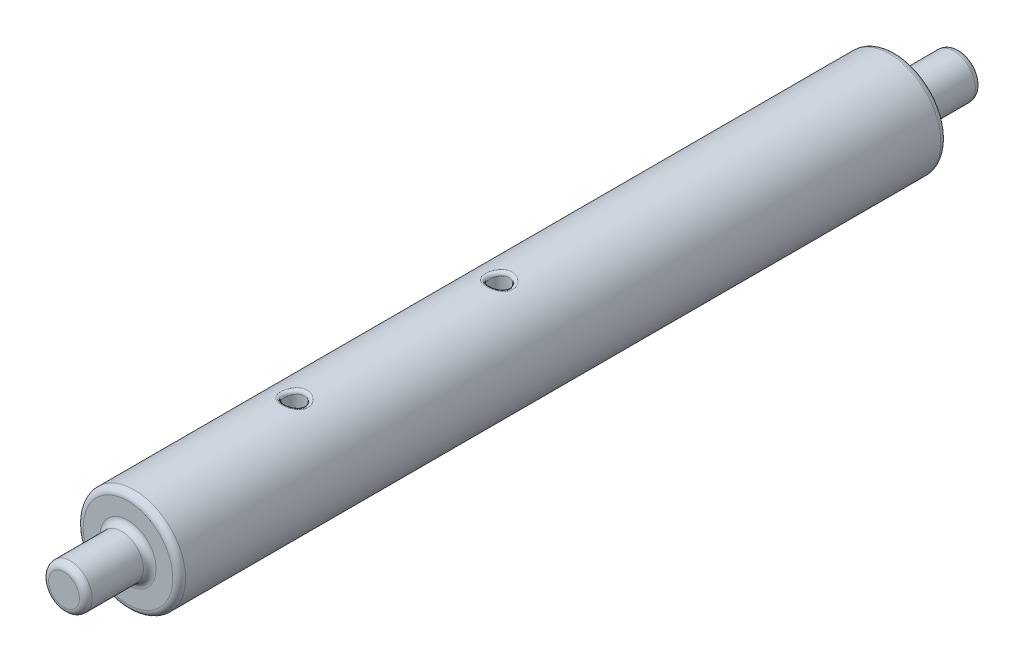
ISO-10303-21;
HEADER;
FILE_DESCRIPTION(('STEP AP214'),'2;1');
FILE_NAME('part.step','',(''),(''),'','','');
FILE_SCHEMA(('AUTOMOTIVE_DESIGN { 1 0 10303 214 1 1 1 1 }'));
ENDSEC;
DATA;
#1=APPLICATION_CONTEXT('core data for automotive mechanical design processes');
#2=APPLICATION_PROTOCOL_DEFINITION('international standard','automotive_design',2000,#1);
#3=PRODUCT_CONTEXT('',#1,'mechanical');
#4=PRODUCT('Part','Part','',(#3));
#5=PRODUCT_RELATED_PRODUCT_CATEGORY('part','',(#4));
#6=PRODUCT_DEFINITION_FORMATION('','',#4);
#7=PRODUCT_DEFINITION_CONTEXT('part definition',#1,'design');
#8=PRODUCT_DEFINITION('design','',#6,#7);
#9=PRODUCT_DEFINITION_SHAPE('','',#8);
#10=(LENGTH_UNIT() NAMED_UNIT(*) SI_UNIT(.MILLI.,.METRE.));
#11=(NAMED_UNIT(*) PLANE_ANGLE_UNIT() SI_UNIT($,.RADIAN.));
#12=(NAMED_UNIT(*) SI_UNIT($,.STERADIAN.) SOLID_ANGLE_UNIT());
#13=UNCERTAINTY_MEASURE_WITH_UNIT(LENGTH_MEASURE(1.E-05),#10,'distance_accuracy_value','');
#14=(GEOMETRIC_REPRESENTATION_CONTEXT(3) GLOBAL_UNCERTAINTY_ASSIGNED_CONTEXT((#13)) GLOBAL_UNIT_ASSIGNED_CONTEXT((#10,
#11,#12)) REPRESENTATION_CONTEXT('',''));
#15=CARTESIAN_POINT('',(0.,0.,0.));
#16=DIRECTION('',(0.,0.,1.));
#17=DIRECTION('',(1.,0.,0.));
#18=AXIS2_PLACEMENT_3D('',#15,#16,#17);
#19=CARTESIAN_POINT('',(0.,1.7,35.));
#20=DIRECTION('',(0.,0.,-1.));
#21=DIRECTION('',(-1.,0.,0.));
#22=AXIS2_PLACEMENT_3D('',#19,#20,#21);
#23=PLANE('',#22);
#24=CARTESIAN_POINT('',(0.,0.,35.));
#25=DIRECTION('',(0.,0.,-1.));
#26=DIRECTION('',(-1.,0.,0.));
#27=AXIS2_PLACEMENT_3D('',#24,#25,#26);
#28=CIRCLE('',#27,1.2);
#29=CARTESIAN_POINT('',(-1.2,0.,35.));
#30=VERTEX_POINT('',#29);
#31=EDGE_CURVE('E119',#30,#30,#28,.F.);
#32=ORIENTED_EDGE('',*,*,#31,.T.);
#33=EDGE_LOOP('',(#32));
#34=FACE_BOUND('',#33,.T.);
#35=ADVANCED_FACE('F29',(#34),#23,.F.);
#36=CARTESIAN_POINT('',(0.,0.,-35.));
#37=DIRECTION('',(0.,0.,1.));
#38=DIRECTION('',(1.,0.,0.));
#39=AXIS2_PLACEMENT_3D('',#36,#37,#38);
#40=PLANE('',#39);
#41=CARTESIAN_POINT('',(0.,0.,-35.));
#42=DIRECTION('',(0.,0.,1.));
#43=DIRECTION('',(1.,0.,0.));
#44=AXIS2_PLACEMENT_3D('',#41,#42,#43);
#45=CIRCLE('',#44,1.2);
#46=CARTESIAN_POINT('',(1.2,0.,-35.));
#47=VERTEX_POINT('',#46);
#48=EDGE_CURVE('E219',#47,#47,#45,.F.);
#49=ORIENTED_EDGE('',*,*,#48,.T.);
#50=EDGE_LOOP('',(#49));
#51=FACE_BOUND('',#50,.T.);
#52=ADVANCED_FACE('F174',(#51),#40,.F.);
#53=CARTESIAN_POINT('',(0.,0.,35.));
#54=DIRECTION('',(0.,0.,1.));
#55=DIRECTION('',(1.,0.,0.));
#56=AXIS2_PLACEMENT_3D('',#53,#54,#55);
#57=CYLINDRICAL_SURFACE('',#56,1.7);
#58=CARTESIAN_POINT('',(0.,0.,-34.5));
#59=DIRECTION('',(0.,0.,1.));
#60=DIRECTION('',(1.,0.,0.));
#61=AXIS2_PLACEMENT_3D('',#58,#59,#60);
#62=CIRCLE('',#61,1.7);
#63=CARTESIAN_POINT('',(1.7,0.,-34.5));
#64=VERTEX_POINT('',#63);
#65=EDGE_CURVE('E224',#64,#64,#62,.T.);
#66=ORIENTED_EDGE('',*,*,#65,.T.);
#67=EDGE_LOOP('',(#66));
#68=FACE_BOUND('',#67,.T.);
#69=CARTESIAN_POINT('',(0.,0.,-30.5));
#70=DIRECTION('',(0.,0.,1.));
#71=DIRECTION('',(1.,0.,0.));
#72=AXIS2_PLACEMENT_3D('',#69,#70,#71);
#73=CIRCLE('',#72,1.7);
#74=CARTESIAN_POINT('',(1.7,0.,-30.5));
#75=VERTEX_POINT('',#74);
#76=EDGE_CURVE('E227',#75,#75,#73,.F.);
#77=ORIENTED_EDGE('',*,*,#76,.T.);
#78=EDGE_LOOP('',(#77));
#79=FACE_BOUND('',#78,.T.);
#80=ADVANCED_FACE('F180',(#68,#79),#57,.T.);
#81=CARTESIAN_POINT('',(0.,1.7,-30.));
#82=DIRECTION('',(0.,0.,1.));
#83=DIRECTION('',(1.,0.,0.));
#84=AXIS2_PLACEMENT_3D('',#81,#82,#83);
#85=PLANE('',#84);
#86=CARTESIAN_POINT('',(0.,0.,-30.));
#87=DIRECTION('',(0.,0.,1.));
#88=DIRECTION('',(1.,0.,0.));
#89=AXIS2_PLACEMENT_3D('',#86,#87,#88);
#90=CIRCLE('',#89,3.49999999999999);
#91=CARTESIAN_POINT('',(3.49999999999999,0.,-30.));
#92=VERTEX_POINT('',#91);
#93=EDGE_CURVE('E234',#92,#92,#90,.F.);
#94=ORIENTED_EDGE('',*,*,#93,.T.);
#95=EDGE_LOOP('',(#94));
#96=FACE_BOUND('',#95,.T.);
#97=CARTESIAN_POINT('',(0.,0.,-30.));
#98=DIRECTION('',(0.,0.,1.));
#99=DIRECTION('',(1.,0.,0.));
#100=AXIS2_PLACEMENT_3D('',#97,#98,#99);
#101=CIRCLE('',#100,2.2);
#102=CARTESIAN_POINT('',(2.2,0.,-30.));
#103=VERTEX_POINT('',#102);
#104=EDGE_CURVE('E237',#103,#103,#101,.T.);
#105=ORIENTED_EDGE('',*,*,#104,.T.);
#106=EDGE_LOOP('',(#105));
#107=FACE_BOUND('',#106,.T.);
#108=ADVANCED_FACE('F257',(#96,#107),#85,.F.);
#109=CARTESIAN_POINT('',(0.,0.,35.));
#110=DIRECTION('',(0.,0.,1.));
#111=DIRECTION('',(1.,0.,0.));
#112=AXIS2_PLACEMENT_3D('',#109,#110,#111);
#113=CYLINDRICAL_SURFACE('',#112,3.99999999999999);
#114=CARTESIAN_POINT('',(-0.195879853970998,-3.74089408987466,1.72396897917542));
#115=CARTESIAN_POINT('',(-0.212404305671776,-3.99490745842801,1.71949805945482));
#116=CARTESIAN_POINT('',(-0.278584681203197,-3.99028702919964,1.96529197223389));
#117=CARTESIAN_POINT('',(-0.155399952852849,-3.74466208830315,1.73492130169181));
#118=CARTESIAN_POINT('',(-0.16905078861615,-3.99697783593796,1.73221507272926));
#119=CARTESIAN_POINT('',(-0.221013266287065,-3.99430622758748,1.97989506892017));
#120=CARTESIAN_POINT('',(-0.113944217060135,-3.74733668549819,1.74248412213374));
#121=CARTESIAN_POINT('',(-0.124016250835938,-3.99849396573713,1.741151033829));
#122=CARTESIAN_POINT('',(-0.162053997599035,-3.99715913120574,1.98997882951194));
#123=CARTESIAN_POINT('',(-0.0303069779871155,-3.75019672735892,1.75056363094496));
#124=CARTESIAN_POINT('',(-0.0331003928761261,-4.00010842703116,1.75065269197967));
#125=CARTESIAN_POINT('',(-0.0431032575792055,-4.00020984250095,2.00075150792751));
#126=CARTESIAN_POINT('',(0.0118743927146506,-3.75038262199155,1.75108159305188));
#127=CARTESIAN_POINT('',(0.0130047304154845,-4.00021509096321,1.75126750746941));
#128=CARTESIAN_POINT('',(0.0168880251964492,-4.00040813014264,2.00144212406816));
#129=CARTESIAN_POINT('',(0.0945300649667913,-3.74827555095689,1.74514011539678));
#130=CARTESIAN_POINT('',(0.102917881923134,-3.99902399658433,1.74427674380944));
#131=CARTESIAN_POINT('',(0.134442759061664,-3.99816058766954,1.99352015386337));
#132=CARTESIAN_POINT('',(0.135019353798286,-3.74605084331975,1.73887280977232));
#133=CARTESIAN_POINT('',(0.146968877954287,-3.99775924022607,1.73686429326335));
#134=CARTESIAN_POINT('',(0.192027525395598,-3.99578756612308,1.98516374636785));
#135=CARTESIAN_POINT('',(0.214398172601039,-3.73946493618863,1.71986205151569));
#136=CARTESIAN_POINT('',(0.232539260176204,-3.99410591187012,1.71465712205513));
#137=CARTESIAN_POINT('',(0.304921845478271,-3.98876259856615,1.95981606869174));
#138=CARTESIAN_POINT('',(0.253285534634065,-3.73510093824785,1.70711011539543));
#139=CARTESIAN_POINT('',(0.27422609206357,-3.99170026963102,1.69975420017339));
#140=CARTESIAN_POINT('',(0.3602283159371,-3.984107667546,1.9428134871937));
#141=CARTESIAN_POINT('',(0.328596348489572,-3.72466236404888,1.67542868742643));
#142=CARTESIAN_POINT('',(0.353862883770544,-3.98614158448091,1.66332123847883));
#143=CARTESIAN_POINT('',(0.46733702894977,-3.97297318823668,1.90057158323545));
#144=CARTESIAN_POINT('',(0.365003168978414,-3.71857742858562,1.65646167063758));
#145=CARTESIAN_POINT('',(0.391888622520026,-3.98296585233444,1.64161265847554));
#146=CARTESIAN_POINT('',(0.519115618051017,-3.96648259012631,1.87528222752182));
#147=CARTESIAN_POINT('',(0.434171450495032,-3.70534126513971,1.61291610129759));
#148=CARTESIAN_POINT('',(0.462828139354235,-3.97636582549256,1.59276725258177));
#149=CARTESIAN_POINT('',(0.617488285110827,-3.95236401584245,1.81722146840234));
#150=CARTESIAN_POINT('',(0.46693215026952,-3.698189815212,1.58833638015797));
#151=CARTESIAN_POINT('',(0.495757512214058,-3.97292950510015,1.56548902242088));
#152=CARTESIAN_POINT('',(0.664081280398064,-3.94473580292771,1.78444850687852));
#153=CARTESIAN_POINT('',(0.528965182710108,-3.68332638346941,1.53335436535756));
#154=CARTESIAN_POINT('',(0.556741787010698,-3.96618264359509,1.50590245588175));
#155=CARTESIAN_POINT('',(0.752306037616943,-3.92888147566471,1.71113915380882));
#156=CARTESIAN_POINT('',(0.558095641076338,-3.67560385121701,1.50279344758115));
#157=CARTESIAN_POINT('',(0.584524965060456,-3.96288155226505,1.47337146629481));
#158=CARTESIAN_POINT('',(0.793736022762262,-3.92064410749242,1.67039126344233));
#159=CARTESIAN_POINT('',(0.610818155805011,-3.66067016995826,1.43722811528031));
#160=CARTESIAN_POINT('',(0.633506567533,-3.95693163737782,1.40551176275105));
#161=CARTESIAN_POINT('',(0.868719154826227,-3.90471484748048,1.58297082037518));
#162=CARTESIAN_POINT('',(0.634417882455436,-3.65345832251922,1.40222995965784));
#163=CARTESIAN_POINT('',(0.654578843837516,-3.95429573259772,1.37016360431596));
#164=CARTESIAN_POINT('',(0.902283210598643,-3.89702221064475,1.53630661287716));
#165=CARTESIAN_POINT('',(0.675678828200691,-3.64028593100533,1.32828135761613));
#166=CARTESIAN_POINT('',(0.690479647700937,-3.94983394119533,1.29758150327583));
#167=CARTESIAN_POINT('',(0.960965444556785,-3.88297165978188,1.43770847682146));
#168=CARTESIAN_POINT('',(0.693276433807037,-3.63433902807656,1.28929394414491));
#169=CARTESIAN_POINT('',(0.705077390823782,-3.94803765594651,1.26042231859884));
#170=CARTESIAN_POINT('',(0.985993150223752,-3.8766282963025,1.38572525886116));
#171=CARTESIAN_POINT('',(0.721621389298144,-3.62451783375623,1.20876644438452));
#172=CARTESIAN_POINT('',(0.72814361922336,-3.94526174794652,1.18552689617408));
#173=CARTESIAN_POINT('',(1.02630597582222,-3.86615235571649,1.2783552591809));
#174=CARTESIAN_POINT('',(0.732370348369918,-3.62064305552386,1.16722696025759));
#175=CARTESIAN_POINT('',(0.736477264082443,-3.94429932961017,1.14797532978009));
#176=CARTESIAN_POINT('',(1.04159338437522,-3.86201925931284,1.22296928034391));
#177=CARTESIAN_POINT('',(0.746437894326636,-3.61553164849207,1.08402515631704));
#178=CARTESIAN_POINT('',(0.747345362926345,-3.94306175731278,1.07372827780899));
#179=CARTESIAN_POINT('',(1.06160056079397,-3.85656709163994,1.11203354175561));
#180=CARTESIAN_POINT('',(0.749957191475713,-3.61422380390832,1.04239923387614));
#181=CARTESIAN_POINT('',(0.749967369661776,-3.94277605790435,1.03726417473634));
#182=CARTESIAN_POINT('',(1.0666057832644,-3.85517205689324,1.05653231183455));
#183=CARTESIAN_POINT('',(0.750042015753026,-3.61419263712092,0.95914298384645));
#184=CARTESIAN_POINT('',(0.75003203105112,-3.94276889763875,0.964089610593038));
#185=CARTESIAN_POINT('',(1.06672642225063,-3.85513881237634,0.945523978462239));
#186=CARTESIAN_POINT('',(0.746608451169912,-3.61546897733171,0.917512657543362));
#187=CARTESIAN_POINT('',(0.747474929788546,-3.94304741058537,0.927627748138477));
#188=CARTESIAN_POINT('',(1.0618431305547,-3.85650024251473,0.890016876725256));
#189=CARTESIAN_POINT('',(0.733071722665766,-3.62038885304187,0.836423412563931));
#190=CARTESIAN_POINT('',(0.737018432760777,-3.94423737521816,0.855282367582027));
#191=CARTESIAN_POINT('',(1.04259089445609,-3.86174810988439,0.781897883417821));
#192=CARTESIAN_POINT('',(0.723123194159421,-3.62397747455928,0.796936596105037));
#193=CARTESIAN_POINT('',(0.729307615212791,-3.94512664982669,0.819626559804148));
#194=CARTESIAN_POINT('',(1.02844187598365,-3.86557597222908,0.729248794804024));
#195=CARTESIAN_POINT('',(0.69701026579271,-3.63306152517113,0.720133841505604));
#196=CARTESIAN_POINT('',(0.708142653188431,-3.94766499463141,0.748418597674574));
#197=CARTESIAN_POINT('',(0.991303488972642,-3.87526562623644,0.626845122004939));
#198=CARTESIAN_POINT('',(0.680834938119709,-3.63856030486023,0.68282185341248));
#199=CARTESIAN_POINT('',(0.694792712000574,-3.94930088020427,0.713028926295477));
#200=CARTESIAN_POINT('',(0.968298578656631,-3.88113099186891,0.577095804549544));
#201=CARTESIAN_POINT('',(0.64239529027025,-3.65096787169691,0.61073471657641));
#202=CARTESIAN_POINT('',(0.66161043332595,-3.95341987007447,0.642725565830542));
#203=CARTESIAN_POINT('',(0.913628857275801,-3.8943657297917,0.480979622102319));
#204=CARTESIAN_POINT('',(0.620024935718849,-3.65790062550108,0.576018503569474));
#205=CARTESIAN_POINT('',(0.64180466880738,-3.95589980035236,0.607909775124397));
#206=CARTESIAN_POINT('',(0.881813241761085,-3.90176066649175,0.434691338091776));
#207=CARTESIAN_POINT('',(0.569941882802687,-3.67235375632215,0.510757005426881));
#208=CARTESIAN_POINT('',(0.595666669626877,-3.96154309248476,0.540825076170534));
#209=CARTESIAN_POINT('',(0.810584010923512,-3.91717733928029,0.347676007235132));
#210=CARTESIAN_POINT('',(0.542228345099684,-3.67987422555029,0.480212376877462));
#211=CARTESIAN_POINT('',(0.569465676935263,-3.96469230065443,0.50854796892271));
#212=CARTESIAN_POINT('',(0.771169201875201,-3.92519917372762,0.306949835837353));
#213=CARTESIAN_POINT('',(0.481235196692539,-3.69493553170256,0.423191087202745));
#214=CARTESIAN_POINT('',(0.510014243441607,-3.97140268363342,0.447185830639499));
#215=CARTESIAN_POINT('',(0.684423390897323,-3.941264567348,0.230921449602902));
#216=CARTESIAN_POINT('',(0.447810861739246,-3.702469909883,0.39686804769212));
#217=CARTESIAN_POINT('',(0.476640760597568,-3.97497256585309,0.418115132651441));
#218=CARTESIAN_POINT('',(0.636886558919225,-3.94930123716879,0.19582406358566));
#219=CARTESIAN_POINT('',(0.376917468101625,-3.7164785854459,0.350206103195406));
#220=CARTESIAN_POINT('',(0.404265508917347,-3.98188754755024,0.365971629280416));
#221=CARTESIAN_POINT('',(0.536060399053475,-3.96424382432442,0.133608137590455));
#222=CARTESIAN_POINT('',(0.339450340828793,-3.72295338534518,0.329864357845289));
#223=CARTESIAN_POINT('',(0.36526009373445,-3.9852446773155,0.342742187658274));
#224=CARTESIAN_POINT('',(0.48277381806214,-3.97115027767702,0.106485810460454));
#225=CARTESIAN_POINT('',(0.2666661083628,-3.73338166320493,0.298037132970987));
#226=CARTESIAN_POINT('',(0.288408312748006,-3.99077642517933,0.306177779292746));
#227=CARTESIAN_POINT('',(0.379258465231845,-3.98227377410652,0.0640495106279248));
#228=CARTESIAN_POINT('',(0.231721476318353,-3.73755549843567,0.285735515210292));
#229=CARTESIAN_POINT('',(0.251068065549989,-3.99305951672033,0.291851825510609));
#230=CARTESIAN_POINT('',(0.329559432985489,-3.98672586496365,0.0476473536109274));
#231=CARTESIAN_POINT('',(0.160318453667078,-3.7442065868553,0.266402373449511));
#232=CARTESIAN_POINT('',(0.17430121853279,-3.99672860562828,0.269316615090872));
#233=CARTESIAN_POINT('',(0.228008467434,-3.99382035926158,0.0218698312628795));
#234=CARTESIAN_POINT('',(0.12386034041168,-3.7466841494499,0.259369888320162));
#235=CARTESIAN_POINT('',(0.134755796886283,-3.99812715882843,0.261026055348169));
#236=CARTESIAN_POINT('',(0.176156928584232,-3.99646309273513,0.0124931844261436));
#237=CARTESIAN_POINT('',(0.0462959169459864,-3.74988536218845,0.250307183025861));
#238=CARTESIAN_POINT('',(0.0505181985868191,-3.99993065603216,0.250377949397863));
#239=CARTESIAN_POINT('',(0.0658430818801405,-3.99987771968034,0.00040957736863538));
#240=CARTESIAN_POINT('',(0.00511071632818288,-3.75039221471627,0.248894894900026));
#241=CARTESIAN_POINT('',(0.0055187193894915,-4.0002215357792,0.248701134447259));
#242=CARTESIAN_POINT('',(0.00726857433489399,-4.00041836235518,-0.00147347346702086));
#243=CARTESIAN_POINT('',(-0.0769211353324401,-3.7489965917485,0.252825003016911));
#244=CARTESIAN_POINT('',(-0.0837638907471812,-3.99943171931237,0.253327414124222));
#245=CARTESIAN_POINT('',(-0.109398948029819,-3.998929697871,0.00376667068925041));
#246=CARTESIAN_POINT('',(-0.117767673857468,-3.74709334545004,0.258169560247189));
#247=CARTESIAN_POINT('',(-0.128261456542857,-3.99834675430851,0.259655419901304));
#248=CARTESIAN_POINT('',(-0.167491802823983,-3.99689956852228,0.0108927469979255));
#249=CARTESIAN_POINT('',(-0.197886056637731,-3.74108848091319,0.27541892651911));
#250=CARTESIAN_POINT('',(-0.214790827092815,-3.99500262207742,0.279835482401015));
#251=CARTESIAN_POINT('',(-0.28143794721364,-3.99049437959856,0.0338919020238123));
#252=CARTESIAN_POINT('',(-0.237160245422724,-3.73699027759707,0.287313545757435));
#253=CARTESIAN_POINT('',(-0.257007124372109,-3.99273056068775,0.293767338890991));
#254=CARTESIAN_POINT('',(-0.337294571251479,-3.98612296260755,0.0497513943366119));
#255=CARTESIAN_POINT('',(-0.313191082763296,-3.72702573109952,0.317296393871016));
#256=CARTESIAN_POINT('',(-0.337670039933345,-3.98738685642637,0.328339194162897));
#257=CARTESIAN_POINT('',(-0.445427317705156,-3.97549411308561,0.0897285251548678));
#258=CARTESIAN_POINT('',(-0.349944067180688,-3.72115687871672,0.335393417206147));
#259=CARTESIAN_POINT('',(-0.376224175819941,-3.98429564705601,0.349123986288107));
#260=CARTESIAN_POINT('',(-0.497698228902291,-3.96923400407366,0.11385788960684));
#261=CARTESIAN_POINT('',(-0.420469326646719,-3.70816503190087,0.377569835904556));
#262=CARTESIAN_POINT('',(-0.448923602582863,-3.97774649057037,0.396630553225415));
#263=CARTESIAN_POINT('',(-0.598000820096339,-3.95537603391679,0.170093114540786));
#264=CARTESIAN_POINT('',(-0.454187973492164,-3.70102437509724,0.401735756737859));
#265=CARTESIAN_POINT('',(-0.483015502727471,-3.97427061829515,0.423579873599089));
#266=CARTESIAN_POINT('',(-0.645956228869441,-3.94775933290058,0.202314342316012));
#267=CARTESIAN_POINT('',(-0.517163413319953,-3.68630429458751,0.455252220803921));
#268=CARTESIAN_POINT('',(-0.545291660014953,-3.96749775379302,0.481853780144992));
#269=CARTESIAN_POINT('',(-0.735521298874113,-3.93205791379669,0.27366962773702));
#270=CARTESIAN_POINT('',(-0.546419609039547,-3.67872481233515,0.484603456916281));
#271=CARTESIAN_POINT('',(-0.573417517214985,-3.96419935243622,0.513289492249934));
#272=CARTESIAN_POINT('',(-0.777130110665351,-3.9239731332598,0.312804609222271));
#273=CARTESIAN_POINT('',(-0.600476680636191,-3.66372462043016,0.548633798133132));
#274=CARTESIAN_POINT('',(-0.624088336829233,-3.95809766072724,0.580044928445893));
#275=CARTESIAN_POINT('',(-0.854011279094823,-3.90797292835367,0.398178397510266));
#276=CARTESIAN_POINT('',(-0.625130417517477,-3.65631424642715,0.583438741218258));
#277=CARTESIAN_POINT('',(-0.646311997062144,-3.95532474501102,0.615469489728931));
#278=CARTESIAN_POINT('',(-0.889074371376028,-3.90006852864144,0.444584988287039));
#279=CARTESIAN_POINT('',(-0.668205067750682,-3.6427460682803,0.656769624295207));
#280=CARTESIAN_POINT('',(-0.684124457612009,-3.95062263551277,0.687959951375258));
#281=CARTESIAN_POINT('',(-0.950336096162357,-3.88559580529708,0.542359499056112));
#282=CARTESIAN_POINT('',(-0.686635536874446,-3.63658634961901,0.695289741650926));
#283=CARTESIAN_POINT('',(-0.699562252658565,-3.94871250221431,0.724953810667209));
#284=CARTESIAN_POINT('',(-0.976548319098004,-3.8790254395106,0.593719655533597));
#285=CARTESIAN_POINT('',(-0.716613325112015,-3.626289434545,0.774717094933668));
#286=CARTESIAN_POINT('',(-0.724158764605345,-3.94573322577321,0.799316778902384));
#287=CARTESIAN_POINT('',(-1.01918339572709,-3.86804206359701,0.699622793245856));
#288=CARTESIAN_POINT('',(-0.728214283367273,-3.62213652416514,0.815602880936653));
#289=CARTESIAN_POINT('',(-0.733228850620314,-3.9446752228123,0.836515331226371));
#290=CARTESIAN_POINT('',(-1.03568253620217,-3.86361229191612,0.754137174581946));
#291=CARTESIAN_POINT('',(-0.744353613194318,-3.61630023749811,0.898838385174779));
#292=CARTESIAN_POINT('',(-0.745771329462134,-3.9432364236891,0.911133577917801));
#293=CARTESIAN_POINT('',(-1.05863624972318,-3.85738691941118,0.86511784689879));
#294=CARTESIAN_POINT('',(-0.748893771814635,-3.61461623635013,0.941187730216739));
#295=CARTESIAN_POINT('',(-0.749162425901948,-3.94286521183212,0.948316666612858));
#296=CARTESIAN_POINT('',(-1.06509336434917,-3.85559065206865,0.921583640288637));
#297=CARTESIAN_POINT('',(-0.75071802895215,-3.6139431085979,1.02466045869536));
#298=CARTESIAN_POINT('',(-0.750544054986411,-3.94271217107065,1.02170051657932));
#299=CARTESIAN_POINT('',(-1.06768786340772,-3.854872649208,1.03288061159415));
#300=CARTESIAN_POINT('',(-0.748235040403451,-3.61486747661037,1.06577853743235));
#301=CARTESIAN_POINT('',(-0.748698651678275,-3.94291244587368,1.05765242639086));
#302=CARTESIAN_POINT('',(-1.06415650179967,-3.85585864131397,1.08770471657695));
#303=CARTESIAN_POINT('',(-0.736598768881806,-3.61911327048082,1.14698555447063));
#304=CARTESIAN_POINT('',(-0.739754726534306,-3.94392371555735,1.12982445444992));
#305=CARTESIAN_POINT('',(-1.04760713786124,-3.86038748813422,1.19598073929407));
#306=CARTESIAN_POINT('',(-0.72744553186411,-3.62243467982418,1.18707449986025));
#307=CARTESIAN_POINT('',(-0.732712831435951,-3.94472821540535,1.16581975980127));
#308=CARTESIAN_POINT('',(-1.03458920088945,-3.86393032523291,1.2494326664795));
#309=CARTESIAN_POINT('',(-0.702842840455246,-3.6310579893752,1.26489365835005));
#310=CARTESIAN_POINT('',(-0.712921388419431,-3.94708581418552,1.23753530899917));
#311=CARTESIAN_POINT('',(-0.999598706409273,-3.87312852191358,1.35319154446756));
#312=CARTESIAN_POINT('',(-0.687428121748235,-3.63634895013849,1.30263558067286));
#313=CARTESIAN_POINT('',(-0.700313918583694,-3.94862087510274,1.27308040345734));
#314=CARTESIAN_POINT('',(-0.977675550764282,-3.87877221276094,1.40351410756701));
#315=CARTESIAN_POINT('',(-0.650740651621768,-3.64832956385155,1.37508437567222));
#316=CARTESIAN_POINT('',(-0.668909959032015,-3.9525103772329,1.34326039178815));
#317=CARTESIAN_POINT('',(-0.925497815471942,-3.89155153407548,1.5001125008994));
#318=CARTESIAN_POINT('',(-0.629459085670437,-3.65502131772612,1.40978657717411));
#319=CARTESIAN_POINT('',(-0.650242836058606,-3.95484810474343,1.37779896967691));
#320=CARTESIAN_POINT('',(-0.895230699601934,-3.89868940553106,1.54638210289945));
#321=CARTESIAN_POINT('',(-0.580899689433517,-3.66929520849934,1.47623436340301));
#322=CARTESIAN_POINT('',(-0.605914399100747,-3.96030214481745,1.44559722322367));
#323=CARTESIAN_POINT('',(-0.826168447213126,-3.91391488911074,1.63497915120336));
#324=CARTESIAN_POINT('',(-0.553461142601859,-3.6768980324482,1.5078600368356));
#325=CARTESIAN_POINT('',(-0.580189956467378,-3.96342517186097,1.47879962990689));
#326=CARTESIAN_POINT('',(-0.787144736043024,-3.92202456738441,1.67714671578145));
#327=CARTESIAN_POINT('',(-0.493705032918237,-3.69199369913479,1.56612460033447));
#328=CARTESIAN_POINT('',(-0.522314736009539,-3.97005164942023,1.54117764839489));
#329=CARTESIAN_POINT('',(-0.70215826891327,-3.93812661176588,1.75483280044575));
#330=CARTESIAN_POINT('',(-0.461387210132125,-3.69948653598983,1.59276322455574));
#331=CARTESIAN_POINT('',(-0.490254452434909,-3.97355067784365,1.57043878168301));
#332=CARTESIAN_POINT('',(-0.656195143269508,-3.94611897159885,1.79035096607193));
#333=CARTESIAN_POINT('',(-0.392014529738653,-3.71369462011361,1.64081130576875));
#334=CARTESIAN_POINT('',(-0.419839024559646,-3.98047785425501,1.62387937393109));
#335=CARTESIAN_POINT('',(-0.557531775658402,-3.96127426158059,1.85441507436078));
#336=CARTESIAN_POINT('',(-0.354879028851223,-3.72039168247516,1.66210765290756));
#337=CARTESIAN_POINT('',(-0.381369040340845,-3.98391445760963,1.64810538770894));
#338=CARTESIAN_POINT('',(-0.504716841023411,-3.96841779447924,1.88281020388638));
#339=CARTESIAN_POINT('',(-0.277457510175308,-3.73206807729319,1.69809472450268));
#340=CARTESIAN_POINT('',(-0.299981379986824,-3.99005442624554,1.68929081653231));
#341=CARTESIAN_POINT('',(-0.394606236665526,-3.98087261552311,1.93079296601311));
#342=CARTESIAN_POINT('',(-0.237176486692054,-3.73705006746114,1.71279568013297));
#343=CARTESIAN_POINT('',(-0.256975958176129,-3.99277890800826,1.70642372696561));
#344=CARTESIAN_POINT('',(-0.337317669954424,-3.98618673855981,1.95039424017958));
#345=CARTESIAN_POINT('',(-0.195879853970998,-3.74089408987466,1.72396897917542));
#346=CARTESIAN_POINT('',(-0.212404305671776,-3.99490745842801,1.71949805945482));
#347=CARTESIAN_POINT('',(-0.278584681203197,-3.99028702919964,1.96529197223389));
#348=(BOUNDED_SURFACE() B_SPLINE_SURFACE(3,2,((#114,#115,#116),(#117,#118,#119),(#120,#121,
#122),(#123,#124,#125),(#126,#127,#128),(#129,#130,#131),(#132,#133,#134),(#135,#136,#137),
(#138,#139,#140),(#141,#142,#143),(#144,#145,#146),(#147,#148,#149),(#150,#151,#152),(#153,#154,
#155),(#156,#157,#158),(#159,#160,#161),(#162,#163,#164),(#165,#166,#167),(#168,#169,#170),
(#171,#172,#173),(#174,#175,#176),(#177,#178,#179),(#180,#181,#182),(#183,#184,#185),(#186,#187,
#188),(#189,#190,#191),(#192,#193,#194),(#195,#196,#197),(#198,#199,#200),(#201,#202,#203),
(#204,#205,#206),(#207,#208,#209),(#210,#211,#212),(#213,#214,#215),(#216,#217,#218),(#219,#220,
#221),(#222,#223,#224),(#225,#226,#227),(#228,#229,#230),(#231,#232,#233),(#234,#235,#236),
(#237,#238,#239),(#240,#241,#242),(#243,#244,#245),(#246,#247,#248),(#249,#250,#251),(#252,#253,
#254),(#255,#256,#257),(#258,#259,#260),(#261,#262,#263),(#264,#265,#266),(#267,#268,#269),
(#270,#271,#272),(#273,#274,#275),(#276,#277,#278),(#279,#280,#281),(#282,#283,#284),(#285,#286,
#287),(#288,#289,#290),(#291,#292,#293),(#294,#295,#296),(#297,#298,#299),(#300,#301,#302),
(#303,#304,#305),(#306,#307,#308),(#309,#310,#311),(#312,#313,#314),(#315,#316,#317),(#318,#319,
#320),(#321,#322,#323),(#324,#325,#326),(#327,#328,#329),(#330,#331,#332),(#333,#334,#335),
(#336,#337,#338),(#339,#340,#341),(#342,#343,#344),(#345,#346,#347)),.UNSPECIFIED.,.T.,.F.,
.F.) B_SPLINE_SURFACE_WITH_KNOTS((4,2,2,2,2,2,2,2,2,2,2,2,2,2,2,2,2,2,2,2,2,2,2,2,2,2,2,2,2,2,2,
2,2,2,2,2,2,2,4),(3,3),(0.,0.167913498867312,0.335796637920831,0.499047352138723,
0.662512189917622,0.826982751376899,0.991487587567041,1.16115902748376,1.33059374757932,
1.50177214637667,1.67291030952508,1.83922935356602,2.00552667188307,2.1680133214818,
2.33078643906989,2.49653897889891,2.66231757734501,2.83318410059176,3.00396935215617,
3.15213502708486,3.30027366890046,3.46431263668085,3.62840408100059,3.79224096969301,
3.95631113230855,4.12286835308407,4.28944784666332,4.46067661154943,4.63164124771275,
4.80124456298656,4.97080494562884,5.13480865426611,5.29881123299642,5.46191616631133,
5.6252675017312,5.79351875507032,5.96177897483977,6.13334740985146,6.30464876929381),(0.,1.),
.UNSPECIFIED.) GEOMETRIC_REPRESENTATION_ITEM() RATIONAL_B_SPLINE_SURFACE(((1.,0.700646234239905,
1.),(1.,0.703328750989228,1.),(1.,0.705222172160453,1.),(1.,0.707246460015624,1.),(1.,
0.707377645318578,1.),(1.,0.705886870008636,1.),(1.,0.7043131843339,1.),(1.,0.699631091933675,
1.),(1.,0.696520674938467,1.),(1.,0.689027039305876,1.),(1.,0.68463610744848,1.),(1.,
0.674999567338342,1.),(1.,0.669753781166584,1.),(1.,0.658743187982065,1.),(1.,0.652967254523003,
1.),(1.,0.641684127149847,1.),(1.,0.636176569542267,1.),(1.,0.626028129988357,1.),(1.,
0.62139675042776,1.),(1.,0.613701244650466,1.),(1.,0.610636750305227,1.),(1.,0.606585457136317,
1.),(1.,0.605542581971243,1.),(1.,0.605517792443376,1.),(1.,0.60653560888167,1.),(1.,
0.610435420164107,1.),(1.,0.613274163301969,1.),(1.,0.620398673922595,1.),(1.,0.624686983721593,
1.),(1.,0.634266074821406,1.),(1.,0.639573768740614,1.),(1.,0.65052334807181,1.),(1.,
0.656165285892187,1.),(1.,0.667356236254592,1.),(1.,0.672897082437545,1.),(1.,0.683116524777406,
1.),(1.,0.687795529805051,1.),(1.,0.695289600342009,1.),(1.,0.698269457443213,1.),(1.,
0.703004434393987,1.),(1.,0.704759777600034,1.),(1.,0.707026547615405,1.),(1.,0.707384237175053,
1.),(1.,0.706397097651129,1.),(1.,0.705051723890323,1.),(1.,0.700786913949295,1.),(1.,
0.697869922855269,1.),(1.,0.690728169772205,1.),(1.,0.686501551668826,1.),(1.,0.677063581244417,
1.),(1.,0.671838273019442,1.),(1.,0.660959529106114,1.),(1.,0.655306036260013,1.),(1.,
0.644004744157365,1.),(1.,0.63836150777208,1.),(1.,0.627933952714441,1.),(1.,0.623148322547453,
1.),(1.,0.615095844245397,1.),(1.,0.611817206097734,1.),(1.,0.607196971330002,1.),(1.,
0.605854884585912,1.),(1.,0.605319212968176,1.),(1.,0.606056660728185,1.),(1.,0.609425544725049,
1.),(1.,0.612056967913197,1.),(1.,0.618831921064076,1.),(1.,0.622967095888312,1.),(1.,
0.632237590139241,1.),(1.,0.637374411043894,1.),(1.,0.64821819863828,1.),(1.,0.653937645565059,
1.),(1.,0.665181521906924,1.),(1.,0.670705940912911,1.),(1.,0.681095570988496,1.),(1.,
0.685945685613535,1.),(1.,0.694351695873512,1.),(1.,0.697909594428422,1.),(1.,0.700646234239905,1.))) REPRESENTATION_ITEM('') SURFACE());
#349=CARTESIAN_POINT('',(-0.278584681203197,-3.99028702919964,1.96529197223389));
#350=CARTESIAN_POINT('',(-0.221013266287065,-3.99430622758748,1.97989506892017));
#351=CARTESIAN_POINT('',(-0.162053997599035,-3.99715913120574,1.98997882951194));
#352=CARTESIAN_POINT('',(-0.0431032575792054,-4.00020984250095,2.00075150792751));
#353=CARTESIAN_POINT('',(0.0168880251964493,-4.00040813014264,2.00144212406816));
#354=CARTESIAN_POINT('',(0.134442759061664,-3.99816058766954,1.99352015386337));
#355=CARTESIAN_POINT('',(0.192027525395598,-3.99578756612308,1.98516374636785));
#356=CARTESIAN_POINT('',(0.304921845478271,-3.98876259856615,1.95981606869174));
#357=CARTESIAN_POINT('',(0.3602283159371,-3.984107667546,1.9428134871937));
#358=CARTESIAN_POINT('',(0.46733702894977,-3.97297318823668,1.90057158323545));
#359=CARTESIAN_POINT('',(0.519115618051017,-3.96648259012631,1.87528222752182));
#360=CARTESIAN_POINT('',(0.617488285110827,-3.95236401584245,1.81722146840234));
#361=CARTESIAN_POINT('',(0.664081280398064,-3.94473580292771,1.78444850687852));
#362=CARTESIAN_POINT('',(0.752306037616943,-3.92888147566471,1.71113915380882));
#363=CARTESIAN_POINT('',(0.793736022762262,-3.92064410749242,1.67039126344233));
#364=CARTESIAN_POINT('',(0.868719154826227,-3.90471484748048,1.58297082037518));
#365=CARTESIAN_POINT('',(0.902283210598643,-3.89702221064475,1.53630661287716));
#366=CARTESIAN_POINT('',(0.960965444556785,-3.88297165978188,1.43770847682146));
#367=CARTESIAN_POINT('',(0.985993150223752,-3.8766282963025,1.38572525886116));
#368=CARTESIAN_POINT('',(1.02630597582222,-3.86615235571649,1.2783552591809));
#369=CARTESIAN_POINT('',(1.04159338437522,-3.86201925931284,1.22296928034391));
#370=CARTESIAN_POINT('',(1.06160056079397,-3.85656709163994,1.11203354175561));
#371=CARTESIAN_POINT('',(1.0666057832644,-3.85517205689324,1.05653231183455));
#372=CARTESIAN_POINT('',(1.06672642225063,-3.85513881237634,0.945523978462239));
#373=CARTESIAN_POINT('',(1.0618431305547,-3.85650024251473,0.890016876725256));
#374=CARTESIAN_POINT('',(1.04259089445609,-3.86174810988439,0.781897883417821));
#375=CARTESIAN_POINT('',(1.02844187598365,-3.86557597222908,0.729248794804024));
#376=CARTESIAN_POINT('',(0.991303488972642,-3.87526562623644,0.626845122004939));
#377=CARTESIAN_POINT('',(0.968298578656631,-3.88113099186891,0.577095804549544));
#378=CARTESIAN_POINT('',(0.913628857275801,-3.8943657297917,0.480979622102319));
#379=CARTESIAN_POINT('',(0.881813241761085,-3.90176066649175,0.434691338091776));
#380=CARTESIAN_POINT('',(0.810584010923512,-3.91717733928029,0.347676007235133));
#381=CARTESIAN_POINT('',(0.771169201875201,-3.92519917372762,0.306949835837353));
#382=CARTESIAN_POINT('',(0.684423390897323,-3.941264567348,0.230921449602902));
#383=CARTESIAN_POINT('',(0.636886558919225,-3.94930123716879,0.19582406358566));
#384=CARTESIAN_POINT('',(0.536060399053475,-3.96424382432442,0.133608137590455));
#385=CARTESIAN_POINT('',(0.48277381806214,-3.97115027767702,0.106485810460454));
#386=CARTESIAN_POINT('',(0.379258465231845,-3.98227377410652,0.0640495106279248));
#387=CARTESIAN_POINT('',(0.329559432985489,-3.98672586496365,0.0476473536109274));
#388=CARTESIAN_POINT('',(0.228008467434,-3.99382035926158,0.0218698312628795));
#389=CARTESIAN_POINT('',(0.176156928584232,-3.99646309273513,0.0124931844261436));
#390=CARTESIAN_POINT('',(0.0658430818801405,-3.99987771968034,0.000409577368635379));
#391=CARTESIAN_POINT('',(0.00726857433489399,-4.00041836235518,-0.00147347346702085));
#392=CARTESIAN_POINT('',(-0.109398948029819,-3.998929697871,0.0037666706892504));
#393=CARTESIAN_POINT('',(-0.167491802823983,-3.99689956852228,0.0108927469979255));
#394=CARTESIAN_POINT('',(-0.28143794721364,-3.99049437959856,0.0338919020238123));
#395=CARTESIAN_POINT('',(-0.337294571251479,-3.98612296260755,0.0497513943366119));
#396=CARTESIAN_POINT('',(-0.445427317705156,-3.97549411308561,0.0897285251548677));
#397=CARTESIAN_POINT('',(-0.49769822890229,-3.96923400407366,0.11385788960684));
#398=CARTESIAN_POINT('',(-0.598000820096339,-3.95537603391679,0.170093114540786));
#399=CARTESIAN_POINT('',(-0.645956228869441,-3.94775933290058,0.202314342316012));
#400=CARTESIAN_POINT('',(-0.735521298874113,-3.93205791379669,0.27366962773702));
#401=CARTESIAN_POINT('',(-0.777130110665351,-3.92397313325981,0.312804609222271));
#402=CARTESIAN_POINT('',(-0.854011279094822,-3.90797292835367,0.398178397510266));
#403=CARTESIAN_POINT('',(-0.889074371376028,-3.90006852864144,0.444584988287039));
#404=CARTESIAN_POINT('',(-0.950336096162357,-3.88559580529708,0.542359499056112));
#405=CARTESIAN_POINT('',(-0.976548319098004,-3.8790254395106,0.593719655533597));
#406=CARTESIAN_POINT('',(-1.01918339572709,-3.86804206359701,0.699622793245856));
#407=CARTESIAN_POINT('',(-1.03568253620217,-3.86361229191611,0.754137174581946));
#408=CARTESIAN_POINT('',(-1.05863624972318,-3.85738691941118,0.86511784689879));
#409=CARTESIAN_POINT('',(-1.06509336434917,-3.85559065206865,0.921583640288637));
#410=CARTESIAN_POINT('',(-1.06768786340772,-3.854872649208,1.03288061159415));
#411=CARTESIAN_POINT('',(-1.06415650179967,-3.85585864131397,1.08770471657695));
#412=CARTESIAN_POINT('',(-1.04760713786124,-3.86038748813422,1.19598073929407));
#413=CARTESIAN_POINT('',(-1.03458920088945,-3.86393032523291,1.2494326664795));
#414=CARTESIAN_POINT('',(-0.999598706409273,-3.87312852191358,1.35319154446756));
#415=CARTESIAN_POINT('',(-0.977675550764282,-3.87877221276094,1.40351410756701));
#416=CARTESIAN_POINT('',(-0.925497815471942,-3.89155153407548,1.5001125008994));
#417=CARTESIAN_POINT('',(-0.895230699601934,-3.89868940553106,1.54638210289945));
#418=CARTESIAN_POINT('',(-0.826168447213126,-3.91391488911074,1.63497915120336));
#419=CARTESIAN_POINT('',(-0.787144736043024,-3.92202456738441,1.67714671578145));
#420=CARTESIAN_POINT('',(-0.70215826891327,-3.93812661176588,1.75483280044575));
#421=CARTESIAN_POINT('',(-0.656195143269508,-3.94611897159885,1.79035096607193));
#422=CARTESIAN_POINT('',(-0.557531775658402,-3.96127426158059,1.85441507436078));
#423=CARTESIAN_POINT('',(-0.504716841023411,-3.96841779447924,1.88281020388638));
#424=CARTESIAN_POINT('',(-0.394606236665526,-3.98087261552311,1.93079296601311));
#425=CARTESIAN_POINT('',(-0.337317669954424,-3.98618673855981,1.95039424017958));
#426=CARTESIAN_POINT('',(-0.278584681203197,-3.99028702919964,1.96529197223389));
#427=B_SPLINE_CURVE_WITH_KNOTS('',3,(#349,#350,#351,#352,#353,#354,#355,#356,#357,#358,#359,
#360,#361,#362,#363,#364,#365,#366,#367,#368,#369,#370,#371,#372,#373,#374,#375,#376,#377,#378,
#379,#380,#381,#382,#383,#384,#385,#386,#387,#388,#389,#390,#391,#392,#393,#394,#395,#396,#397,
#398,#399,#400,#401,#402,#403,#404,#405,#406,#407,#408,#409,#410,#411,#412,#413,#414,#415,#416,
#417,#418,#419,#420,#421,#422,#423,#424,#425,#426),.UNSPECIFIED.,.T.,.F.,(4,2,2,2,2,2,2,2,2,2,2,
2,2,2,2,2,2,2,2,2,2,2,2,2,2,2,2,2,2,2,2,2,2,2,2,2,2,2,4),(0.,0.167913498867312,
0.335796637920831,0.499047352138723,0.662512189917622,0.826982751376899,0.991487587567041,
1.16115902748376,1.33059374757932,1.50177214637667,1.67291030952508,1.83922935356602,
2.00552667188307,2.1680133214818,2.33078643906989,2.49653897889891,2.66231757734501,
2.83318410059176,3.00396935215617,3.15213502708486,3.30027366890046,3.46431263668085,
3.62840408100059,3.79224096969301,3.95631113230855,4.12286835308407,4.28944784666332,
4.46067661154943,4.63164124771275,4.80124456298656,4.97080494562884,5.13480865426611,
5.29881123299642,5.46191616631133,5.6252675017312,5.79351875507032,5.96177897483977,
6.13334740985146,6.30464876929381),.UNSPECIFIED.);
#428=CARTESIAN_POINT('',(-0.278584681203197,-3.99028702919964,1.96529197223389));
#429=VERTEX_POINT('',#428);
#430=EDGE_CURVE('E130',#429,#429,#427,.T.);
#431=ORIENTED_EDGE('',*,*,#430,.T.);
#432=EDGE_LOOP('',(#431));
#433=FACE_BOUND('',#432,.T.);
#434=CARTESIAN_POINT('',(0.195879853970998,3.74089408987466,1.72396897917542));
#435=CARTESIAN_POINT('',(0.212404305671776,3.99490745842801,1.71949805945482));
#436=CARTESIAN_POINT('',(0.278584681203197,3.99028702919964,1.96529197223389));
#437=CARTESIAN_POINT('',(0.155399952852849,3.74466208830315,1.73492130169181));
#438=CARTESIAN_POINT('',(0.16905078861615,3.99697783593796,1.73221507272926));
#439=CARTESIAN_POINT('',(0.221013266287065,3.99430622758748,1.97989506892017));
#440=CARTESIAN_POINT('',(0.113944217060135,3.74733668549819,1.74248412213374));
#441=CARTESIAN_POINT('',(0.124016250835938,3.99849396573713,1.741151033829));
#442=CARTESIAN_POINT('',(0.162053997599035,3.99715913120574,1.98997882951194));
#443=CARTESIAN_POINT('',(0.0303069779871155,3.75019672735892,1.75056363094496));
#444=CARTESIAN_POINT('',(0.0331003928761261,4.00010842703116,1.75065269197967));
#445=CARTESIAN_POINT('',(0.0431032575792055,4.00020984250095,2.00075150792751));
#446=CARTESIAN_POINT('',(-0.0118743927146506,3.75038262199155,1.75108159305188));
#447=CARTESIAN_POINT('',(-0.0130047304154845,4.00021509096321,1.75126750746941));
#448=CARTESIAN_POINT('',(-0.0168880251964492,4.00040813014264,2.00144212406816));
#449=CARTESIAN_POINT('',(-0.0945300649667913,3.74827555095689,1.74514011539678));
#450=CARTESIAN_POINT('',(-0.102917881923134,3.99902399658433,1.74427674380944));
#451=CARTESIAN_POINT('',(-0.134442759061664,3.99816058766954,1.99352015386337));
#452=CARTESIAN_POINT('',(-0.135019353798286,3.74605084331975,1.73887280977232));
#453=CARTESIAN_POINT('',(-0.146968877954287,3.99775924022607,1.73686429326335));
#454=CARTESIAN_POINT('',(-0.192027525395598,3.99578756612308,1.98516374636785));
#455=CARTESIAN_POINT('',(-0.214398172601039,3.73946493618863,1.71986205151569));
#456=CARTESIAN_POINT('',(-0.232539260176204,3.99410591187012,1.71465712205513));
#457=CARTESIAN_POINT('',(-0.304921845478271,3.98876259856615,1.95981606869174));
#458=CARTESIAN_POINT('',(-0.253285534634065,3.73510093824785,1.70711011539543));
#459=CARTESIAN_POINT('',(-0.27422609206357,3.99170026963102,1.69975420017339));
#460=CARTESIAN_POINT('',(-0.3602283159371,3.984107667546,1.9428134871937));
#461=CARTESIAN_POINT('',(-0.328596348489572,3.72466236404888,1.67542868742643));
#462=CARTESIAN_POINT('',(-0.353862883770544,3.98614158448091,1.66332123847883));
#463=CARTESIAN_POINT('',(-0.46733702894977,3.97297318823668,1.90057158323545));
#464=CARTESIAN_POINT('',(-0.365003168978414,3.71857742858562,1.65646167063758));
#465=CARTESIAN_POINT('',(-0.391888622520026,3.98296585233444,1.64161265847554));
#466=CARTESIAN_POINT('',(-0.519115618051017,3.96648259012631,1.87528222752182));
#467=CARTESIAN_POINT('',(-0.434171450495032,3.70534126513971,1.61291610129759));
#468=CARTESIAN_POINT('',(-0.462828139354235,3.97636582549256,1.59276725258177));
#469=CARTESIAN_POINT('',(-0.617488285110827,3.95236401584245,1.81722146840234));
#470=CARTESIAN_POINT('',(-0.46693215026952,3.698189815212,1.58833638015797));
#471=CARTESIAN_POINT('',(-0.495757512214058,3.97292950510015,1.56548902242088));
#472=CARTESIAN_POINT('',(-0.664081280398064,3.94473580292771,1.78444850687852));
#473=CARTESIAN_POINT('',(-0.528965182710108,3.68332638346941,1.53335436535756));
#474=CARTESIAN_POINT('',(-0.556741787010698,3.96618264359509,1.50590245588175));
#475=CARTESIAN_POINT('',(-0.752306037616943,3.92888147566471,1.71113915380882));
#476=CARTESIAN_POINT('',(-0.558095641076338,3.67560385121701,1.50279344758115));
#477=CARTESIAN_POINT('',(-0.584524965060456,3.96288155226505,1.47337146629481));
#478=CARTESIAN_POINT('',(-0.793736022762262,3.92064410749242,1.67039126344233));
#479=CARTESIAN_POINT('',(-0.610818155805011,3.66067016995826,1.43722811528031));
#480=CARTESIAN_POINT('',(-0.633506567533,3.95693163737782,1.40551176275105));
#481=CARTESIAN_POINT('',(-0.868719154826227,3.90471484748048,1.58297082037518));
#482=CARTESIAN_POINT('',(-0.634417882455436,3.65345832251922,1.40222995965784));
#483=CARTESIAN_POINT('',(-0.654578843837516,3.95429573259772,1.37016360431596));
#484=CARTESIAN_POINT('',(-0.902283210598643,3.89702221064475,1.53630661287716));
#485=CARTESIAN_POINT('',(-0.675678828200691,3.64028593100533,1.32828135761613));
#486=CARTESIAN_POINT('',(-0.690479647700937,3.94983394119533,1.29758150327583));
#487=CARTESIAN_POINT('',(-0.960965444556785,3.88297165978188,1.43770847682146));
#488=CARTESIAN_POINT('',(-0.693276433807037,3.63433902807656,1.28929394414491));
#489=CARTESIAN_POINT('',(-0.705077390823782,3.94803765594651,1.26042231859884));
#490=CARTESIAN_POINT('',(-0.985993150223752,3.8766282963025,1.38572525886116));
#491=CARTESIAN_POINT('',(-0.721621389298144,3.62451783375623,1.20876644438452));
#492=CARTESIAN_POINT('',(-0.72814361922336,3.94526174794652,1.18552689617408));
#493=CARTESIAN_POINT('',(-1.02630597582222,3.86615235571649,1.2783552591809));
#494=CARTESIAN_POINT('',(-0.732370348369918,3.62064305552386,1.16722696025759));
#495=CARTESIAN_POINT('',(-0.736477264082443,3.94429932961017,1.14797532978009));
#496=CARTESIAN_POINT('',(-1.04159338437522,3.86201925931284,1.22296928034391));
#497=CARTESIAN_POINT('',(-0.746437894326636,3.61553164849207,1.08402515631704));
#498=CARTESIAN_POINT('',(-0.747345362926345,3.94306175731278,1.07372827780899));
#499=CARTESIAN_POINT('',(-1.06160056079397,3.85656709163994,1.11203354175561));
#500=CARTESIAN_POINT('',(-0.749957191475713,3.61422380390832,1.04239923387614));
#501=CARTESIAN_POINT('',(-0.749967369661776,3.94277605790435,1.03726417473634));
#502=CARTESIAN_POINT('',(-1.0666057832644,3.85517205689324,1.05653231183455));
#503=CARTESIAN_POINT('',(-0.750042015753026,3.61419263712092,0.95914298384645));
#504=CARTESIAN_POINT('',(-0.75003203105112,3.94276889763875,0.964089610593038));
#505=CARTESIAN_POINT('',(-1.06672642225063,3.85513881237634,0.945523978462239));
#506=CARTESIAN_POINT('',(-0.746608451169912,3.61546897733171,0.917512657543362));
#507=CARTESIAN_POINT('',(-0.747474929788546,3.94304741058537,0.927627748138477));
#508=CARTESIAN_POINT('',(-1.0618431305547,3.85650024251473,0.890016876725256));
#509=CARTESIAN_POINT('',(-0.733071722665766,3.62038885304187,0.836423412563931));
#510=CARTESIAN_POINT('',(-0.737018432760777,3.94423737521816,0.855282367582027));
#511=CARTESIAN_POINT('',(-1.04259089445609,3.86174810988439,0.781897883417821));
#512=CARTESIAN_POINT('',(-0.723123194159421,3.62397747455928,0.796936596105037));
#513=CARTESIAN_POINT('',(-0.729307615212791,3.94512664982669,0.819626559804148));
#514=CARTESIAN_POINT('',(-1.02844187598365,3.86557597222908,0.729248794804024));
#515=CARTESIAN_POINT('',(-0.69701026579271,3.63306152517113,0.720133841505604));
#516=CARTESIAN_POINT('',(-0.708142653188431,3.94766499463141,0.748418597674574));
#517=CARTESIAN_POINT('',(-0.991303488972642,3.87526562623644,0.626845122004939));
#518=CARTESIAN_POINT('',(-0.680834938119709,3.63856030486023,0.68282185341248));
#519=CARTESIAN_POINT('',(-0.694792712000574,3.94930088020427,0.713028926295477));
#520=CARTESIAN_POINT('',(-0.968298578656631,3.88113099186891,0.577095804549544));
#521=CARTESIAN_POINT('',(-0.64239529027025,3.65096787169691,0.61073471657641));
#522=CARTESIAN_POINT('',(-0.66161043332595,3.95341987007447,0.642725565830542));
#523=CARTESIAN_POINT('',(-0.913628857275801,3.8943657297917,0.480979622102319));
#524=CARTESIAN_POINT('',(-0.620024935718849,3.65790062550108,0.576018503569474));
#525=CARTESIAN_POINT('',(-0.64180466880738,3.95589980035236,0.607909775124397));
#526=CARTESIAN_POINT('',(-0.881813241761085,3.90176066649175,0.434691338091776));
#527=CARTESIAN_POINT('',(-0.569941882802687,3.67235375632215,0.510757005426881));
#528=CARTESIAN_POINT('',(-0.595666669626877,3.96154309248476,0.540825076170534));
#529=CARTESIAN_POINT('',(-0.810584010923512,3.91717733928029,0.347676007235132));
#530=CARTESIAN_POINT('',(-0.542228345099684,3.67987422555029,0.480212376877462));
#531=CARTESIAN_POINT('',(-0.569465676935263,3.96469230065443,0.50854796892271));
#532=CARTESIAN_POINT('',(-0.771169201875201,3.92519917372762,0.306949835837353));
#533=CARTESIAN_POINT('',(-0.481235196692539,3.69493553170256,0.423191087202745));
#534=CARTESIAN_POINT('',(-0.510014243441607,3.97140268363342,0.447185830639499));
#535=CARTESIAN_POINT('',(-0.684423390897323,3.941264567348,0.230921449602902));
#536=CARTESIAN_POINT('',(-0.447810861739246,3.702469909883,0.39686804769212));
#537=CARTESIAN_POINT('',(-0.476640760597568,3.97497256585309,0.418115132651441));
#538=CARTESIAN_POINT('',(-0.636886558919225,3.94930123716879,0.19582406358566));
#539=CARTESIAN_POINT('',(-0.376917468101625,3.7164785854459,0.350206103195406));
#540=CARTESIAN_POINT('',(-0.404265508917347,3.98188754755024,0.365971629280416));
#541=CARTESIAN_POINT('',(-0.536060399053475,3.96424382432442,0.133608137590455));
#542=CARTESIAN_POINT('',(-0.339450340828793,3.72295338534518,0.329864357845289));
#543=CARTESIAN_POINT('',(-0.36526009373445,3.9852446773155,0.342742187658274));
#544=CARTESIAN_POINT('',(-0.48277381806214,3.97115027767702,0.106485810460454));
#545=CARTESIAN_POINT('',(-0.2666661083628,3.73338166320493,0.298037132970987));
#546=CARTESIAN_POINT('',(-0.288408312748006,3.99077642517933,0.306177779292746));
#547=CARTESIAN_POINT('',(-0.379258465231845,3.98227377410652,0.0640495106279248));
#548=CARTESIAN_POINT('',(-0.231721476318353,3.73755549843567,0.285735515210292));
#549=CARTESIAN_POINT('',(-0.251068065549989,3.99305951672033,0.291851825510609));
#550=CARTESIAN_POINT('',(-0.329559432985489,3.98672586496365,0.0476473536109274));
#551=CARTESIAN_POINT('',(-0.160318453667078,3.7442065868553,0.266402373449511));
#552=CARTESIAN_POINT('',(-0.17430121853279,3.99672860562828,0.269316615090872));
#553=CARTESIAN_POINT('',(-0.228008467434,3.99382035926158,0.0218698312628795));
#554=CARTESIAN_POINT('',(-0.12386034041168,3.7466841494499,0.259369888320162));
#555=CARTESIAN_POINT('',(-0.134755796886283,3.99812715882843,0.261026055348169));
#556=CARTESIAN_POINT('',(-0.176156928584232,3.99646309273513,0.0124931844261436));
#557=CARTESIAN_POINT('',(-0.0462959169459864,3.74988536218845,0.250307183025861));
#558=CARTESIAN_POINT('',(-0.0505181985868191,3.99993065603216,0.250377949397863));
#559=CARTESIAN_POINT('',(-0.0658430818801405,3.99987771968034,0.00040957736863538));
#560=CARTESIAN_POINT('',(-0.00511071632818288,3.75039221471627,0.248894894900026));
#561=CARTESIAN_POINT('',(-0.0055187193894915,4.0002215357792,0.248701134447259));
#562=CARTESIAN_POINT('',(-0.00726857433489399,4.00041836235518,-0.00147347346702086));
#563=CARTESIAN_POINT('',(0.0769211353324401,3.7489965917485,0.252825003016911));
#564=CARTESIAN_POINT('',(0.0837638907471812,3.99943171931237,0.253327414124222));
#565=CARTESIAN_POINT('',(0.109398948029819,3.998929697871,0.00376667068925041));
#566=CARTESIAN_POINT('',(0.117767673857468,3.74709334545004,0.258169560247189));
#567=CARTESIAN_POINT('',(0.128261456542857,3.99834675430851,0.259655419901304));
#568=CARTESIAN_POINT('',(0.167491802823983,3.99689956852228,0.0108927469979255));
#569=CARTESIAN_POINT('',(0.197886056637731,3.74108848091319,0.27541892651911));
#570=CARTESIAN_POINT('',(0.214790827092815,3.99500262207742,0.279835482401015));
#571=CARTESIAN_POINT('',(0.28143794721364,3.99049437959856,0.0338919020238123));
#572=CARTESIAN_POINT('',(0.237160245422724,3.73699027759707,0.287313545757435));
#573=CARTESIAN_POINT('',(0.257007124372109,3.99273056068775,0.293767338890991));
#574=CARTESIAN_POINT('',(0.337294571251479,3.98612296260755,0.0497513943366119));
#575=CARTESIAN_POINT('',(0.313191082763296,3.72702573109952,0.317296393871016));
#576=CARTESIAN_POINT('',(0.337670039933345,3.98738685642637,0.328339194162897));
#577=CARTESIAN_POINT('',(0.445427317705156,3.97549411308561,0.0897285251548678));
#578=CARTESIAN_POINT('',(0.349944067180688,3.72115687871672,0.335393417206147));
#579=CARTESIAN_POINT('',(0.376224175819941,3.98429564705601,0.349123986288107));
#580=CARTESIAN_POINT('',(0.497698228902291,3.96923400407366,0.11385788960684));
#581=CARTESIAN_POINT('',(0.420469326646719,3.70816503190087,0.377569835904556));
#582=CARTESIAN_POINT('',(0.448923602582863,3.97774649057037,0.396630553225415));
#583=CARTESIAN_POINT('',(0.598000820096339,3.95537603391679,0.170093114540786));
#584=CARTESIAN_POINT('',(0.454187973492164,3.70102437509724,0.401735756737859));
#585=CARTESIAN_POINT('',(0.483015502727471,3.97427061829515,0.423579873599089));
#586=CARTESIAN_POINT('',(0.645956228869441,3.94775933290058,0.202314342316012));
#587=CARTESIAN_POINT('',(0.517163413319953,3.68630429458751,0.455252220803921));
#588=CARTESIAN_POINT('',(0.545291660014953,3.96749775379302,0.481853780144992));
#589=CARTESIAN_POINT('',(0.735521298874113,3.93205791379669,0.27366962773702));
#590=CARTESIAN_POINT('',(0.546419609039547,3.67872481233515,0.484603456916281));
#591=CARTESIAN_POINT('',(0.573417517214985,3.96419935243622,0.513289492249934));
#592=CARTESIAN_POINT('',(0.777130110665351,3.9239731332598,0.312804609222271));
#593=CARTESIAN_POINT('',(0.600476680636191,3.66372462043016,0.548633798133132));
#594=CARTESIAN_POINT('',(0.624088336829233,3.95809766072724,0.580044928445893));
#595=CARTESIAN_POINT('',(0.854011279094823,3.90797292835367,0.398178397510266));
#596=CARTESIAN_POINT('',(0.625130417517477,3.65631424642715,0.583438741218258));
#597=CARTESIAN_POINT('',(0.646311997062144,3.95532474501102,0.615469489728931));
#598=CARTESIAN_POINT('',(0.889074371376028,3.90006852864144,0.444584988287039));
#599=CARTESIAN_POINT('',(0.668205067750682,3.6427460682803,0.656769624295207));
#600=CARTESIAN_POINT('',(0.684124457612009,3.95062263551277,0.687959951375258));
#601=CARTESIAN_POINT('',(0.950336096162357,3.88559580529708,0.542359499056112));
#602=CARTESIAN_POINT('',(0.686635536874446,3.63658634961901,0.695289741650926));
#603=CARTESIAN_POINT('',(0.699562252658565,3.94871250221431,0.724953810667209));
#604=CARTESIAN_POINT('',(0.976548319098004,3.8790254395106,0.593719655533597));
#605=CARTESIAN_POINT('',(0.716613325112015,3.626289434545,0.774717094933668));
#606=CARTESIAN_POINT('',(0.724158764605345,3.94573322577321,0.799316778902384));
#607=CARTESIAN_POINT('',(1.01918339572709,3.86804206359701,0.699622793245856));
#608=CARTESIAN_POINT('',(0.728214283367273,3.62213652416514,0.815602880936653));
#609=CARTESIAN_POINT('',(0.733228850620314,3.9446752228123,0.836515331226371));
#610=CARTESIAN_POINT('',(1.03568253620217,3.86361229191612,0.754137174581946));
#611=CARTESIAN_POINT('',(0.744353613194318,3.61630023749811,0.898838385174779));
#612=CARTESIAN_POINT('',(0.745771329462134,3.9432364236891,0.911133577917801));
#613=CARTESIAN_POINT('',(1.05863624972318,3.85738691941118,0.86511784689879));
#614=CARTESIAN_POINT('',(0.748893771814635,3.61461623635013,0.941187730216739));
#615=CARTESIAN_POINT('',(0.749162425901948,3.94286521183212,0.948316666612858));
#616=CARTESIAN_POINT('',(1.06509336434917,3.85559065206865,0.921583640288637));
#617=CARTESIAN_POINT('',(0.75071802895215,3.6139431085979,1.02466045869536));
#618=CARTESIAN_POINT('',(0.750544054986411,3.94271217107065,1.02170051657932));
#619=CARTESIAN_POINT('',(1.06768786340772,3.854872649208,1.03288061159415));
#620=CARTESIAN_POINT('',(0.748235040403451,3.61486747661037,1.06577853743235));
#621=CARTESIAN_POINT('',(0.748698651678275,3.94291244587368,1.05765242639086));
#622=CARTESIAN_POINT('',(1.06415650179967,3.85585864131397,1.08770471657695));
#623=CARTESIAN_POINT('',(0.736598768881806,3.61911327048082,1.14698555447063));
#624=CARTESIAN_POINT('',(0.739754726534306,3.94392371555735,1.12982445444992));
#625=CARTESIAN_POINT('',(1.04760713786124,3.86038748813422,1.19598073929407));
#626=CARTESIAN_POINT('',(0.72744553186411,3.62243467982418,1.18707449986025));
#627=CARTESIAN_POINT('',(0.732712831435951,3.94472821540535,1.16581975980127));
#628=CARTESIAN_POINT('',(1.03458920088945,3.86393032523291,1.2494326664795));
#629=CARTESIAN_POINT('',(0.702842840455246,3.6310579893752,1.26489365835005));
#630=CARTESIAN_POINT('',(0.712921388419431,3.94708581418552,1.23753530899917));
#631=CARTESIAN_POINT('',(0.999598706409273,3.87312852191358,1.35319154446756));
#632=CARTESIAN_POINT('',(0.687428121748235,3.63634895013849,1.30263558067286));
#633=CARTESIAN_POINT('',(0.700313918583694,3.94862087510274,1.27308040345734));
#634=CARTESIAN_POINT('',(0.977675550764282,3.87877221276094,1.40351410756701));
#635=CARTESIAN_POINT('',(0.650740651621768,3.64832956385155,1.37508437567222));
#636=CARTESIAN_POINT('',(0.668909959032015,3.9525103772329,1.34326039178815));
#637=CARTESIAN_POINT('',(0.925497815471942,3.89155153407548,1.5001125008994));
#638=CARTESIAN_POINT('',(0.629459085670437,3.65502131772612,1.40978657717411));
#639=CARTESIAN_POINT('',(0.650242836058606,3.95484810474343,1.37779896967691));
#640=CARTESIAN_POINT('',(0.895230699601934,3.89868940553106,1.54638210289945));
#641=CARTESIAN_POINT('',(0.580899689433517,3.66929520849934,1.47623436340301));
#642=CARTESIAN_POINT('',(0.605914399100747,3.96030214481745,1.44559722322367));
#643=CARTESIAN_POINT('',(0.826168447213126,3.91391488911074,1.63497915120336));
#644=CARTESIAN_POINT('',(0.553461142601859,3.6768980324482,1.5078600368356));
#645=CARTESIAN_POINT('',(0.580189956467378,3.96342517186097,1.47879962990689));
#646=CARTESIAN_POINT('',(0.787144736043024,3.92202456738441,1.67714671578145));
#647=CARTESIAN_POINT('',(0.493705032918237,3.69199369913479,1.56612460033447));
#648=CARTESIAN_POINT('',(0.522314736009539,3.97005164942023,1.54117764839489));
#649=CARTESIAN_POINT('',(0.70215826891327,3.93812661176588,1.75483280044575));
#650=CARTESIAN_POINT('',(0.461387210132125,3.69948653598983,1.59276322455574));
#651=CARTESIAN_POINT('',(0.490254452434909,3.97355067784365,1.57043878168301));
#652=CARTESIAN_POINT('',(0.656195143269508,3.94611897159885,1.79035096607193));
#653=CARTESIAN_POINT('',(0.392014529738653,3.71369462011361,1.64081130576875));
#654=CARTESIAN_POINT('',(0.419839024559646,3.98047785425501,1.62387937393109));
#655=CARTESIAN_POINT('',(0.557531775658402,3.96127426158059,1.85441507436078));
#656=CARTESIAN_POINT('',(0.354879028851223,3.72039168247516,1.66210765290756));
#657=CARTESIAN_POINT('',(0.381369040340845,3.98391445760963,1.64810538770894));
#658=CARTESIAN_POINT('',(0.504716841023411,3.96841779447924,1.88281020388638));
#659=CARTESIAN_POINT('',(0.277457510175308,3.73206807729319,1.69809472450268));
#660=CARTESIAN_POINT('',(0.299981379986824,3.99005442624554,1.68929081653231));
#661=CARTESIAN_POINT('',(0.394606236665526,3.98087261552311,1.93079296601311));
#662=CARTESIAN_POINT('',(0.237176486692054,3.73705006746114,1.71279568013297));
#663=CARTESIAN_POINT('',(0.256975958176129,3.99277890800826,1.70642372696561));
#664=CARTESIAN_POINT('',(0.337317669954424,3.98618673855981,1.95039424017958));
#665=CARTESIAN_POINT('',(0.195879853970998,3.74089408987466,1.72396897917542));
#666=CARTESIAN_POINT('',(0.212404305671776,3.99490745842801,1.71949805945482));
#667=CARTESIAN_POINT('',(0.278584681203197,3.99028702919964,1.96529197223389));
#668=(BOUNDED_SURFACE() B_SPLINE_SURFACE(3,2,((#434,#435,#436),(#437,#438,#439),(#440,#441,
#442),(#443,#444,#445),(#446,#447,#448),(#449,#450,#451),(#452,#453,#454),(#455,#456,#457),
(#458,#459,#460),(#461,#462,#463),(#464,#465,#466),(#467,#468,#469),(#470,#471,#472),(#473,#474,
#475),(#476,#477,#478),(#479,#480,#481),(#482,#483,#484),(#485,#486,#487),(#488,#489,#490),
(#491,#492,#493),(#494,#495,#496),(#497,#498,#499),(#500,#501,#502),(#503,#504,#505),(#506,#507,
#508),(#509,#510,#511),(#512,#513,#514),(#515,#516,#517),(#518,#519,#520),(#521,#522,#523),
(#524,#525,#526),(#527,#528,#529),(#530,#531,#532),(#533,#534,#535),(#536,#537,#538),(#539,#540,
#541),(#542,#543,#544),(#545,#546,#547),(#548,#549,#550),(#551,#552,#553),(#554,#555,#556),
(#557,#558,#559),(#560,#561,#562),(#563,#564,#565),(#566,#567,#568),(#569,#570,#571),(#572,#573,
#574),(#575,#576,#577),(#578,#579,#580),(#581,#582,#583),(#584,#585,#586),(#587,#588,#589),
(#590,#591,#592),(#593,#594,#595),(#596,#597,#598),(#599,#600,#601),(#602,#603,#604),(#605,#606,
#607),(#608,#609,#610),(#611,#612,#613),(#614,#615,#616),(#617,#618,#619),(#620,#621,#622),
(#623,#624,#625),(#626,#627,#628),(#629,#630,#631),(#632,#633,#634),(#635,#636,#637),(#638,#639,
#640),(#641,#642,#643),(#644,#645,#646),(#647,#648,#649),(#650,#651,#652),(#653,#654,#655),
(#656,#657,#658),(#659,#660,#661),(#662,#663,#664),(#665,#666,#667)),.UNSPECIFIED.,.T.,.F.,
.F.) B_SPLINE_SURFACE_WITH_KNOTS((4,2,2,2,2,2,2,2,2,2,2,2,2,2,2,2,2,2,2,2,2,2,2,2,2,2,2,2,2,2,2,
2,2,2,2,2,2,2,4),(3,3),(0.,0.167913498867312,0.335796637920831,0.499047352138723,
0.662512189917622,0.826982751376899,0.991487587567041,1.16115902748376,1.33059374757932,
1.50177214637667,1.67291030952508,1.83922935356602,2.00552667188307,2.1680133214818,
2.33078643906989,2.49653897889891,2.66231757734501,2.83318410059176,3.00396935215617,
3.15213502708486,3.30027366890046,3.46431263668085,3.62840408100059,3.79224096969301,
3.95631113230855,4.12286835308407,4.28944784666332,4.46067661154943,4.63164124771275,
4.80124456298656,4.97080494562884,5.13480865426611,5.29881123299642,5.46191616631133,
5.6252675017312,5.79351875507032,5.96177897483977,6.13334740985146,6.30464876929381),(0.,1.),
.UNSPECIFIED.) GEOMETRIC_REPRESENTATION_ITEM() RATIONAL_B_SPLINE_SURFACE(((1.,0.700646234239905,
1.),(1.,0.703328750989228,1.),(1.,0.705222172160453,1.),(1.,0.707246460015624,1.),(1.,
0.707377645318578,1.),(1.,0.705886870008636,1.),(1.,0.7043131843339,1.),(1.,0.699631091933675,
1.),(1.,0.696520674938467,1.),(1.,0.689027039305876,1.),(1.,0.68463610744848,1.),(1.,
0.674999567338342,1.),(1.,0.669753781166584,1.),(1.,0.658743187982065,1.),(1.,0.652967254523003,
1.),(1.,0.641684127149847,1.),(1.,0.636176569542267,1.),(1.,0.626028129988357,1.),(1.,
0.62139675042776,1.),(1.,0.613701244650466,1.),(1.,0.610636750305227,1.),(1.,0.606585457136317,
1.),(1.,0.605542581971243,1.),(1.,0.605517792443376,1.),(1.,0.60653560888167,1.),(1.,
0.610435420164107,1.),(1.,0.613274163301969,1.),(1.,0.620398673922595,1.),(1.,0.624686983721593,
1.),(1.,0.634266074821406,1.),(1.,0.639573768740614,1.),(1.,0.65052334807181,1.),(1.,
0.656165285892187,1.),(1.,0.667356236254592,1.),(1.,0.672897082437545,1.),(1.,0.683116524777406,
1.),(1.,0.687795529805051,1.),(1.,0.695289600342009,1.),(1.,0.698269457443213,1.),(1.,
0.703004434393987,1.),(1.,0.704759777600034,1.),(1.,0.707026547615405,1.),(1.,0.707384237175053,
1.),(1.,0.706397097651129,1.),(1.,0.705051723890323,1.),(1.,0.700786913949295,1.),(1.,
0.697869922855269,1.),(1.,0.690728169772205,1.),(1.,0.686501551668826,1.),(1.,0.677063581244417,
1.),(1.,0.671838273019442,1.),(1.,0.660959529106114,1.),(1.,0.655306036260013,1.),(1.,
0.644004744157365,1.),(1.,0.63836150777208,1.),(1.,0.627933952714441,1.),(1.,0.623148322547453,
1.),(1.,0.615095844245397,1.),(1.,0.611817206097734,1.),(1.,0.607196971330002,1.),(1.,
0.605854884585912,1.),(1.,0.605319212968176,1.),(1.,0.606056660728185,1.),(1.,0.609425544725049,
1.),(1.,0.612056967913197,1.),(1.,0.618831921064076,1.),(1.,0.622967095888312,1.),(1.,
0.632237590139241,1.),(1.,0.637374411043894,1.),(1.,0.64821819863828,1.),(1.,0.653937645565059,
1.),(1.,0.665181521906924,1.),(1.,0.670705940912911,1.),(1.,0.681095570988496,1.),(1.,
0.685945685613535,1.),(1.,0.694351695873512,1.),(1.,0.697909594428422,1.),(1.,0.700646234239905,1.))) REPRESENTATION_ITEM('') SURFACE());
#669=CARTESIAN_POINT('',(0.278584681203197,3.99028702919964,1.96529197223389));
#670=CARTESIAN_POINT('',(0.221013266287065,3.99430622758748,1.97989506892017));
#671=CARTESIAN_POINT('',(0.162053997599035,3.99715913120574,1.98997882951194));
#672=CARTESIAN_POINT('',(0.0431032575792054,4.00020984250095,2.00075150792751));
#673=CARTESIAN_POINT('',(-0.0168880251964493,4.00040813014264,2.00144212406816));
#674=CARTESIAN_POINT('',(-0.134442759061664,3.99816058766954,1.99352015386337));
#675=CARTESIAN_POINT('',(-0.192027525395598,3.99578756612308,1.98516374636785));
#676=CARTESIAN_POINT('',(-0.304921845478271,3.98876259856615,1.95981606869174));
#677=CARTESIAN_POINT('',(-0.3602283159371,3.984107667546,1.9428134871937));
#678=CARTESIAN_POINT('',(-0.46733702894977,3.97297318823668,1.90057158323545));
#679=CARTESIAN_POINT('',(-0.519115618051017,3.96648259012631,1.87528222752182));
#680=CARTESIAN_POINT('',(-0.617488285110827,3.95236401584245,1.81722146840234));
#681=CARTESIAN_POINT('',(-0.664081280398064,3.94473580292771,1.78444850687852));
#682=CARTESIAN_POINT('',(-0.752306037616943,3.92888147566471,1.71113915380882));
#683=CARTESIAN_POINT('',(-0.793736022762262,3.92064410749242,1.67039126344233));
#684=CARTESIAN_POINT('',(-0.868719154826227,3.90471484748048,1.58297082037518));
#685=CARTESIAN_POINT('',(-0.902283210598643,3.89702221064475,1.53630661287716));
#686=CARTESIAN_POINT('',(-0.960965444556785,3.88297165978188,1.43770847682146));
#687=CARTESIAN_POINT('',(-0.985993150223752,3.8766282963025,1.38572525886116));
#688=CARTESIAN_POINT('',(-1.02630597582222,3.86615235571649,1.2783552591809));
#689=CARTESIAN_POINT('',(-1.04159338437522,3.86201925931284,1.22296928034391));
#690=CARTESIAN_POINT('',(-1.06160056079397,3.85656709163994,1.11203354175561));
#691=CARTESIAN_POINT('',(-1.0666057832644,3.85517205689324,1.05653231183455));
#692=CARTESIAN_POINT('',(-1.06672642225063,3.85513881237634,0.945523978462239));
#693=CARTESIAN_POINT('',(-1.0618431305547,3.85650024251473,0.890016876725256));
#694=CARTESIAN_POINT('',(-1.04259089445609,3.86174810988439,0.781897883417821));
#695=CARTESIAN_POINT('',(-1.02844187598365,3.86557597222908,0.729248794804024));
#696=CARTESIAN_POINT('',(-0.991303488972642,3.87526562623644,0.626845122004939));
#697=CARTESIAN_POINT('',(-0.968298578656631,3.88113099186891,0.577095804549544));
#698=CARTESIAN_POINT('',(-0.913628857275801,3.8943657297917,0.480979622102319));
#699=CARTESIAN_POINT('',(-0.881813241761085,3.90176066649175,0.434691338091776));
#700=CARTESIAN_POINT('',(-0.810584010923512,3.91717733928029,0.347676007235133));
#701=CARTESIAN_POINT('',(-0.771169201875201,3.92519917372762,0.306949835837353));
#702=CARTESIAN_POINT('',(-0.684423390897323,3.941264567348,0.230921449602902));
#703=CARTESIAN_POINT('',(-0.636886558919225,3.94930123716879,0.19582406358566));
#704=CARTESIAN_POINT('',(-0.536060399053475,3.96424382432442,0.133608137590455));
#705=CARTESIAN_POINT('',(-0.48277381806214,3.97115027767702,0.106485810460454));
#706=CARTESIAN_POINT('',(-0.379258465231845,3.98227377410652,0.0640495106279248));
#707=CARTESIAN_POINT('',(-0.329559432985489,3.98672586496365,0.0476473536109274));
#708=CARTESIAN_POINT('',(-0.228008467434,3.99382035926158,0.0218698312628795));
#709=CARTESIAN_POINT('',(-0.176156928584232,3.99646309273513,0.0124931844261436));
#710=CARTESIAN_POINT('',(-0.0658430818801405,3.99987771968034,0.000409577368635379));
#711=CARTESIAN_POINT('',(-0.00726857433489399,4.00041836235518,-0.00147347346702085));
#712=CARTESIAN_POINT('',(0.109398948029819,3.998929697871,0.0037666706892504));
#713=CARTESIAN_POINT('',(0.167491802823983,3.99689956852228,0.0108927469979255));
#714=CARTESIAN_POINT('',(0.28143794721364,3.99049437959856,0.0338919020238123));
#715=CARTESIAN_POINT('',(0.337294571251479,3.98612296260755,0.0497513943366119));
#716=CARTESIAN_POINT('',(0.445427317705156,3.97549411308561,0.0897285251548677));
#717=CARTESIAN_POINT('',(0.49769822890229,3.96923400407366,0.11385788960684));
#718=CARTESIAN_POINT('',(0.598000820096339,3.95537603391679,0.170093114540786));
#719=CARTESIAN_POINT('',(0.645956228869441,3.94775933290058,0.202314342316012));
#720=CARTESIAN_POINT('',(0.735521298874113,3.93205791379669,0.27366962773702));
#721=CARTESIAN_POINT('',(0.777130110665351,3.92397313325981,0.312804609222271));
#722=CARTESIAN_POINT('',(0.854011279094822,3.90797292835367,0.398178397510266));
#723=CARTESIAN_POINT('',(0.889074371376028,3.90006852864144,0.444584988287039));
#724=CARTESIAN_POINT('',(0.950336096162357,3.88559580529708,0.542359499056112));
#725=CARTESIAN_POINT('',(0.976548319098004,3.8790254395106,0.593719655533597));
#726=CARTESIAN_POINT('',(1.01918339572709,3.86804206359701,0.699622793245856));
#727=CARTESIAN_POINT('',(1.03568253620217,3.86361229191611,0.754137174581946));
#728=CARTESIAN_POINT('',(1.05863624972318,3.85738691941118,0.86511784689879));
#729=CARTESIAN_POINT('',(1.06509336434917,3.85559065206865,0.921583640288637));
#730=CARTESIAN_POINT('',(1.06768786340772,3.854872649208,1.03288061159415));
#731=CARTESIAN_POINT('',(1.06415650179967,3.85585864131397,1.08770471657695));
#732=CARTESIAN_POINT('',(1.04760713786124,3.86038748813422,1.19598073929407));
#733=CARTESIAN_POINT('',(1.03458920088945,3.86393032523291,1.2494326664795));
#734=CARTESIAN_POINT('',(0.999598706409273,3.87312852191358,1.35319154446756));
#735=CARTESIAN_POINT('',(0.977675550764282,3.87877221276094,1.40351410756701));
#736=CARTESIAN_POINT('',(0.925497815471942,3.89155153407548,1.5001125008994));
#737=CARTESIAN_POINT('',(0.895230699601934,3.89868940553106,1.54638210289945));
#738=CARTESIAN_POINT('',(0.826168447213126,3.91391488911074,1.63497915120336));
#739=CARTESIAN_POINT('',(0.787144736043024,3.92202456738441,1.67714671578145));
#740=CARTESIAN_POINT('',(0.70215826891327,3.93812661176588,1.75483280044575));
#741=CARTESIAN_POINT('',(0.656195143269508,3.94611897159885,1.79035096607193));
#742=CARTESIAN_POINT('',(0.557531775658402,3.96127426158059,1.85441507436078));
#743=CARTESIAN_POINT('',(0.504716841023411,3.96841779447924,1.88281020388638));
#744=CARTESIAN_POINT('',(0.394606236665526,3.98087261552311,1.93079296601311));
#745=CARTESIAN_POINT('',(0.337317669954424,3.98618673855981,1.95039424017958));
#746=CARTESIAN_POINT('',(0.278584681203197,3.99028702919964,1.96529197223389));
#747=B_SPLINE_CURVE_WITH_KNOTS('',3,(#669,#670,#671,#672,#673,#674,#675,#676,#677,#678,#679,
#680,#681,#682,#683,#684,#685,#686,#687,#688,#689,#690,#691,#692,#693,#694,#695,#696,#697,#698,
#699,#700,#701,#702,#703,#704,#705,#706,#707,#708,#709,#710,#711,#712,#713,#714,#715,#716,#717,
#718,#719,#720,#721,#722,#723,#724,#725,#726,#727,#728,#729,#730,#731,#732,#733,#734,#735,#736,
#737,#738,#739,#740,#741,#742,#743,#744,#745,#746),.UNSPECIFIED.,.T.,.F.,(4,2,2,2,2,2,2,2,2,2,2,
2,2,2,2,2,2,2,2,2,2,2,2,2,2,2,2,2,2,2,2,2,2,2,2,2,2,2,4),(0.,0.167913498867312,
0.335796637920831,0.499047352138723,0.662512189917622,0.826982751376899,0.991487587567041,
1.16115902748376,1.33059374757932,1.50177214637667,1.67291030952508,1.83922935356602,
2.00552667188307,2.1680133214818,2.33078643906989,2.49653897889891,2.66231757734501,
2.83318410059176,3.00396935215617,3.15213502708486,3.30027366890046,3.46431263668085,
3.62840408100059,3.79224096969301,3.95631113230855,4.12286835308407,4.28944784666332,
4.46067661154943,4.63164124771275,4.80124456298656,4.97080494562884,5.13480865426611,
5.29881123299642,5.46191616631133,5.6252675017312,5.79351875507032,5.96177897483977,
6.13334740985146,6.30464876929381),.UNSPECIFIED.);
#748=CARTESIAN_POINT('',(0.278584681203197,3.99028702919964,1.96529197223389));
#749=VERTEX_POINT('',#748);
#750=EDGE_CURVE('E125',#749,#749,#747,.T.);
#751=ORIENTED_EDGE('',*,*,#750,.T.);
#752=EDGE_LOOP('',(#751));
#753=FACE_BOUND('',#752,.T.);
#754=CARTESIAN_POINT('',(-0.195879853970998,-3.74089408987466,17.7239689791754));
#755=CARTESIAN_POINT('',(-0.212404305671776,-3.99490745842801,17.7194980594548));
#756=CARTESIAN_POINT('',(-0.278584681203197,-3.99028702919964,17.9652919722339));
#757=CARTESIAN_POINT('',(-0.155399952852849,-3.74466208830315,17.7349213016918));
#758=CARTESIAN_POINT('',(-0.16905078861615,-3.99697783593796,17.7322150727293));
#759=CARTESIAN_POINT('',(-0.221013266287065,-3.99430622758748,17.9798950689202));
#760=CARTESIAN_POINT('',(-0.113944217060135,-3.74733668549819,17.7424841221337));
#761=CARTESIAN_POINT('',(-0.124016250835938,-3.99849396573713,17.741151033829));
#762=CARTESIAN_POINT('',(-0.162053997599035,-3.99715913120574,17.9899788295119));
#763=CARTESIAN_POINT('',(-0.0303069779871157,-3.75019672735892,17.750563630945));
#764=CARTESIAN_POINT('',(-0.0331003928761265,-4.00010842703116,17.7506526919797));
#765=CARTESIAN_POINT('',(-0.0431032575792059,-4.00020984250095,18.0007515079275));
#766=CARTESIAN_POINT('',(0.0118743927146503,-3.75038262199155,17.7510815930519));
#767=CARTESIAN_POINT('',(0.0130047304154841,-4.00021509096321,17.7512675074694));
#768=CARTESIAN_POINT('',(0.0168880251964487,-4.00040813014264,18.0014421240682));
#769=CARTESIAN_POINT('',(0.0945300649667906,-3.74827555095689,17.7451401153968));
#770=CARTESIAN_POINT('',(0.102917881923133,-3.99902399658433,17.7442767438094));
#771=CARTESIAN_POINT('',(0.134442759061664,-3.99816058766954,17.9935201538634));
#772=CARTESIAN_POINT('',(0.135019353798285,-3.74605084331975,17.7388728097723));
#773=CARTESIAN_POINT('',(0.146968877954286,-3.99775924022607,17.7368642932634));
#774=CARTESIAN_POINT('',(0.192027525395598,-3.99578756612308,17.9851637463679));
#775=CARTESIAN_POINT('',(0.214398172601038,-3.73946493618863,17.7198620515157));
#776=CARTESIAN_POINT('',(0.232539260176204,-3.99410591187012,17.7146571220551));
#777=CARTESIAN_POINT('',(0.30492184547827,-3.98876259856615,17.9598160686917));
#778=CARTESIAN_POINT('',(0.253285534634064,-3.73510093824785,17.7071101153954));
#779=CARTESIAN_POINT('',(0.27422609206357,-3.99170026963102,17.6997542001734));
#780=CARTESIAN_POINT('',(0.360228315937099,-3.984107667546,17.9428134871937));
#781=CARTESIAN_POINT('',(0.328596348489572,-3.72466236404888,17.6754286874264));
#782=CARTESIAN_POINT('',(0.353862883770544,-3.98614158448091,17.6633212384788));
#783=CARTESIAN_POINT('',(0.46733702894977,-3.97297318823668,17.9005715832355));
#784=CARTESIAN_POINT('',(0.365003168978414,-3.71857742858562,17.6564616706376));
#785=CARTESIAN_POINT('',(0.391888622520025,-3.98296585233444,17.6416126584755));
#786=CARTESIAN_POINT('',(0.519115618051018,-3.96648259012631,17.8752822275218));
#787=CARTESIAN_POINT('',(0.434171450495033,-3.70534126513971,17.6129161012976));
#788=CARTESIAN_POINT('',(0.462828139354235,-3.97636582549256,17.5927672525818));
#789=CARTESIAN_POINT('',(0.617488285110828,-3.95236401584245,17.8172214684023));
#790=CARTESIAN_POINT('',(0.46693215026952,-3.698189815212,17.588336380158));
#791=CARTESIAN_POINT('',(0.495757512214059,-3.97292950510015,17.5654890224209));
#792=CARTESIAN_POINT('',(0.664081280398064,-3.94473580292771,17.7844485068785));
#793=CARTESIAN_POINT('',(0.528965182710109,-3.68332638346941,17.5333543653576));
#794=CARTESIAN_POINT('',(0.556741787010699,-3.96618264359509,17.5059024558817));
#795=CARTESIAN_POINT('',(0.752306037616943,-3.92888147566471,17.7111391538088));
#796=CARTESIAN_POINT('',(0.558095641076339,-3.67560385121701,17.5027934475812));
#797=CARTESIAN_POINT('',(0.584524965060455,-3.96288155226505,17.4733714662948));
#798=CARTESIAN_POINT('',(0.793736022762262,-3.92064410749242,17.6703912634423));
#799=CARTESIAN_POINT('',(0.610818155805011,-3.66067016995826,17.4372281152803));
#800=CARTESIAN_POINT('',(0.633506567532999,-3.95693163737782,17.4055117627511));
#801=CARTESIAN_POINT('',(0.868719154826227,-3.90471484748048,17.5829708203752));
#802=CARTESIAN_POINT('',(0.634417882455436,-3.65345832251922,17.4022299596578));
#803=CARTESIAN_POINT('',(0.654578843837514,-3.95429573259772,17.370163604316));
#804=CARTESIAN_POINT('',(0.902283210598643,-3.89702221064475,17.5363066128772));
#805=CARTESIAN_POINT('',(0.675678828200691,-3.64028593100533,17.3282813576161));
#806=CARTESIAN_POINT('',(0.690479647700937,-3.94983394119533,17.2975815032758));
#807=CARTESIAN_POINT('',(0.960965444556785,-3.88297165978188,17.4377084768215));
#808=CARTESIAN_POINT('',(0.693276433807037,-3.63433902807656,17.2892939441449));
#809=CARTESIAN_POINT('',(0.705077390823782,-3.94803765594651,17.2604223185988));
#810=CARTESIAN_POINT('',(0.985993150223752,-3.8766282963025,17.3857252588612));
#811=CARTESIAN_POINT('',(0.721621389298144,-3.62451783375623,17.2087664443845));
#812=CARTESIAN_POINT('',(0.72814361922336,-3.94526174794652,17.1855268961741));
#813=CARTESIAN_POINT('',(1.02630597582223,-3.86615235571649,17.2783552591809));
#814=CARTESIAN_POINT('',(0.732370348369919,-3.62064305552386,17.1672269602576));
#815=CARTESIAN_POINT('',(0.736477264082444,-3.94429932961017,17.1479753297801));
#816=CARTESIAN_POINT('',(1.04159338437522,-3.86201925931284,17.2229692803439));
#817=CARTESIAN_POINT('',(0.746437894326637,-3.61553164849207,17.084025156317));
#818=CARTESIAN_POINT('',(0.747345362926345,-3.94306175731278,17.073728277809));
#819=CARTESIAN_POINT('',(1.06160056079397,-3.85656709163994,17.1120335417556));
#820=CARTESIAN_POINT('',(0.749957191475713,-3.61422380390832,17.0423992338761));
#821=CARTESIAN_POINT('',(0.749967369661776,-3.94277605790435,17.0372641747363));
#822=CARTESIAN_POINT('',(1.0666057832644,-3.85517205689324,17.0565323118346));
#823=CARTESIAN_POINT('',(0.750042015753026,-3.61419263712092,16.9591429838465));
#824=CARTESIAN_POINT('',(0.75003203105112,-3.94276889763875,16.964089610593));
#825=CARTESIAN_POINT('',(1.06672642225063,-3.85513881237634,16.9455239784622));
#826=CARTESIAN_POINT('',(0.746608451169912,-3.61546897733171,16.9175126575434));
#827=CARTESIAN_POINT('',(0.747474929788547,-3.94304741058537,16.9276277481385));
#828=CARTESIAN_POINT('',(1.0618431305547,-3.85650024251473,16.8900168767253));
#829=CARTESIAN_POINT('',(0.733071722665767,-3.62038885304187,16.8364234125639));
#830=CARTESIAN_POINT('',(0.737018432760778,-3.94423737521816,16.855282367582));
#831=CARTESIAN_POINT('',(1.04259089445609,-3.86174810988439,16.7818978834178));
#832=CARTESIAN_POINT('',(0.723123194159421,-3.62397747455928,16.796936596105));
#833=CARTESIAN_POINT('',(0.729307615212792,-3.94512664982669,16.8196265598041));
#834=CARTESIAN_POINT('',(1.02844187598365,-3.86557597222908,16.729248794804));
#835=CARTESIAN_POINT('',(0.69701026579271,-3.63306152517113,16.7201338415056));
#836=CARTESIAN_POINT('',(0.708142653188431,-3.94766499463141,16.7484185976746));
#837=CARTESIAN_POINT('',(0.991303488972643,-3.87526562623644,16.6268451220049));
#838=CARTESIAN_POINT('',(0.680834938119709,-3.63856030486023,16.6828218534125));
#839=CARTESIAN_POINT('',(0.694792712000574,-3.94930088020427,16.7130289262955));
#840=CARTESIAN_POINT('',(0.968298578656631,-3.88113099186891,16.5770958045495));
#841=CARTESIAN_POINT('',(0.642395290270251,-3.65096787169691,16.6107347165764));
#842=CARTESIAN_POINT('',(0.661610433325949,-3.95341987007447,16.6427255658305));
#843=CARTESIAN_POINT('',(0.913628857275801,-3.8943657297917,16.4809796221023));
#844=CARTESIAN_POINT('',(0.62002493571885,-3.65790062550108,16.5760185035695));
#845=CARTESIAN_POINT('',(0.64180466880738,-3.95589980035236,16.6079097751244));
#846=CARTESIAN_POINT('',(0.881813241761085,-3.90176066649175,16.4346913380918));
#847=CARTESIAN_POINT('',(0.569941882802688,-3.67235375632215,16.5107570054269));
#848=CARTESIAN_POINT('',(0.595666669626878,-3.96154309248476,16.5408250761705));
#849=CARTESIAN_POINT('',(0.810584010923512,-3.91717733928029,16.3476760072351));
#850=CARTESIAN_POINT('',(0.542228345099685,-3.67987422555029,16.4802123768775));
#851=CARTESIAN_POINT('',(0.569465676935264,-3.96469230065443,16.5085479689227));
#852=CARTESIAN_POINT('',(0.771169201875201,-3.92519917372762,16.3069498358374));
#853=CARTESIAN_POINT('',(0.48123519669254,-3.69493553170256,16.4231910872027));
#854=CARTESIAN_POINT('',(0.510014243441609,-3.97140268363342,16.4471858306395));
#855=CARTESIAN_POINT('',(0.684423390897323,-3.941264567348,16.2309214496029));
#856=CARTESIAN_POINT('',(0.447810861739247,-3.70246990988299,16.3968680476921));
#857=CARTESIAN_POINT('',(0.47664076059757,-3.97497256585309,16.4181151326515));
#858=CARTESIAN_POINT('',(0.636886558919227,-3.94930123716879,16.1958240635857));
#859=CARTESIAN_POINT('',(0.376917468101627,-3.7164785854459,16.3502061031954));
#860=CARTESIAN_POINT('',(0.404265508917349,-3.98188754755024,16.3659716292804));
#861=CARTESIAN_POINT('',(0.536060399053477,-3.96424382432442,16.1336081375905));
#862=CARTESIAN_POINT('',(0.339450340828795,-3.72295338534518,16.3298643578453));
#863=CARTESIAN_POINT('',(0.36526009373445,-3.9852446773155,16.3427421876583));
#864=CARTESIAN_POINT('',(0.482773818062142,-3.97115027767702,16.1064858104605));
#865=CARTESIAN_POINT('',(0.266666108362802,-3.73338166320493,16.298037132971));
#866=CARTESIAN_POINT('',(0.288408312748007,-3.99077642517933,16.3061777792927));
#867=CARTESIAN_POINT('',(0.379258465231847,-3.98227377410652,16.0640495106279));
#868=CARTESIAN_POINT('',(0.231721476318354,-3.73755549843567,16.2857355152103));
#869=CARTESIAN_POINT('',(0.25106806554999,-3.99305951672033,16.2918518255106));
#870=CARTESIAN_POINT('',(0.329559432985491,-3.98672586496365,16.0476473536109));
#871=CARTESIAN_POINT('',(0.160318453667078,-3.7442065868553,16.2664023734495));
#872=CARTESIAN_POINT('',(0.174301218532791,-3.99672860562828,16.2693166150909));
#873=CARTESIAN_POINT('',(0.228008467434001,-3.99382035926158,16.0218698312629));
#874=CARTESIAN_POINT('',(0.123860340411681,-3.7466841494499,16.2593698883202));
#875=CARTESIAN_POINT('',(0.134755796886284,-3.99812715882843,16.2610260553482));
#876=CARTESIAN_POINT('',(0.176156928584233,-3.99646309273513,16.0124931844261));
#877=CARTESIAN_POINT('',(0.0462959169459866,-3.74988536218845,16.2503071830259));
#878=CARTESIAN_POINT('',(0.0505181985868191,-3.99993065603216,16.2503779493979));
#879=CARTESIAN_POINT('',(0.0658430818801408,-3.99987771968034,16.0004095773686));
#880=CARTESIAN_POINT('',(0.00511071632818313,-3.75039221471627,16.2488948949));
#881=CARTESIAN_POINT('',(0.00551871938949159,-4.0002215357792,16.2487011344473));
#882=CARTESIAN_POINT('',(0.00726857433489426,-4.00041836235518,15.998526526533));
#883=CARTESIAN_POINT('',(-0.0769211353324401,-3.7489965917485,16.2528250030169));
#884=CARTESIAN_POINT('',(-0.0837638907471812,-3.99943171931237,16.2533274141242));
#885=CARTESIAN_POINT('',(-0.109398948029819,-3.998929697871,16.0037666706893));
#886=CARTESIAN_POINT('',(-0.117767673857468,-3.74709334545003,16.2581695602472));
#887=CARTESIAN_POINT('',(-0.128261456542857,-3.99834675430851,16.2596554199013));
#888=CARTESIAN_POINT('',(-0.167491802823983,-3.99689956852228,16.0108927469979));
#889=CARTESIAN_POINT('',(-0.197886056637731,-3.74108848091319,16.2754189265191));
#890=CARTESIAN_POINT('',(-0.214790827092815,-3.99500262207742,16.279835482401));
#891=CARTESIAN_POINT('',(-0.28143794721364,-3.99049437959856,16.0338919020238));
#892=CARTESIAN_POINT('',(-0.237160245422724,-3.73699027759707,16.2873135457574));
#893=CARTESIAN_POINT('',(-0.25700712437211,-3.99273056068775,16.293767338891));
#894=CARTESIAN_POINT('',(-0.33729457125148,-3.98612296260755,16.0497513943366));
#895=CARTESIAN_POINT('',(-0.313191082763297,-3.72702573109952,16.317296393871));
#896=CARTESIAN_POINT('',(-0.337670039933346,-3.98738685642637,16.3283391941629));
#897=CARTESIAN_POINT('',(-0.445427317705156,-3.97549411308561,16.0897285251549));
#898=CARTESIAN_POINT('',(-0.349944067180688,-3.72115687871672,16.3353934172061));
#899=CARTESIAN_POINT('',(-0.376224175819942,-3.98429564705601,16.3491239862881));
#900=CARTESIAN_POINT('',(-0.497698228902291,-3.96923400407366,16.1138578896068));
#901=CARTESIAN_POINT('',(-0.420469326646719,-3.70816503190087,16.3775698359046));
#902=CARTESIAN_POINT('',(-0.448923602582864,-3.97774649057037,16.3966305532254));
#903=CARTESIAN_POINT('',(-0.598000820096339,-3.95537603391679,16.1700931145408));
#904=CARTESIAN_POINT('',(-0.454187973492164,-3.70102437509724,16.4017357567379));
#905=CARTESIAN_POINT('',(-0.483015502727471,-3.97427061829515,16.4235798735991));
#906=CARTESIAN_POINT('',(-0.645956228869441,-3.94775933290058,16.202314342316));
#907=CARTESIAN_POINT('',(-0.517163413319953,-3.68630429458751,16.4552522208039));
#908=CARTESIAN_POINT('',(-0.545291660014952,-3.96749775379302,16.481853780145));
#909=CARTESIAN_POINT('',(-0.735521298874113,-3.93205791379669,16.273669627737));
#910=CARTESIAN_POINT('',(-0.546419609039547,-3.67872481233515,16.4846034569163));
#911=CARTESIAN_POINT('',(-0.573417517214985,-3.96419935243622,16.5132894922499));
#912=CARTESIAN_POINT('',(-0.777130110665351,-3.9239731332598,16.3128046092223));
#913=CARTESIAN_POINT('',(-0.600476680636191,-3.66372462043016,16.5486337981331));
#914=CARTESIAN_POINT('',(-0.624088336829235,-3.95809766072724,16.5800449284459));
#915=CARTESIAN_POINT('',(-0.854011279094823,-3.90797292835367,16.3981783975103));
#916=CARTESIAN_POINT('',(-0.625130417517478,-3.65631424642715,16.5834387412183));
#917=CARTESIAN_POINT('',(-0.646311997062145,-3.95532474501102,16.6154694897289));
#918=CARTESIAN_POINT('',(-0.889074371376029,-3.90006852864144,16.444584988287));
#919=CARTESIAN_POINT('',(-0.668205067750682,-3.6427460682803,16.6567696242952));
#920=CARTESIAN_POINT('',(-0.68412445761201,-3.95062263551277,16.6879599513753));
#921=CARTESIAN_POINT('',(-0.950336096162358,-3.88559580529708,16.5423594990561));
#922=CARTESIAN_POINT('',(-0.686635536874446,-3.63658634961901,16.6952897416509));
#923=CARTESIAN_POINT('',(-0.699562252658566,-3.94871250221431,16.7249538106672));
#924=CARTESIAN_POINT('',(-0.976548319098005,-3.8790254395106,16.5937196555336));
#925=CARTESIAN_POINT('',(-0.716613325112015,-3.626289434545,16.7747170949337));
#926=CARTESIAN_POINT('',(-0.724158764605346,-3.94573322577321,16.7993167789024));
#927=CARTESIAN_POINT('',(-1.01918339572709,-3.86804206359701,16.6996227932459));
#928=CARTESIAN_POINT('',(-0.728214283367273,-3.62213652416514,16.8156028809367));
#929=CARTESIAN_POINT('',(-0.733228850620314,-3.9446752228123,16.8365153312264));
#930=CARTESIAN_POINT('',(-1.03568253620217,-3.86361229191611,16.7541371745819));
#931=CARTESIAN_POINT('',(-0.744353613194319,-3.61630023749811,16.8988383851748));
#932=CARTESIAN_POINT('',(-0.745771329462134,-3.9432364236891,16.9111335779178));
#933=CARTESIAN_POINT('',(-1.05863624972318,-3.85738691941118,16.8651178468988));
#934=CARTESIAN_POINT('',(-0.748893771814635,-3.61461623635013,16.9411877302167));
#935=CARTESIAN_POINT('',(-0.749162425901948,-3.94286521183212,16.9483166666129));
#936=CARTESIAN_POINT('',(-1.06509336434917,-3.85559065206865,16.9215836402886));
#937=CARTESIAN_POINT('',(-0.75071802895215,-3.6139431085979,17.0246604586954));
#938=CARTESIAN_POINT('',(-0.750544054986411,-3.94271217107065,17.0217005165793));
#939=CARTESIAN_POINT('',(-1.06768786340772,-3.854872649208,17.0328806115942));
#940=CARTESIAN_POINT('',(-0.748235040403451,-3.61486747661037,17.0657785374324));
#941=CARTESIAN_POINT('',(-0.748698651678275,-3.94291244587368,17.0576524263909));
#942=CARTESIAN_POINT('',(-1.06415650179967,-3.85585864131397,17.087704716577));
#943=CARTESIAN_POINT('',(-0.736598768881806,-3.61911327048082,17.1469855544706));
#944=CARTESIAN_POINT('',(-0.739754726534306,-3.94392371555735,17.1298244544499));
#945=CARTESIAN_POINT('',(-1.04760713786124,-3.86038748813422,17.1959807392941));
#946=CARTESIAN_POINT('',(-0.727445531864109,-3.62243467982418,17.1870744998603));
#947=CARTESIAN_POINT('',(-0.732712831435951,-3.94472821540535,17.1658197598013));
#948=CARTESIAN_POINT('',(-1.03458920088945,-3.86393032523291,17.2494326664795));
#949=CARTESIAN_POINT('',(-0.702842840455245,-3.6310579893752,17.2648936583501));
#950=CARTESIAN_POINT('',(-0.71292138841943,-3.94708581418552,17.2375353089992));
#951=CARTESIAN_POINT('',(-0.999598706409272,-3.87312852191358,17.3531915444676));
#952=CARTESIAN_POINT('',(-0.687428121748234,-3.63634895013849,17.3026355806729));
#953=CARTESIAN_POINT('',(-0.700313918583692,-3.94862087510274,17.2730804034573));
#954=CARTESIAN_POINT('',(-0.97767555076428,-3.87877221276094,17.403514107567));
#955=CARTESIAN_POINT('',(-0.650740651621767,-3.64832956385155,17.3750843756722));
#956=CARTESIAN_POINT('',(-0.668909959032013,-3.9525103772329,17.3432603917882));
#957=CARTESIAN_POINT('',(-0.925497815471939,-3.89155153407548,17.5001125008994));
#958=CARTESIAN_POINT('',(-0.629459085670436,-3.65502131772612,17.4097865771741));
#959=CARTESIAN_POINT('',(-0.650242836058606,-3.95484810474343,17.3777989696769));
#960=CARTESIAN_POINT('',(-0.895230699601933,-3.89868940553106,17.5463821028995));
#961=CARTESIAN_POINT('',(-0.580899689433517,-3.66929520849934,17.476234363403));
#962=CARTESIAN_POINT('',(-0.605914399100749,-3.96030214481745,17.4455972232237));
#963=CARTESIAN_POINT('',(-0.826168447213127,-3.91391488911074,17.6349791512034));
#964=CARTESIAN_POINT('',(-0.553461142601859,-3.67689803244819,17.5078600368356));
#965=CARTESIAN_POINT('',(-0.580189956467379,-3.96342517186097,17.4787996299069));
#966=CARTESIAN_POINT('',(-0.787144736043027,-3.92202456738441,17.6771467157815));
#967=CARTESIAN_POINT('',(-0.493705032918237,-3.69199369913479,17.5661246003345));
#968=CARTESIAN_POINT('',(-0.522314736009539,-3.97005164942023,17.5411776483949));
#969=CARTESIAN_POINT('',(-0.702158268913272,-3.93812661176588,17.7548328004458));
#970=CARTESIAN_POINT('',(-0.461387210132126,-3.69948653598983,17.5927632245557));
#971=CARTESIAN_POINT('',(-0.490254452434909,-3.97355067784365,17.570438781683));
#972=CARTESIAN_POINT('',(-0.656195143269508,-3.94611897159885,17.7903509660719));
#973=CARTESIAN_POINT('',(-0.392014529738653,-3.71369462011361,17.6408113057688));
#974=CARTESIAN_POINT('',(-0.419839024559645,-3.98047785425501,17.6238793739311));
#975=CARTESIAN_POINT('',(-0.557531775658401,-3.96127426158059,17.8544150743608));
#976=CARTESIAN_POINT('',(-0.354879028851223,-3.72039168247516,17.6621076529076));
#977=CARTESIAN_POINT('',(-0.381369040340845,-3.98391445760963,17.6481053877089));
#978=CARTESIAN_POINT('',(-0.504716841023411,-3.96841779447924,17.8828102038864));
#979=CARTESIAN_POINT('',(-0.277457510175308,-3.73206807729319,17.6980947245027));
#980=CARTESIAN_POINT('',(-0.299981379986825,-3.99005442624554,17.6892908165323));
#981=CARTESIAN_POINT('',(-0.394606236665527,-3.98087261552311,17.9307929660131));
#982=CARTESIAN_POINT('',(-0.237176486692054,-3.73705006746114,17.712795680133));
#983=CARTESIAN_POINT('',(-0.25697595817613,-3.99277890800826,17.7064237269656));
#984=CARTESIAN_POINT('',(-0.337317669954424,-3.98618673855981,17.9503942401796));
#985=CARTESIAN_POINT('',(-0.195879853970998,-3.74089408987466,17.7239689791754));
#986=CARTESIAN_POINT('',(-0.212404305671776,-3.99490745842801,17.7194980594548));
#987=CARTESIAN_POINT('',(-0.278584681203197,-3.99028702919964,17.9652919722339));
#988=(BOUNDED_SURFACE() B_SPLINE_SURFACE(3,2,((#754,#755,#756),(#757,#758,#759),(#760,#761,
#762),(#763,#764,#765),(#766,#767,#768),(#769,#770,#771),(#772,#773,#774),(#775,#776,#777),
(#778,#779,#780),(#781,#782,#783),(#784,#785,#786),(#787,#788,#789),(#790,#791,#792),(#793,#794,
#795),(#796,#797,#798),(#799,#800,#801),(#802,#803,#804),(#805,#806,#807),(#808,#809,#810),
(#811,#812,#813),(#814,#815,#816),(#817,#818,#819),(#820,#821,#822),(#823,#824,#825),(#826,#827,
#828),(#829,#830,#831),(#832,#833,#834),(#835,#836,#837),(#838,#839,#840),(#841,#842,#843),
(#844,#845,#846),(#847,#848,#849),(#850,#851,#852),(#853,#854,#855),(#856,#857,#858),(#859,#860,
#861),(#862,#863,#864),(#865,#866,#867),(#868,#869,#870),(#871,#872,#873),(#874,#875,#876),
(#877,#878,#879),(#880,#881,#882),(#883,#884,#885),(#886,#887,#888),(#889,#890,#891),(#892,#893,
#894),(#895,#896,#897),(#898,#899,#900),(#901,#902,#903),(#904,#905,#906),(#907,#908,#909),
(#910,#911,#912),(#913,#914,#915),(#916,#917,#918),(#919,#920,#921),(#922,#923,#924),(#925,#926,
#927),(#928,#929,#930),(#931,#932,#933),(#934,#935,#936),(#937,#938,#939),(#940,#941,#942),
(#943,#944,#945),(#946,#947,#948),(#949,#950,#951),(#952,#953,#954),(#955,#956,#957),(#958,#959,
#960),(#961,#962,#963),(#964,#965,#966),(#967,#968,#969),(#970,#971,#972),(#973,#974,#975),
(#976,#977,#978),(#979,#980,#981),(#982,#983,#984),(#985,#986,#987)),.UNSPECIFIED.,.T.,.F.,
.F.) B_SPLINE_SURFACE_WITH_KNOTS((4,2,2,2,2,2,2,2,2,2,2,2,2,2,2,2,2,2,2,2,2,2,2,2,2,2,2,2,2,2,2,
2,2,2,2,2,2,2,4),(3,3),(0.,0.167913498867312,0.335796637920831,0.499047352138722,
0.662512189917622,0.826982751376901,0.991487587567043,1.16115902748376,1.33059374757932,
1.50177214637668,1.67291030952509,1.83922935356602,2.00552667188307,2.1680133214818,
2.33078643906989,2.49653897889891,2.66231757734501,2.83318410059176,3.00396935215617,
3.15213502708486,3.30027366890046,3.46431263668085,3.62840408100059,3.79224096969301,
3.95631113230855,4.12286835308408,4.28944784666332,4.46067661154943,4.63164124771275,
4.80124456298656,4.97080494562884,5.13480865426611,5.29881123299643,5.46191616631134,
5.62526750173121,5.79351875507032,5.96177897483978,6.13334740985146,6.30464876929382),(0.,1.),
.UNSPECIFIED.) GEOMETRIC_REPRESENTATION_ITEM() RATIONAL_B_SPLINE_SURFACE(((1.,0.700646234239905,
1.),(1.,0.703328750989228,1.),(1.,0.705222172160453,1.),(1.,0.707246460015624,1.),(1.,
0.707377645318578,1.),(1.,0.705886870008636,1.),(1.,0.7043131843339,1.),(1.,0.699631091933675,
1.),(1.,0.696520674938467,1.),(1.,0.689027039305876,1.),(1.,0.68463610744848,1.),(1.,
0.674999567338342,1.),(1.,0.669753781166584,1.),(1.,0.658743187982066,1.),(1.,0.652967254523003,
1.),(1.,0.641684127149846,1.),(1.,0.636176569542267,1.),(1.,0.626028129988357,1.),(1.,
0.62139675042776,1.),(1.,0.613701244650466,1.),(1.,0.610636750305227,1.),(1.,0.606585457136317,
1.),(1.,0.605542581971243,1.),(1.,0.605517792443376,1.),(1.,0.60653560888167,1.),(1.,
0.610435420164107,1.),(1.,0.613274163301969,1.),(1.,0.620398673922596,1.),(1.,0.624686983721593,
1.),(1.,0.634266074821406,1.),(1.,0.639573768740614,1.),(1.,0.65052334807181,1.),(1.,
0.656165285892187,1.),(1.,0.667356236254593,1.),(1.,0.672897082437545,1.),(1.,0.683116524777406,
1.),(1.,0.687795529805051,1.),(1.,0.695289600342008,1.),(1.,0.698269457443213,1.),(1.,
0.703004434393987,1.),(1.,0.704759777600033,1.),(1.,0.707026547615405,1.),(1.,0.707384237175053,
1.),(1.,0.706397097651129,1.),(1.,0.705051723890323,1.),(1.,0.700786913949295,1.),(1.,
0.697869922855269,1.),(1.,0.690728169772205,1.),(1.,0.686501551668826,1.),(1.,0.677063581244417,
1.),(1.,0.671838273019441,1.),(1.,0.660959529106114,1.),(1.,0.655306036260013,1.),(1.,
0.644004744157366,1.),(1.,0.63836150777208,1.),(1.,0.627933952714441,1.),(1.,0.623148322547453,
1.),(1.,0.615095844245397,1.),(1.,0.611817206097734,1.),(1.,0.607196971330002,1.),(1.,
0.605854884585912,1.),(1.,0.605319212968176,1.),(1.,0.606056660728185,1.),(1.,0.609425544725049,
1.),(1.,0.612056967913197,1.),(1.,0.618831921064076,1.),(1.,0.622967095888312,1.),(1.,
0.632237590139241,1.),(1.,0.637374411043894,1.),(1.,0.64821819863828,1.),(1.,0.653937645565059,
1.),(1.,0.665181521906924,1.),(1.,0.670705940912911,1.),(1.,0.681095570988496,1.),(1.,
0.685945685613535,1.),(1.,0.694351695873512,1.),(1.,0.697909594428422,1.),(1.,0.700646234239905,1.))) REPRESENTATION_ITEM('') SURFACE());
#989=CARTESIAN_POINT('',(-0.278584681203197,-3.99028702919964,17.9652919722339));
#990=CARTESIAN_POINT('',(-0.221013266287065,-3.99430622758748,17.9798950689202));
#991=CARTESIAN_POINT('',(-0.162053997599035,-3.99715913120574,17.9899788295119));
#992=CARTESIAN_POINT('',(-0.0431032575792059,-4.00020984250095,18.0007515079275));
#993=CARTESIAN_POINT('',(0.0168880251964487,-4.00040813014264,18.0014421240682));
#994=CARTESIAN_POINT('',(0.134442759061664,-3.99816058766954,17.9935201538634));
#995=CARTESIAN_POINT('',(0.192027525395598,-3.99578756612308,17.9851637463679));
#996=CARTESIAN_POINT('',(0.30492184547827,-3.98876259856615,17.9598160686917));
#997=CARTESIAN_POINT('',(0.360228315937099,-3.984107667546,17.9428134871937));
#998=CARTESIAN_POINT('',(0.46733702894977,-3.97297318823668,17.9005715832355));
#999=CARTESIAN_POINT('',(0.519115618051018,-3.96648259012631,17.8752822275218));
#1000=CARTESIAN_POINT('',(0.617488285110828,-3.95236401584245,17.8172214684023));
#1001=CARTESIAN_POINT('',(0.664081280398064,-3.94473580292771,17.7844485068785));
#1002=CARTESIAN_POINT('',(0.752306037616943,-3.92888147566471,17.7111391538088));
#1003=CARTESIAN_POINT('',(0.793736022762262,-3.92064410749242,17.6703912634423));
#1004=CARTESIAN_POINT('',(0.868719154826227,-3.90471484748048,17.5829708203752));
#1005=CARTESIAN_POINT('',(0.902283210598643,-3.89702221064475,17.5363066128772));
#1006=CARTESIAN_POINT('',(0.960965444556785,-3.88297165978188,17.4377084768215));
#1007=CARTESIAN_POINT('',(0.985993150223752,-3.8766282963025,17.3857252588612));
#1008=CARTESIAN_POINT('',(1.02630597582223,-3.86615235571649,17.2783552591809));
#1009=CARTESIAN_POINT('',(1.04159338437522,-3.86201925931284,17.2229692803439));
#1010=CARTESIAN_POINT('',(1.06160056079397,-3.85656709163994,17.1120335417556));
#1011=CARTESIAN_POINT('',(1.0666057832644,-3.85517205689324,17.0565323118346));
#1012=CARTESIAN_POINT('',(1.06672642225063,-3.85513881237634,16.9455239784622));
#1013=CARTESIAN_POINT('',(1.0618431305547,-3.85650024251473,16.8900168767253));
#1014=CARTESIAN_POINT('',(1.04259089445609,-3.86174810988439,16.7818978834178));
#1015=CARTESIAN_POINT('',(1.02844187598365,-3.86557597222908,16.729248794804));
#1016=CARTESIAN_POINT('',(0.991303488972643,-3.87526562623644,16.6268451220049));
#1017=CARTESIAN_POINT('',(0.968298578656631,-3.88113099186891,16.5770958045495));
#1018=CARTESIAN_POINT('',(0.913628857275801,-3.8943657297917,16.4809796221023));
#1019=CARTESIAN_POINT('',(0.881813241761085,-3.90176066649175,16.4346913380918));
#1020=CARTESIAN_POINT('',(0.810584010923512,-3.91717733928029,16.3476760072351));
#1021=CARTESIAN_POINT('',(0.771169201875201,-3.92519917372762,16.3069498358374));
#1022=CARTESIAN_POINT('',(0.684423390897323,-3.941264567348,16.2309214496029));
#1023=CARTESIAN_POINT('',(0.636886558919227,-3.94930123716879,16.1958240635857));
#1024=CARTESIAN_POINT('',(0.536060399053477,-3.96424382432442,16.1336081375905));
#1025=CARTESIAN_POINT('',(0.482773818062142,-3.97115027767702,16.1064858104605));
#1026=CARTESIAN_POINT('',(0.379258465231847,-3.98227377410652,16.0640495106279));
#1027=CARTESIAN_POINT('',(0.329559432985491,-3.98672586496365,16.0476473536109));
#1028=CARTESIAN_POINT('',(0.228008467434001,-3.99382035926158,16.0218698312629));
#1029=CARTESIAN_POINT('',(0.176156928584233,-3.99646309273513,16.0124931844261));
#1030=CARTESIAN_POINT('',(0.0658430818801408,-3.99987771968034,16.0004095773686));
#1031=CARTESIAN_POINT('',(0.00726857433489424,-4.00041836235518,15.998526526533));
#1032=CARTESIAN_POINT('',(-0.109398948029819,-3.998929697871,16.0037666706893));
#1033=CARTESIAN_POINT('',(-0.167491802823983,-3.99689956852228,16.0108927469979));
#1034=CARTESIAN_POINT('',(-0.28143794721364,-3.99049437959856,16.0338919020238));
#1035=CARTESIAN_POINT('',(-0.33729457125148,-3.98612296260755,16.0497513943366));
#1036=CARTESIAN_POINT('',(-0.445427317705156,-3.97549411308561,16.0897285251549));
#1037=CARTESIAN_POINT('',(-0.497698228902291,-3.96923400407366,16.1138578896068));
#1038=CARTESIAN_POINT('',(-0.598000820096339,-3.95537603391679,16.1700931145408));
#1039=CARTESIAN_POINT('',(-0.645956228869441,-3.94775933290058,16.202314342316));
#1040=CARTESIAN_POINT('',(-0.735521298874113,-3.93205791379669,16.273669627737));
#1041=CARTESIAN_POINT('',(-0.777130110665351,-3.92397313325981,16.3128046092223));
#1042=CARTESIAN_POINT('',(-0.854011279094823,-3.90797292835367,16.3981783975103));
#1043=CARTESIAN_POINT('',(-0.889074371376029,-3.90006852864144,16.444584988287));
#1044=CARTESIAN_POINT('',(-0.950336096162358,-3.88559580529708,16.5423594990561));
#1045=CARTESIAN_POINT('',(-0.976548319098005,-3.8790254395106,16.5937196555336));
#1046=CARTESIAN_POINT('',(-1.01918339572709,-3.86804206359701,16.6996227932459));
#1047=CARTESIAN_POINT('',(-1.03568253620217,-3.86361229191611,16.7541371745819));
#1048=CARTESIAN_POINT('',(-1.05863624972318,-3.85738691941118,16.8651178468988));
#1049=CARTESIAN_POINT('',(-1.06509336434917,-3.85559065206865,16.9215836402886));
#1050=CARTESIAN_POINT('',(-1.06768786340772,-3.854872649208,17.0328806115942));
#1051=CARTESIAN_POINT('',(-1.06415650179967,-3.85585864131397,17.0877047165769));
#1052=CARTESIAN_POINT('',(-1.04760713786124,-3.86038748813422,17.1959807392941));
#1053=CARTESIAN_POINT('',(-1.03458920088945,-3.86393032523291,17.2494326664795));
#1054=CARTESIAN_POINT('',(-0.999598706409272,-3.87312852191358,17.3531915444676));
#1055=CARTESIAN_POINT('',(-0.97767555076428,-3.87877221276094,17.403514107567));
#1056=CARTESIAN_POINT('',(-0.92549781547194,-3.89155153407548,17.5001125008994));
#1057=CARTESIAN_POINT('',(-0.895230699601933,-3.89868940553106,17.5463821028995));
#1058=CARTESIAN_POINT('',(-0.826168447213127,-3.91391488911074,17.6349791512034));
#1059=CARTESIAN_POINT('',(-0.787144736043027,-3.92202456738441,17.6771467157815));
#1060=CARTESIAN_POINT('',(-0.702158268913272,-3.93812661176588,17.7548328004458));
#1061=CARTESIAN_POINT('',(-0.656195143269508,-3.94611897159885,17.7903509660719));
#1062=CARTESIAN_POINT('',(-0.557531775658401,-3.96127426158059,17.8544150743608));
#1063=CARTESIAN_POINT('',(-0.504716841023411,-3.96841779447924,17.8828102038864));
#1064=CARTESIAN_POINT('',(-0.394606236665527,-3.98087261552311,17.9307929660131));
#1065=CARTESIAN_POINT('',(-0.337317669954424,-3.98618673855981,17.9503942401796));
#1066=CARTESIAN_POINT('',(-0.278584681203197,-3.99028702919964,17.9652919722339));
#1067=B_SPLINE_CURVE_WITH_KNOTS('',3,(#989,#990,#991,#992,#993,#994,#995,#996,#997,#998,#999,
#1000,#1001,#1002,#1003,#1004,#1005,#1006,#1007,#1008,#1009,#1010,#1011,#1012,#1013,#1014,#1015,
#1016,#1017,#1018,#1019,#1020,#1021,#1022,#1023,#1024,#1025,#1026,#1027,#1028,#1029,#1030,#1031,
#1032,#1033,#1034,#1035,#1036,#1037,#1038,#1039,#1040,#1041,#1042,#1043,#1044,#1045,#1046,#1047,
#1048,#1049,#1050,#1051,#1052,#1053,#1054,#1055,#1056,#1057,#1058,#1059,#1060,#1061,#1062,#1063,
#1064,#1065,#1066),.UNSPECIFIED.,.T.,.F.,(4,2,2,2,2,2,2,2,2,2,2,2,2,2,2,2,2,2,2,2,2,2,2,2,2,2,2,
2,2,2,2,2,2,2,2,2,2,2,4),(0.,0.167913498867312,0.335796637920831,0.499047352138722,
0.662512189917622,0.826982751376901,0.991487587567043,1.16115902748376,1.33059374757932,
1.50177214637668,1.67291030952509,1.83922935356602,2.00552667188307,2.1680133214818,
2.33078643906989,2.49653897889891,2.66231757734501,2.83318410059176,3.00396935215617,
3.15213502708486,3.30027366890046,3.46431263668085,3.62840408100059,3.79224096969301,
3.95631113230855,4.12286835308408,4.28944784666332,4.46067661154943,4.63164124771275,
4.80124456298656,4.97080494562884,5.13480865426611,5.29881123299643,5.46191616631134,
5.62526750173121,5.79351875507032,5.96177897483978,6.13334740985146,6.30464876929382),.UNSPECIFIED.);
#1068=CARTESIAN_POINT('',(-0.278584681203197,-3.99028702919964,17.9652919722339));
#1069=VERTEX_POINT('',#1068);
#1070=EDGE_CURVE('E118',#1069,#1069,#1067,.T.);
#1071=ORIENTED_EDGE('',*,*,#1070,.T.);
#1072=EDGE_LOOP('',(#1071));
#1073=FACE_BOUND('',#1072,.T.);
#1074=CARTESIAN_POINT('',(0.195879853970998,3.74089408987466,17.7239689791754));
#1075=CARTESIAN_POINT('',(0.212404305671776,3.99490745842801,17.7194980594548));
#1076=CARTESIAN_POINT('',(0.278584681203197,3.99028702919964,17.9652919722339));
#1077=CARTESIAN_POINT('',(0.155399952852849,3.74466208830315,17.7349213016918));
#1078=CARTESIAN_POINT('',(0.16905078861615,3.99697783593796,17.7322150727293));
#1079=CARTESIAN_POINT('',(0.221013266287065,3.99430622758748,17.9798950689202));
#1080=CARTESIAN_POINT('',(0.113944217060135,3.74733668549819,17.7424841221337));
#1081=CARTESIAN_POINT('',(0.124016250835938,3.99849396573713,17.741151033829));
#1082=CARTESIAN_POINT('',(0.162053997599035,3.99715913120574,17.9899788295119));
#1083=CARTESIAN_POINT('',(0.0303069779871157,3.75019672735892,17.750563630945));
#1084=CARTESIAN_POINT('',(0.0331003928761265,4.00010842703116,17.7506526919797));
#1085=CARTESIAN_POINT('',(0.0431032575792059,4.00020984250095,18.0007515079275));
#1086=CARTESIAN_POINT('',(-0.0118743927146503,3.75038262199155,17.7510815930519));
#1087=CARTESIAN_POINT('',(-0.0130047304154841,4.00021509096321,17.7512675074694));
#1088=CARTESIAN_POINT('',(-0.0168880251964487,4.00040813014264,18.0014421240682));
#1089=CARTESIAN_POINT('',(-0.0945300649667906,3.74827555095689,17.7451401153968));
#1090=CARTESIAN_POINT('',(-0.102917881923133,3.99902399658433,17.7442767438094));
#1091=CARTESIAN_POINT('',(-0.134442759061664,3.99816058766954,17.9935201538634));
#1092=CARTESIAN_POINT('',(-0.135019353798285,3.74605084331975,17.7388728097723));
#1093=CARTESIAN_POINT('',(-0.146968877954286,3.99775924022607,17.7368642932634));
#1094=CARTESIAN_POINT('',(-0.192027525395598,3.99578756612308,17.9851637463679));
#1095=CARTESIAN_POINT('',(-0.214398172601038,3.73946493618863,17.7198620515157));
#1096=CARTESIAN_POINT('',(-0.232539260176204,3.99410591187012,17.7146571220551));
#1097=CARTESIAN_POINT('',(-0.30492184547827,3.98876259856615,17.9598160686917));
#1098=CARTESIAN_POINT('',(-0.253285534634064,3.73510093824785,17.7071101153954));
#1099=CARTESIAN_POINT('',(-0.27422609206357,3.99170026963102,17.6997542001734));
#1100=CARTESIAN_POINT('',(-0.360228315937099,3.984107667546,17.9428134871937));
#1101=CARTESIAN_POINT('',(-0.328596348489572,3.72466236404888,17.6754286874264));
#1102=CARTESIAN_POINT('',(-0.353862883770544,3.98614158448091,17.6633212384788));
#1103=CARTESIAN_POINT('',(-0.46733702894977,3.97297318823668,17.9005715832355));
#1104=CARTESIAN_POINT('',(-0.365003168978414,3.71857742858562,17.6564616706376));
#1105=CARTESIAN_POINT('',(-0.391888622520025,3.98296585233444,17.6416126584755));
#1106=CARTESIAN_POINT('',(-0.519115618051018,3.96648259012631,17.8752822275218));
#1107=CARTESIAN_POINT('',(-0.434171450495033,3.70534126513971,17.6129161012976));
#1108=CARTESIAN_POINT('',(-0.462828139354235,3.97636582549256,17.5927672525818));
#1109=CARTESIAN_POINT('',(-0.617488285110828,3.95236401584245,17.8172214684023));
#1110=CARTESIAN_POINT('',(-0.46693215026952,3.698189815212,17.588336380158));
#1111=CARTESIAN_POINT('',(-0.495757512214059,3.97292950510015,17.5654890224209));
#1112=CARTESIAN_POINT('',(-0.664081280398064,3.94473580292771,17.7844485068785));
#1113=CARTESIAN_POINT('',(-0.528965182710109,3.68332638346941,17.5333543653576));
#1114=CARTESIAN_POINT('',(-0.556741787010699,3.96618264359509,17.5059024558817));
#1115=CARTESIAN_POINT('',(-0.752306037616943,3.92888147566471,17.7111391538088));
#1116=CARTESIAN_POINT('',(-0.558095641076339,3.67560385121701,17.5027934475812));
#1117=CARTESIAN_POINT('',(-0.584524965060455,3.96288155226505,17.4733714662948));
#1118=CARTESIAN_POINT('',(-0.793736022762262,3.92064410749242,17.6703912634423));
#1119=CARTESIAN_POINT('',(-0.610818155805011,3.66067016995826,17.4372281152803));
#1120=CARTESIAN_POINT('',(-0.633506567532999,3.95693163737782,17.4055117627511));
#1121=CARTESIAN_POINT('',(-0.868719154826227,3.90471484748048,17.5829708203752));
#1122=CARTESIAN_POINT('',(-0.634417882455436,3.65345832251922,17.4022299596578));
#1123=CARTESIAN_POINT('',(-0.654578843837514,3.95429573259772,17.370163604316));
#1124=CARTESIAN_POINT('',(-0.902283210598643,3.89702221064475,17.5363066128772));
#1125=CARTESIAN_POINT('',(-0.675678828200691,3.64028593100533,17.3282813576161));
#1126=CARTESIAN_POINT('',(-0.690479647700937,3.94983394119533,17.2975815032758));
#1127=CARTESIAN_POINT('',(-0.960965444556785,3.88297165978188,17.4377084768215));
#1128=CARTESIAN_POINT('',(-0.693276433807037,3.63433902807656,17.2892939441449));
#1129=CARTESIAN_POINT('',(-0.705077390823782,3.94803765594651,17.2604223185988));
#1130=CARTESIAN_POINT('',(-0.985993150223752,3.8766282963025,17.3857252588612));
#1131=CARTESIAN_POINT('',(-0.721621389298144,3.62451783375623,17.2087664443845));
#1132=CARTESIAN_POINT('',(-0.72814361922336,3.94526174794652,17.1855268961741));
#1133=CARTESIAN_POINT('',(-1.02630597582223,3.86615235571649,17.2783552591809));
#1134=CARTESIAN_POINT('',(-0.732370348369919,3.62064305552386,17.1672269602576));
#1135=CARTESIAN_POINT('',(-0.736477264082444,3.94429932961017,17.1479753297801));
#1136=CARTESIAN_POINT('',(-1.04159338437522,3.86201925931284,17.2229692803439));
#1137=CARTESIAN_POINT('',(-0.746437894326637,3.61553164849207,17.084025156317));
#1138=CARTESIAN_POINT('',(-0.747345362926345,3.94306175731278,17.073728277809));
#1139=CARTESIAN_POINT('',(-1.06160056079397,3.85656709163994,17.1120335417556));
#1140=CARTESIAN_POINT('',(-0.749957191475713,3.61422380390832,17.0423992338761));
#1141=CARTESIAN_POINT('',(-0.749967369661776,3.94277605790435,17.0372641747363));
#1142=CARTESIAN_POINT('',(-1.0666057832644,3.85517205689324,17.0565323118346));
#1143=CARTESIAN_POINT('',(-0.750042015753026,3.61419263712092,16.9591429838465));
#1144=CARTESIAN_POINT('',(-0.75003203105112,3.94276889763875,16.964089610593));
#1145=CARTESIAN_POINT('',(-1.06672642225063,3.85513881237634,16.9455239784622));
#1146=CARTESIAN_POINT('',(-0.746608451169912,3.61546897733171,16.9175126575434));
#1147=CARTESIAN_POINT('',(-0.747474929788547,3.94304741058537,16.9276277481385));
#1148=CARTESIAN_POINT('',(-1.0618431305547,3.85650024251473,16.8900168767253));
#1149=CARTESIAN_POINT('',(-0.733071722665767,3.62038885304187,16.8364234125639));
#1150=CARTESIAN_POINT('',(-0.737018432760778,3.94423737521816,16.855282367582));
#1151=CARTESIAN_POINT('',(-1.04259089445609,3.86174810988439,16.7818978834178));
#1152=CARTESIAN_POINT('',(-0.723123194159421,3.62397747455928,16.796936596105));
#1153=CARTESIAN_POINT('',(-0.729307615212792,3.94512664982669,16.8196265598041));
#1154=CARTESIAN_POINT('',(-1.02844187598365,3.86557597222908,16.729248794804));
#1155=CARTESIAN_POINT('',(-0.69701026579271,3.63306152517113,16.7201338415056));
#1156=CARTESIAN_POINT('',(-0.708142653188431,3.94766499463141,16.7484185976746));
#1157=CARTESIAN_POINT('',(-0.991303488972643,3.87526562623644,16.6268451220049));
#1158=CARTESIAN_POINT('',(-0.680834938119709,3.63856030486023,16.6828218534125));
#1159=CARTESIAN_POINT('',(-0.694792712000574,3.94930088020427,16.7130289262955));
#1160=CARTESIAN_POINT('',(-0.968298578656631,3.88113099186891,16.5770958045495));
#1161=CARTESIAN_POINT('',(-0.642395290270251,3.65096787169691,16.6107347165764));
#1162=CARTESIAN_POINT('',(-0.661610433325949,3.95341987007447,16.6427255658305));
#1163=CARTESIAN_POINT('',(-0.913628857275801,3.8943657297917,16.4809796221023));
#1164=CARTESIAN_POINT('',(-0.62002493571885,3.65790062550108,16.5760185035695));
#1165=CARTESIAN_POINT('',(-0.64180466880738,3.95589980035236,16.6079097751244));
#1166=CARTESIAN_POINT('',(-0.881813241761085,3.90176066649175,16.4346913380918));
#1167=CARTESIAN_POINT('',(-0.569941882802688,3.67235375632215,16.5107570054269));
#1168=CARTESIAN_POINT('',(-0.595666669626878,3.96154309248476,16.5408250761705));
#1169=CARTESIAN_POINT('',(-0.810584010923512,3.91717733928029,16.3476760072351));
#1170=CARTESIAN_POINT('',(-0.542228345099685,3.67987422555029,16.4802123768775));
#1171=CARTESIAN_POINT('',(-0.569465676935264,3.96469230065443,16.5085479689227));
#1172=CARTESIAN_POINT('',(-0.771169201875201,3.92519917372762,16.3069498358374));
#1173=CARTESIAN_POINT('',(-0.48123519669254,3.69493553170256,16.4231910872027));
#1174=CARTESIAN_POINT('',(-0.510014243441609,3.97140268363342,16.4471858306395));
#1175=CARTESIAN_POINT('',(-0.684423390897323,3.941264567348,16.2309214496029));
#1176=CARTESIAN_POINT('',(-0.447810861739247,3.70246990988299,16.3968680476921));
#1177=CARTESIAN_POINT('',(-0.47664076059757,3.97497256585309,16.4181151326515));
#1178=CARTESIAN_POINT('',(-0.636886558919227,3.94930123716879,16.1958240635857));
#1179=CARTESIAN_POINT('',(-0.376917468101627,3.7164785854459,16.3502061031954));
#1180=CARTESIAN_POINT('',(-0.404265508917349,3.98188754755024,16.3659716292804));
#1181=CARTESIAN_POINT('',(-0.536060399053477,3.96424382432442,16.1336081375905));
#1182=CARTESIAN_POINT('',(-0.339450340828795,3.72295338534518,16.3298643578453));
#1183=CARTESIAN_POINT('',(-0.36526009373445,3.9852446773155,16.3427421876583));
#1184=CARTESIAN_POINT('',(-0.482773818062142,3.97115027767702,16.1064858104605));
#1185=CARTESIAN_POINT('',(-0.266666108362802,3.73338166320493,16.298037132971));
#1186=CARTESIAN_POINT('',(-0.288408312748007,3.99077642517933,16.3061777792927));
#1187=CARTESIAN_POINT('',(-0.379258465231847,3.98227377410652,16.0640495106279));
#1188=CARTESIAN_POINT('',(-0.231721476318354,3.73755549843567,16.2857355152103));
#1189=CARTESIAN_POINT('',(-0.25106806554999,3.99305951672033,16.2918518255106));
#1190=CARTESIAN_POINT('',(-0.329559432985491,3.98672586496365,16.0476473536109));
#1191=CARTESIAN_POINT('',(-0.160318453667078,3.7442065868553,16.2664023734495));
#1192=CARTESIAN_POINT('',(-0.174301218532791,3.99672860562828,16.2693166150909));
#1193=CARTESIAN_POINT('',(-0.228008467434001,3.99382035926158,16.0218698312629));
#1194=CARTESIAN_POINT('',(-0.123860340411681,3.7466841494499,16.2593698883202));
#1195=CARTESIAN_POINT('',(-0.134755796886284,3.99812715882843,16.2610260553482));
#1196=CARTESIAN_POINT('',(-0.176156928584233,3.99646309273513,16.0124931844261));
#1197=CARTESIAN_POINT('',(-0.0462959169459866,3.74988536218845,16.2503071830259));
#1198=CARTESIAN_POINT('',(-0.0505181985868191,3.99993065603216,16.2503779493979));
#1199=CARTESIAN_POINT('',(-0.0658430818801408,3.99987771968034,16.0004095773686));
#1200=CARTESIAN_POINT('',(-0.00511071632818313,3.75039221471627,16.2488948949));
#1201=CARTESIAN_POINT('',(-0.00551871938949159,4.0002215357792,16.2487011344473));
#1202=CARTESIAN_POINT('',(-0.00726857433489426,4.00041836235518,15.998526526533));
#1203=CARTESIAN_POINT('',(0.0769211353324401,3.7489965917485,16.2528250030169));
#1204=CARTESIAN_POINT('',(0.0837638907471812,3.99943171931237,16.2533274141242));
#1205=CARTESIAN_POINT('',(0.109398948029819,3.998929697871,16.0037666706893));
#1206=CARTESIAN_POINT('',(0.117767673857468,3.74709334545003,16.2581695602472));
#1207=CARTESIAN_POINT('',(0.128261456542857,3.99834675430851,16.2596554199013));
#1208=CARTESIAN_POINT('',(0.167491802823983,3.99689956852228,16.0108927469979));
#1209=CARTESIAN_POINT('',(0.197886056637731,3.74108848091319,16.2754189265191));
#1210=CARTESIAN_POINT('',(0.214790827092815,3.99500262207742,16.279835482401));
#1211=CARTESIAN_POINT('',(0.28143794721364,3.99049437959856,16.0338919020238));
#1212=CARTESIAN_POINT('',(0.237160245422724,3.73699027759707,16.2873135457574));
#1213=CARTESIAN_POINT('',(0.25700712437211,3.99273056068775,16.293767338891));
#1214=CARTESIAN_POINT('',(0.33729457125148,3.98612296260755,16.0497513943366));
#1215=CARTESIAN_POINT('',(0.313191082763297,3.72702573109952,16.317296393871));
#1216=CARTESIAN_POINT('',(0.337670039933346,3.98738685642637,16.3283391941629));
#1217=CARTESIAN_POINT('',(0.445427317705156,3.97549411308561,16.0897285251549));
#1218=CARTESIAN_POINT('',(0.349944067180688,3.72115687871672,16.3353934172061));
#1219=CARTESIAN_POINT('',(0.376224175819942,3.98429564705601,16.3491239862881));
#1220=CARTESIAN_POINT('',(0.497698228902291,3.96923400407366,16.1138578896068));
#1221=CARTESIAN_POINT('',(0.420469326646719,3.70816503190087,16.3775698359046));
#1222=CARTESIAN_POINT('',(0.448923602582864,3.97774649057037,16.3966305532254));
#1223=CARTESIAN_POINT('',(0.598000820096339,3.95537603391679,16.1700931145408));
#1224=CARTESIAN_POINT('',(0.454187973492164,3.70102437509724,16.4017357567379));
#1225=CARTESIAN_POINT('',(0.483015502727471,3.97427061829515,16.4235798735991));
#1226=CARTESIAN_POINT('',(0.645956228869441,3.94775933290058,16.202314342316));
#1227=CARTESIAN_POINT('',(0.517163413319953,3.68630429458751,16.4552522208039));
#1228=CARTESIAN_POINT('',(0.545291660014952,3.96749775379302,16.481853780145));
#1229=CARTESIAN_POINT('',(0.735521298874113,3.93205791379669,16.273669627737));
#1230=CARTESIAN_POINT('',(0.546419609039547,3.67872481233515,16.4846034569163));
#1231=CARTESIAN_POINT('',(0.573417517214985,3.96419935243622,16.5132894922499));
#1232=CARTESIAN_POINT('',(0.777130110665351,3.9239731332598,16.3128046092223));
#1233=CARTESIAN_POINT('',(0.600476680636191,3.66372462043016,16.5486337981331));
#1234=CARTESIAN_POINT('',(0.624088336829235,3.95809766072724,16.5800449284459));
#1235=CARTESIAN_POINT('',(0.854011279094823,3.90797292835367,16.3981783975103));
#1236=CARTESIAN_POINT('',(0.625130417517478,3.65631424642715,16.5834387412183));
#1237=CARTESIAN_POINT('',(0.646311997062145,3.95532474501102,16.6154694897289));
#1238=CARTESIAN_POINT('',(0.889074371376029,3.90006852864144,16.444584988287));
#1239=CARTESIAN_POINT('',(0.668205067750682,3.6427460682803,16.6567696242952));
#1240=CARTESIAN_POINT('',(0.68412445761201,3.95062263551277,16.6879599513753));
#1241=CARTESIAN_POINT('',(0.950336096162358,3.88559580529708,16.5423594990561));
#1242=CARTESIAN_POINT('',(0.686635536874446,3.63658634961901,16.6952897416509));
#1243=CARTESIAN_POINT('',(0.699562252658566,3.94871250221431,16.7249538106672));
#1244=CARTESIAN_POINT('',(0.976548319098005,3.8790254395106,16.5937196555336));
#1245=CARTESIAN_POINT('',(0.716613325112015,3.626289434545,16.7747170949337));
#1246=CARTESIAN_POINT('',(0.724158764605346,3.94573322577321,16.7993167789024));
#1247=CARTESIAN_POINT('',(1.01918339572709,3.86804206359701,16.6996227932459));
#1248=CARTESIAN_POINT('',(0.728214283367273,3.62213652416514,16.8156028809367));
#1249=CARTESIAN_POINT('',(0.733228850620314,3.9446752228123,16.8365153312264));
#1250=CARTESIAN_POINT('',(1.03568253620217,3.86361229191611,16.7541371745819));
#1251=CARTESIAN_POINT('',(0.744353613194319,3.61630023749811,16.8988383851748));
#1252=CARTESIAN_POINT('',(0.745771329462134,3.9432364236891,16.9111335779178));
#1253=CARTESIAN_POINT('',(1.05863624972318,3.85738691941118,16.8651178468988));
#1254=CARTESIAN_POINT('',(0.748893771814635,3.61461623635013,16.9411877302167));
#1255=CARTESIAN_POINT('',(0.749162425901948,3.94286521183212,16.9483166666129));
#1256=CARTESIAN_POINT('',(1.06509336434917,3.85559065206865,16.9215836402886));
#1257=CARTESIAN_POINT('',(0.75071802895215,3.6139431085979,17.0246604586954));
#1258=CARTESIAN_POINT('',(0.750544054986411,3.94271217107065,17.0217005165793));
#1259=CARTESIAN_POINT('',(1.06768786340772,3.854872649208,17.0328806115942));
#1260=CARTESIAN_POINT('',(0.748235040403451,3.61486747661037,17.0657785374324));
#1261=CARTESIAN_POINT('',(0.748698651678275,3.94291244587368,17.0576524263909));
#1262=CARTESIAN_POINT('',(1.06415650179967,3.85585864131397,17.087704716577));
#1263=CARTESIAN_POINT('',(0.736598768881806,3.61911327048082,17.1469855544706));
#1264=CARTESIAN_POINT('',(0.739754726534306,3.94392371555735,17.1298244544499));
#1265=CARTESIAN_POINT('',(1.04760713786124,3.86038748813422,17.1959807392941));
#1266=CARTESIAN_POINT('',(0.727445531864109,3.62243467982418,17.1870744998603));
#1267=CARTESIAN_POINT('',(0.732712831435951,3.94472821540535,17.1658197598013));
#1268=CARTESIAN_POINT('',(1.03458920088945,3.86393032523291,17.2494326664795));
#1269=CARTESIAN_POINT('',(0.702842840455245,3.6310579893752,17.2648936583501));
#1270=CARTESIAN_POINT('',(0.71292138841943,3.94708581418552,17.2375353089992));
#1271=CARTESIAN_POINT('',(0.999598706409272,3.87312852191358,17.3531915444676));
#1272=CARTESIAN_POINT('',(0.687428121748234,3.63634895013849,17.3026355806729));
#1273=CARTESIAN_POINT('',(0.700313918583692,3.94862087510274,17.2730804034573));
#1274=CARTESIAN_POINT('',(0.97767555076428,3.87877221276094,17.403514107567));
#1275=CARTESIAN_POINT('',(0.650740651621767,3.64832956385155,17.3750843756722));
#1276=CARTESIAN_POINT('',(0.668909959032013,3.9525103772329,17.3432603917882));
#1277=CARTESIAN_POINT('',(0.925497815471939,3.89155153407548,17.5001125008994));
#1278=CARTESIAN_POINT('',(0.629459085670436,3.65502131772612,17.4097865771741));
#1279=CARTESIAN_POINT('',(0.650242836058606,3.95484810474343,17.3777989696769));
#1280=CARTESIAN_POINT('',(0.895230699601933,3.89868940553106,17.5463821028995));
#1281=CARTESIAN_POINT('',(0.580899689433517,3.66929520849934,17.476234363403));
#1282=CARTESIAN_POINT('',(0.605914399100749,3.96030214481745,17.4455972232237));
#1283=CARTESIAN_POINT('',(0.826168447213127,3.91391488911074,17.6349791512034));
#1284=CARTESIAN_POINT('',(0.553461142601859,3.67689803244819,17.5078600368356));
#1285=CARTESIAN_POINT('',(0.580189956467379,3.96342517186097,17.4787996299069));
#1286=CARTESIAN_POINT('',(0.787144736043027,3.92202456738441,17.6771467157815));
#1287=CARTESIAN_POINT('',(0.493705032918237,3.69199369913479,17.5661246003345));
#1288=CARTESIAN_POINT('',(0.522314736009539,3.97005164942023,17.5411776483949));
#1289=CARTESIAN_POINT('',(0.702158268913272,3.93812661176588,17.7548328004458));
#1290=CARTESIAN_POINT('',(0.461387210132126,3.69948653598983,17.5927632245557));
#1291=CARTESIAN_POINT('',(0.490254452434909,3.97355067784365,17.570438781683));
#1292=CARTESIAN_POINT('',(0.656195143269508,3.94611897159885,17.7903509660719));
#1293=CARTESIAN_POINT('',(0.392014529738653,3.71369462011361,17.6408113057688));
#1294=CARTESIAN_POINT('',(0.419839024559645,3.98047785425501,17.6238793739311));
#1295=CARTESIAN_POINT('',(0.557531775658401,3.96127426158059,17.8544150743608));
#1296=CARTESIAN_POINT('',(0.354879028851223,3.72039168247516,17.6621076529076));
#1297=CARTESIAN_POINT('',(0.381369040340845,3.98391445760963,17.6481053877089));
#1298=CARTESIAN_POINT('',(0.504716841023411,3.96841779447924,17.8828102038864));
#1299=CARTESIAN_POINT('',(0.277457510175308,3.73206807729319,17.6980947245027));
#1300=CARTESIAN_POINT('',(0.299981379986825,3.99005442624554,17.6892908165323));
#1301=CARTESIAN_POINT('',(0.394606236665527,3.98087261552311,17.9307929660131));
#1302=CARTESIAN_POINT('',(0.237176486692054,3.73705006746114,17.712795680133));
#1303=CARTESIAN_POINT('',(0.25697595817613,3.99277890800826,17.7064237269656));
#1304=CARTESIAN_POINT('',(0.337317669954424,3.98618673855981,17.9503942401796));
#1305=CARTESIAN_POINT('',(0.195879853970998,3.74089408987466,17.7239689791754));
#1306=CARTESIAN_POINT('',(0.212404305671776,3.99490745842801,17.7194980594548));
#1307=CARTESIAN_POINT('',(0.278584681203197,3.99028702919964,17.9652919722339));
#1308=(BOUNDED_SURFACE() B_SPLINE_SURFACE(3,2,((#1074,#1075,#1076),(#1077,#1078,#1079),(#1080,
#1081,#1082),(#1083,#1084,#1085),(#1086,#1087,#1088),(#1089,#1090,#1091),(#1092,#1093,#1094),
(#1095,#1096,#1097),(#1098,#1099,#1100),(#1101,#1102,#1103),(#1104,#1105,#1106),(#1107,#1108,
#1109),(#1110,#1111,#1112),(#1113,#1114,#1115),(#1116,#1117,#1118),(#1119,#1120,#1121),(#1122,
#1123,#1124),(#1125,#1126,#1127),(#1128,#1129,#1130),(#1131,#1132,#1133),(#1134,#1135,#1136),
(#1137,#1138,#1139),(#1140,#1141,#1142),(#1143,#1144,#1145),(#1146,#1147,#1148),(#1149,#1150,
#1151),(#1152,#1153,#1154),(#1155,#1156,#1157),(#1158,#1159,#1160),(#1161,#1162,#1163),(#1164,
#1165,#1166),(#1167,#1168,#1169),(#1170,#1171,#1172),(#1173,#1174,#1175),(#1176,#1177,#1178),
(#1179,#1180,#1181),(#1182,#1183,#1184),(#1185,#1186,#1187),(#1188,#1189,#1190),(#1191,#1192,
#1193),(#1194,#1195,#1196),(#1197,#1198,#1199),(#1200,#1201,#1202),(#1203,#1204,#1205),(#1206,
#1207,#1208),(#1209,#1210,#1211),(#1212,#1213,#1214),(#1215,#1216,#1217),(#1218,#1219,#1220),
(#1221,#1222,#1223),(#1224,#1225,#1226),(#1227,#1228,#1229),(#1230,#1231,#1232),(#1233,#1234,
#1235),(#1236,#1237,#1238),(#1239,#1240,#1241),(#1242,#1243,#1244),(#1245,#1246,#1247),(#1248,
#1249,#1250),(#1251,#1252,#1253),(#1254,#1255,#1256),(#1257,#1258,#1259),(#1260,#1261,#1262),
(#1263,#1264,#1265),(#1266,#1267,#1268),(#1269,#1270,#1271),(#1272,#1273,#1274),(#1275,#1276,
#1277),(#1278,#1279,#1280),(#1281,#1282,#1283),(#1284,#1285,#1286),(#1287,#1288,#1289),(#1290,
#1291,#1292),(#1293,#1294,#1295),(#1296,#1297,#1298),(#1299,#1300,#1301),(#1302,#1303,#1304),
(#1305,#1306,#1307)),.UNSPECIFIED.,.T.,.F.,.F.) B_SPLINE_SURFACE_WITH_KNOTS((4,2,2,2,2,2,2,2,2,
2,2,2,2,2,2,2,2,2,2,2,2,2,2,2,2,2,2,2,2,2,2,2,2,2,2,2,2,2,4),(3,3),(0.,0.167913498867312,
0.335796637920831,0.499047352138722,0.662512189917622,0.826982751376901,0.991487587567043,
1.16115902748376,1.33059374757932,1.50177214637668,1.67291030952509,1.83922935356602,
2.00552667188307,2.1680133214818,2.33078643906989,2.49653897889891,2.66231757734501,
2.83318410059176,3.00396935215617,3.15213502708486,3.30027366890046,3.46431263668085,
3.62840408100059,3.79224096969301,3.95631113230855,4.12286835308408,4.28944784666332,
4.46067661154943,4.63164124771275,4.80124456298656,4.97080494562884,5.13480865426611,
5.29881123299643,5.46191616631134,5.62526750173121,5.79351875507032,5.96177897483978,
6.13334740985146,6.30464876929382),(0.,1.),
.UNSPECIFIED.) GEOMETRIC_REPRESENTATION_ITEM() RATIONAL_B_SPLINE_SURFACE(((1.,0.700646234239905,
1.),(1.,0.703328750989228,1.),(1.,0.705222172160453,1.),(1.,0.707246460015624,1.),(1.,
0.707377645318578,1.),(1.,0.705886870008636,1.),(1.,0.7043131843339,1.),(1.,0.699631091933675,
1.),(1.,0.696520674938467,1.),(1.,0.689027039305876,1.),(1.,0.68463610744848,1.),(1.,
0.674999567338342,1.),(1.,0.669753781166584,1.),(1.,0.658743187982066,1.),(1.,0.652967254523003,
1.),(1.,0.641684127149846,1.),(1.,0.636176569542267,1.),(1.,0.626028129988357,1.),(1.,
0.62139675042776,1.),(1.,0.613701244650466,1.),(1.,0.610636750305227,1.),(1.,0.606585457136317,
1.),(1.,0.605542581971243,1.),(1.,0.605517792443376,1.),(1.,0.60653560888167,1.),(1.,
0.610435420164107,1.),(1.,0.613274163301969,1.),(1.,0.620398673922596,1.),(1.,0.624686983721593,
1.),(1.,0.634266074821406,1.),(1.,0.639573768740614,1.),(1.,0.65052334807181,1.),(1.,
0.656165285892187,1.),(1.,0.667356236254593,1.),(1.,0.672897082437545,1.),(1.,0.683116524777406,
1.),(1.,0.687795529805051,1.),(1.,0.695289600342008,1.),(1.,0.698269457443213,1.),(1.,
0.703004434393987,1.),(1.,0.704759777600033,1.),(1.,0.707026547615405,1.),(1.,0.707384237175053,
1.),(1.,0.706397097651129,1.),(1.,0.705051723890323,1.),(1.,0.700786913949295,1.),(1.,
0.697869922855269,1.),(1.,0.690728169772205,1.),(1.,0.686501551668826,1.),(1.,0.677063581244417,
1.),(1.,0.671838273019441,1.),(1.,0.660959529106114,1.),(1.,0.655306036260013,1.),(1.,
0.644004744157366,1.),(1.,0.63836150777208,1.),(1.,0.627933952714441,1.),(1.,0.623148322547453,
1.),(1.,0.615095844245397,1.),(1.,0.611817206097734,1.),(1.,0.607196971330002,1.),(1.,
0.605854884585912,1.),(1.,0.605319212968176,1.),(1.,0.606056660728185,1.),(1.,0.609425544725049,
1.),(1.,0.612056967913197,1.),(1.,0.618831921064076,1.),(1.,0.622967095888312,1.),(1.,
0.632237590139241,1.),(1.,0.637374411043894,1.),(1.,0.64821819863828,1.),(1.,0.653937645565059,
1.),(1.,0.665181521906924,1.),(1.,0.670705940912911,1.),(1.,0.681095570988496,1.),(1.,
0.685945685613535,1.),(1.,0.694351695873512,1.),(1.,0.697909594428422,1.),(1.,0.700646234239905,1.))) REPRESENTATION_ITEM('') SURFACE());
#1309=CARTESIAN_POINT('',(0.278584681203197,3.99028702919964,17.9652919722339));
#1310=CARTESIAN_POINT('',(0.221013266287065,3.99430622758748,17.9798950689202));
#1311=CARTESIAN_POINT('',(0.162053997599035,3.99715913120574,17.9899788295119));
#1312=CARTESIAN_POINT('',(0.0431032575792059,4.00020984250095,18.0007515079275));
#1313=CARTESIAN_POINT('',(-0.0168880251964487,4.00040813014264,18.0014421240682));
#1314=CARTESIAN_POINT('',(-0.134442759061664,3.99816058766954,17.9935201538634));
#1315=CARTESIAN_POINT('',(-0.192027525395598,3.99578756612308,17.9851637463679));
#1316=CARTESIAN_POINT('',(-0.30492184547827,3.98876259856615,17.9598160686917));
#1317=CARTESIAN_POINT('',(-0.360228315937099,3.984107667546,17.9428134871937));
#1318=CARTESIAN_POINT('',(-0.46733702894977,3.97297318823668,17.9005715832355));
#1319=CARTESIAN_POINT('',(-0.519115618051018,3.96648259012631,17.8752822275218));
#1320=CARTESIAN_POINT('',(-0.617488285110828,3.95236401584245,17.8172214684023));
#1321=CARTESIAN_POINT('',(-0.664081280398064,3.94473580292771,17.7844485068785));
#1322=CARTESIAN_POINT('',(-0.752306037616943,3.92888147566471,17.7111391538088));
#1323=CARTESIAN_POINT('',(-0.793736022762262,3.92064410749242,17.6703912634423));
#1324=CARTESIAN_POINT('',(-0.868719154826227,3.90471484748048,17.5829708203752));
#1325=CARTESIAN_POINT('',(-0.902283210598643,3.89702221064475,17.5363066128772));
#1326=CARTESIAN_POINT('',(-0.960965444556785,3.88297165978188,17.4377084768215));
#1327=CARTESIAN_POINT('',(-0.985993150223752,3.8766282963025,17.3857252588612));
#1328=CARTESIAN_POINT('',(-1.02630597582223,3.86615235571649,17.2783552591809));
#1329=CARTESIAN_POINT('',(-1.04159338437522,3.86201925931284,17.2229692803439));
#1330=CARTESIAN_POINT('',(-1.06160056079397,3.85656709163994,17.1120335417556));
#1331=CARTESIAN_POINT('',(-1.0666057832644,3.85517205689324,17.0565323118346));
#1332=CARTESIAN_POINT('',(-1.06672642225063,3.85513881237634,16.9455239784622));
#1333=CARTESIAN_POINT('',(-1.0618431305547,3.85650024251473,16.8900168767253));
#1334=CARTESIAN_POINT('',(-1.04259089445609,3.86174810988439,16.7818978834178));
#1335=CARTESIAN_POINT('',(-1.02844187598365,3.86557597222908,16.729248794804));
#1336=CARTESIAN_POINT('',(-0.991303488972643,3.87526562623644,16.6268451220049));
#1337=CARTESIAN_POINT('',(-0.968298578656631,3.88113099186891,16.5770958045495));
#1338=CARTESIAN_POINT('',(-0.913628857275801,3.8943657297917,16.4809796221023));
#1339=CARTESIAN_POINT('',(-0.881813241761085,3.90176066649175,16.4346913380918));
#1340=CARTESIAN_POINT('',(-0.810584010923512,3.91717733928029,16.3476760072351));
#1341=CARTESIAN_POINT('',(-0.771169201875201,3.92519917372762,16.3069498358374));
#1342=CARTESIAN_POINT('',(-0.684423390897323,3.941264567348,16.2309214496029));
#1343=CARTESIAN_POINT('',(-0.636886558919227,3.94930123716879,16.1958240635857));
#1344=CARTESIAN_POINT('',(-0.536060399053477,3.96424382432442,16.1336081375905));
#1345=CARTESIAN_POINT('',(-0.482773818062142,3.97115027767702,16.1064858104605));
#1346=CARTESIAN_POINT('',(-0.379258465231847,3.98227377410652,16.0640495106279));
#1347=CARTESIAN_POINT('',(-0.329559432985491,3.98672586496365,16.0476473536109));
#1348=CARTESIAN_POINT('',(-0.228008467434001,3.99382035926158,16.0218698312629));
#1349=CARTESIAN_POINT('',(-0.176156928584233,3.99646309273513,16.0124931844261));
#1350=CARTESIAN_POINT('',(-0.0658430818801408,3.99987771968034,16.0004095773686));
#1351=CARTESIAN_POINT('',(-0.00726857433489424,4.00041836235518,15.998526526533));
#1352=CARTESIAN_POINT('',(0.109398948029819,3.998929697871,16.0037666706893));
#1353=CARTESIAN_POINT('',(0.167491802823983,3.99689956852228,16.0108927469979));
#1354=CARTESIAN_POINT('',(0.28143794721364,3.99049437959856,16.0338919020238));
#1355=CARTESIAN_POINT('',(0.33729457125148,3.98612296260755,16.0497513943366));
#1356=CARTESIAN_POINT('',(0.445427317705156,3.97549411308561,16.0897285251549));
#1357=CARTESIAN_POINT('',(0.497698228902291,3.96923400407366,16.1138578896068));
#1358=CARTESIAN_POINT('',(0.598000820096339,3.95537603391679,16.1700931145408));
#1359=CARTESIAN_POINT('',(0.645956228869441,3.94775933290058,16.202314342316));
#1360=CARTESIAN_POINT('',(0.735521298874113,3.93205791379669,16.273669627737));
#1361=CARTESIAN_POINT('',(0.777130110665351,3.92397313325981,16.3128046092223));
#1362=CARTESIAN_POINT('',(0.854011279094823,3.90797292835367,16.3981783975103));
#1363=CARTESIAN_POINT('',(0.889074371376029,3.90006852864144,16.444584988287));
#1364=CARTESIAN_POINT('',(0.950336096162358,3.88559580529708,16.5423594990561));
#1365=CARTESIAN_POINT('',(0.976548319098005,3.8790254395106,16.5937196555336));
#1366=CARTESIAN_POINT('',(1.01918339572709,3.86804206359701,16.6996227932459));
#1367=CARTESIAN_POINT('',(1.03568253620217,3.86361229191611,16.7541371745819));
#1368=CARTESIAN_POINT('',(1.05863624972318,3.85738691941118,16.8651178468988));
#1369=CARTESIAN_POINT('',(1.06509336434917,3.85559065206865,16.9215836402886));
#1370=CARTESIAN_POINT('',(1.06768786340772,3.854872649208,17.0328806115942));
#1371=CARTESIAN_POINT('',(1.06415650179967,3.85585864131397,17.0877047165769));
#1372=CARTESIAN_POINT('',(1.04760713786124,3.86038748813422,17.1959807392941));
#1373=CARTESIAN_POINT('',(1.03458920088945,3.86393032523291,17.2494326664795));
#1374=CARTESIAN_POINT('',(0.999598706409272,3.87312852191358,17.3531915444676));
#1375=CARTESIAN_POINT('',(0.97767555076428,3.87877221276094,17.403514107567));
#1376=CARTESIAN_POINT('',(0.92549781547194,3.89155153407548,17.5001125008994));
#1377=CARTESIAN_POINT('',(0.895230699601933,3.89868940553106,17.5463821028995));
#1378=CARTESIAN_POINT('',(0.826168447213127,3.91391488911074,17.6349791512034));
#1379=CARTESIAN_POINT('',(0.787144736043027,3.92202456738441,17.6771467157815));
#1380=CARTESIAN_POINT('',(0.702158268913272,3.93812661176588,17.7548328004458));
#1381=CARTESIAN_POINT('',(0.656195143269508,3.94611897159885,17.7903509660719));
#1382=CARTESIAN_POINT('',(0.557531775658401,3.96127426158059,17.8544150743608));
#1383=CARTESIAN_POINT('',(0.504716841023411,3.96841779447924,17.8828102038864));
#1384=CARTESIAN_POINT('',(0.394606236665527,3.98087261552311,17.9307929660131));
#1385=CARTESIAN_POINT('',(0.337317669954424,3.98618673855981,17.9503942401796));
#1386=CARTESIAN_POINT('',(0.278584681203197,3.99028702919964,17.9652919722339));
#1387=B_SPLINE_CURVE_WITH_KNOTS('',3,(#1309,#1310,#1311,#1312,#1313,#1314,#1315,#1316,#1317,
#1318,#1319,#1320,#1321,#1322,#1323,#1324,#1325,#1326,#1327,#1328,#1329,#1330,#1331,#1332,#1333,
#1334,#1335,#1336,#1337,#1338,#1339,#1340,#1341,#1342,#1343,#1344,#1345,#1346,#1347,#1348,#1349,
#1350,#1351,#1352,#1353,#1354,#1355,#1356,#1357,#1358,#1359,#1360,#1361,#1362,#1363,#1364,#1365,
#1366,#1367,#1368,#1369,#1370,#1371,#1372,#1373,#1374,#1375,#1376,#1377,#1378,#1379,#1380,#1381,
#1382,#1383,#1384,#1385,#1386),.UNSPECIFIED.,.T.,.F.,(4,2,2,2,2,2,2,2,2,2,2,2,2,2,2,2,2,2,2,2,2,
2,2,2,2,2,2,2,2,2,2,2,2,2,2,2,2,2,4),(0.,0.167913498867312,0.335796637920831,0.499047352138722,
0.662512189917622,0.826982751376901,0.991487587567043,1.16115902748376,1.33059374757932,
1.50177214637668,1.67291030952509,1.83922935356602,2.00552667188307,2.1680133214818,
2.33078643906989,2.49653897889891,2.66231757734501,2.83318410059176,3.00396935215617,
3.15213502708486,3.30027366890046,3.46431263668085,3.62840408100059,3.79224096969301,
3.95631113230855,4.12286835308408,4.28944784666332,4.46067661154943,4.63164124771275,
4.80124456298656,4.97080494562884,5.13480865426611,5.29881123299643,5.46191616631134,
5.62526750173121,5.79351875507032,5.96177897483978,6.13334740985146,6.30464876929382),.UNSPECIFIED.);
#1388=CARTESIAN_POINT('',(0.278584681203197,3.99028702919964,17.9652919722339));
#1389=VERTEX_POINT('',#1388);
#1390=EDGE_CURVE('E112',#1389,#1389,#1387,.T.);
#1391=ORIENTED_EDGE('',*,*,#1390,.T.);
#1392=EDGE_LOOP('',(#1391));
#1393=FACE_BOUND('',#1392,.T.);
#1394=CARTESIAN_POINT('',(0.,0.,-29.5));
#1395=DIRECTION('',(0.,0.,1.));
#1396=DIRECTION('',(1.,0.,0.));
#1397=AXIS2_PLACEMENT_3D('',#1394,#1395,#1396);
#1398=CIRCLE('',#1397,3.99999999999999);
#1399=CARTESIAN_POINT('',(3.99999999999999,0.,-29.5));
#1400=VERTEX_POINT('',#1399);
#1401=EDGE_CURVE('E240',#1400,#1400,#1398,.T.);
#1402=ORIENTED_EDGE('',*,*,#1401,.T.);
#1403=EDGE_LOOP('',(#1402));
#1404=FACE_BOUND('',#1403,.T.);
#1405=CARTESIAN_POINT('',(0.,0.,29.5));
#1406=DIRECTION('',(0.,0.,-1.));
#1407=DIRECTION('',(-1.,0.,0.));
#1408=AXIS2_PLACEMENT_3D('',#1405,#1406,#1407);
#1409=CIRCLE('',#1408,3.99999999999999);
#1410=CARTESIAN_POINT('',(-3.99999999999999,0.,29.5));
#1411=VERTEX_POINT('',#1410);
#1412=EDGE_CURVE('E243',#1411,#1411,#1409,.T.);
#1413=ORIENTED_EDGE('',*,*,#1412,.T.);
#1414=EDGE_LOOP('',(#1413));
#1415=FACE_BOUND('',#1414,.T.);
#1416=ADVANCED_FACE('F88',(#433,#753,#1073,#1393,#1404,#1415),#113,.T.);
#1417=CARTESIAN_POINT('',(0.,3.99999999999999,30.));
#1418=DIRECTION('',(0.,0.,-1.));
#1419=DIRECTION('',(-1.,0.,0.));
#1420=AXIS2_PLACEMENT_3D('',#1417,#1418,#1419);
#1421=PLANE('',#1420);
#1422=CARTESIAN_POINT('',(0.,0.,30.));
#1423=DIRECTION('',(0.,0.,-1.));
#1424=DIRECTION('',(-1.,0.,0.));
#1425=AXIS2_PLACEMENT_3D('',#1422,#1423,#1424);
#1426=CIRCLE('',#1425,3.49999999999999);
#1427=CARTESIAN_POINT('',(-3.49999999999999,0.,30.));
#1428=VERTEX_POINT('',#1427);
#1429=EDGE_CURVE('E230',#1428,#1428,#1426,.F.);
#1430=ORIENTED_EDGE('',*,*,#1429,.T.);
#1431=EDGE_LOOP('',(#1430));
#1432=FACE_BOUND('',#1431,.T.);
#1433=CARTESIAN_POINT('',(0.,0.,30.));
#1434=DIRECTION('',(0.,0.,-1.));
#1435=DIRECTION('',(-1.,0.,0.));
#1436=AXIS2_PLACEMENT_3D('',#1433,#1434,#1435);
#1437=CIRCLE('',#1436,2.2);
#1438=CARTESIAN_POINT('',(-2.2,0.,30.));
#1439=VERTEX_POINT('',#1438);
#1440=EDGE_CURVE('E212',#1439,#1439,#1437,.T.);
#1441=ORIENTED_EDGE('',*,*,#1440,.T.);
#1442=EDGE_LOOP('',(#1441));
#1443=FACE_BOUND('',#1442,.T.);
#1444=ADVANCED_FACE('F250',(#1432,#1443),#1421,.F.);
#1445=CARTESIAN_POINT('',(0.,0.,35.));
#1446=DIRECTION('',(0.,0.,1.));
#1447=DIRECTION('',(1.,0.,0.));
#1448=AXIS2_PLACEMENT_3D('',#1445,#1446,#1447);
#1449=CYLINDRICAL_SURFACE('',#1448,1.7);
#1450=CARTESIAN_POINT('',(0.,0.,30.5));
#1451=DIRECTION('',(0.,0.,-1.));
#1452=DIRECTION('',(-1.,0.,0.));
#1453=AXIS2_PLACEMENT_3D('',#1450,#1451,#1452);
#1454=CIRCLE('',#1453,1.7);
#1455=CARTESIAN_POINT('',(-1.7,0.,30.5));
#1456=VERTEX_POINT('',#1455);
#1457=EDGE_CURVE('E215',#1456,#1456,#1454,.F.);
#1458=ORIENTED_EDGE('',*,*,#1457,.T.);
#1459=EDGE_LOOP('',(#1458));
#1460=FACE_BOUND('',#1459,.T.);
#1461=CARTESIAN_POINT('',(0.,0.,34.5));
#1462=DIRECTION('',(0.,0.,-1.));
#1463=DIRECTION('',(-1.,0.,0.));
#1464=AXIS2_PLACEMENT_3D('',#1461,#1462,#1463);
#1465=CIRCLE('',#1464,1.7);
#1466=CARTESIAN_POINT('',(-1.7,0.,34.5));
#1467=VERTEX_POINT('',#1466);
#1468=EDGE_CURVE('E217',#1467,#1467,#1465,.T.);
#1469=ORIENTED_EDGE('',*,*,#1468,.T.);
#1470=EDGE_LOOP('',(#1469));
#1471=FACE_BOUND('',#1470,.T.);
#1472=ADVANCED_FACE('F190',(#1460,#1471),#1449,.T.);
#1473=CARTESIAN_POINT('',(0.,0.,-29.5));
#1474=DIRECTION('',(0.,0.,1.));
#1475=DIRECTION('',(1.,0.,0.));
#1476=AXIS2_PLACEMENT_3D('',#1473,#1474,#1475);
#1477=TOROIDAL_SURFACE('',#1476,3.49999999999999,0.5);
#1478=ORIENTED_EDGE('',*,*,#93,.F.);
#1479=EDGE_LOOP('',(#1478));
#1480=FACE_BOUND('',#1479,.T.);
#1481=ORIENTED_EDGE('',*,*,#1401,.F.);
#1482=EDGE_LOOP('',(#1481));
#1483=FACE_BOUND('',#1482,.T.);
#1484=ADVANCED_FACE('F186',(#1480,#1483),#1477,.T.);
#1485=CARTESIAN_POINT('',(0.,0.,29.5));
#1486=DIRECTION('',(0.,0.,-1.));
#1487=DIRECTION('',(-1.,0.,0.));
#1488=AXIS2_PLACEMENT_3D('',#1485,#1486,#1487);
#1489=TOROIDAL_SURFACE('',#1488,3.49999999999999,0.5);
#1490=ORIENTED_EDGE('',*,*,#1412,.F.);
#1491=EDGE_LOOP('',(#1490));
#1492=FACE_BOUND('',#1491,.T.);
#1493=ORIENTED_EDGE('',*,*,#1429,.F.);
#1494=EDGE_LOOP('',(#1493));
#1495=FACE_BOUND('',#1494,.T.);
#1496=ADVANCED_FACE('F189',(#1492,#1495),#1489,.T.);
#1497=CARTESIAN_POINT('',(0.,0.,-34.5));
#1498=DIRECTION('',(0.,0.,1.));
#1499=DIRECTION('',(1.,0.,0.));
#1500=AXIS2_PLACEMENT_3D('',#1497,#1498,#1499);
#1501=TOROIDAL_SURFACE('',#1500,1.2,0.5);
#1502=ORIENTED_EDGE('',*,*,#48,.F.);
#1503=EDGE_LOOP('',(#1502));
#1504=FACE_BOUND('',#1503,.T.);
#1505=ORIENTED_EDGE('',*,*,#65,.F.);
#1506=EDGE_LOOP('',(#1505));
#1507=FACE_BOUND('',#1506,.T.);
#1508=ADVANCED_FACE('F194',(#1504,#1507),#1501,.T.);
#1509=CARTESIAN_POINT('',(0.,0.,-30.5));
#1510=DIRECTION('',(0.,0.,1.));
#1511=DIRECTION('',(1.,0.,0.));
#1512=AXIS2_PLACEMENT_3D('',#1509,#1510,#1511);
#1513=TOROIDAL_SURFACE('',#1512,2.2,0.5);
#1514=ORIENTED_EDGE('',*,*,#76,.F.);
#1515=EDGE_LOOP('',(#1514));
#1516=FACE_BOUND('',#1515,.T.);
#1517=ORIENTED_EDGE('',*,*,#104,.F.);
#1518=EDGE_LOOP('',(#1517));
#1519=FACE_BOUND('',#1518,.T.);
#1520=ADVANCED_FACE('F198',(#1516,#1519),#1513,.F.);
#1521=CARTESIAN_POINT('',(0.,0.,30.5));
#1522=DIRECTION('',(0.,0.,-1.));
#1523=DIRECTION('',(-1.,0.,0.));
#1524=AXIS2_PLACEMENT_3D('',#1521,#1522,#1523);
#1525=TOROIDAL_SURFACE('',#1524,2.2,0.5);
#1526=ORIENTED_EDGE('',*,*,#1440,.F.);
#1527=EDGE_LOOP('',(#1526));
#1528=FACE_BOUND('',#1527,.T.);
#1529=ORIENTED_EDGE('',*,*,#1457,.F.);
#1530=EDGE_LOOP('',(#1529));
#1531=FACE_BOUND('',#1530,.T.);
#1532=ADVANCED_FACE('F201',(#1528,#1531),#1525,.F.);
#1533=CARTESIAN_POINT('',(0.,0.,34.5));
#1534=DIRECTION('',(0.,0.,-1.));
#1535=DIRECTION('',(-1.,0.,0.));
#1536=AXIS2_PLACEMENT_3D('',#1533,#1534,#1535);
#1537=TOROIDAL_SURFACE('',#1536,1.2,0.5);
#1538=ORIENTED_EDGE('',*,*,#1468,.F.);
#1539=EDGE_LOOP('',(#1538));
#1540=FACE_BOUND('',#1539,.T.);
#1541=ORIENTED_EDGE('',*,*,#31,.F.);
#1542=EDGE_LOOP('',(#1541));
#1543=FACE_BOUND('',#1542,.T.);
#1544=ADVANCED_FACE('F107',(#1540,#1543),#1537,.T.);
#1545=CARTESIAN_POINT('',(0.,-5.,17.));
#1546=DIRECTION('',(0.,1.,0.));
#1547=DIRECTION('',(0.,0.,1.));
#1548=AXIS2_PLACEMENT_3D('',#1545,#1546,#1547);
#1549=CYLINDRICAL_SURFACE('',#1548,0.750000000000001);
#1550=CARTESIAN_POINT('',(-0.195879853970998,-3.74089408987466,17.7239689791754));
#1551=CARTESIAN_POINT('',(-0.237176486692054,-3.73705006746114,17.712795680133));
#1552=CARTESIAN_POINT('',(-0.277457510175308,-3.73206807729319,17.6980947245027));
#1553=CARTESIAN_POINT('',(-0.354879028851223,-3.72039168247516,17.6621076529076));
#1554=CARTESIAN_POINT('',(-0.392014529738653,-3.71369462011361,17.6408113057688));
#1555=CARTESIAN_POINT('',(-0.461387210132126,-3.69948653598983,17.5927632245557));
#1556=CARTESIAN_POINT('',(-0.493705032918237,-3.69199369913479,17.5661246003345));
#1557=CARTESIAN_POINT('',(-0.553461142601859,-3.67689803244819,17.5078600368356));
#1558=CARTESIAN_POINT('',(-0.580899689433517,-3.66929520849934,17.476234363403));
#1559=CARTESIAN_POINT('',(-0.629459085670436,-3.65502131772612,17.4097865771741));
#1560=CARTESIAN_POINT('',(-0.650740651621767,-3.64832956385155,17.3750843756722));
#1561=CARTESIAN_POINT('',(-0.687428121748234,-3.63634895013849,17.3026355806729));
#1562=CARTESIAN_POINT('',(-0.702842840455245,-3.6310579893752,17.2648936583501));
#1563=CARTESIAN_POINT('',(-0.727445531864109,-3.62243467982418,17.1870744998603));
#1564=CARTESIAN_POINT('',(-0.736598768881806,-3.61911327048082,17.1469855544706));
#1565=CARTESIAN_POINT('',(-0.748235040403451,-3.61486747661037,17.0657785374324));
#1566=CARTESIAN_POINT('',(-0.75071802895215,-3.6139431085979,17.0246604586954));
#1567=CARTESIAN_POINT('',(-0.748893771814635,-3.61461623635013,16.9411877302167));
#1568=CARTESIAN_POINT('',(-0.744353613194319,-3.61630023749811,16.8988383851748));
#1569=CARTESIAN_POINT('',(-0.728214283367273,-3.62213652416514,16.8156028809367));
#1570=CARTESIAN_POINT('',(-0.716613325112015,-3.626289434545,16.7747170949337));
#1571=CARTESIAN_POINT('',(-0.686635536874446,-3.63658634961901,16.6952897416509));
#1572=CARTESIAN_POINT('',(-0.668205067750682,-3.6427460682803,16.6567696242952));
#1573=CARTESIAN_POINT('',(-0.625130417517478,-3.65631424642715,16.5834387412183));
#1574=CARTESIAN_POINT('',(-0.600476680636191,-3.66372462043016,16.5486337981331));
#1575=CARTESIAN_POINT('',(-0.546419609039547,-3.67872481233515,16.4846034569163));
#1576=CARTESIAN_POINT('',(-0.517163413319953,-3.68630429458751,16.4552522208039));
#1577=CARTESIAN_POINT('',(-0.454187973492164,-3.70102437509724,16.4017357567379));
#1578=CARTESIAN_POINT('',(-0.420469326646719,-3.70816503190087,16.3775698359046));
#1579=CARTESIAN_POINT('',(-0.349944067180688,-3.72115687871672,16.3353934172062));
#1580=CARTESIAN_POINT('',(-0.313191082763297,-3.72702573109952,16.317296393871));
#1581=CARTESIAN_POINT('',(-0.237160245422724,-3.73699027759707,16.2873135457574));
#1582=CARTESIAN_POINT('',(-0.197886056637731,-3.74108848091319,16.2754189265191));
#1583=CARTESIAN_POINT('',(-0.117767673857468,-3.74709334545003,16.2581695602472));
#1584=CARTESIAN_POINT('',(-0.0769211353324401,-3.7489965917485,16.2528250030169));
#1585=CARTESIAN_POINT('',(0.00511071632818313,-3.75039221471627,16.2488948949));
#1586=CARTESIAN_POINT('',(0.0462959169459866,-3.74988536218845,16.2503071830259));
#1587=CARTESIAN_POINT('',(0.123860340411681,-3.7466841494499,16.2593698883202));
#1588=CARTESIAN_POINT('',(0.160318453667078,-3.7442065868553,16.2664023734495));
#1589=CARTESIAN_POINT('',(0.231721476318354,-3.73755549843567,16.2857355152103));
#1590=CARTESIAN_POINT('',(0.266666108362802,-3.73338166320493,16.298037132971));
#1591=CARTESIAN_POINT('',(0.339450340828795,-3.72295338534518,16.3298643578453));
#1592=CARTESIAN_POINT('',(0.376917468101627,-3.7164785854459,16.3502061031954));
#1593=CARTESIAN_POINT('',(0.447810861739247,-3.70246990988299,16.3968680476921));
#1594=CARTESIAN_POINT('',(0.48123519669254,-3.69493553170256,16.4231910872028));
#1595=CARTESIAN_POINT('',(0.542228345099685,-3.67987422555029,16.4802123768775));
#1596=CARTESIAN_POINT('',(0.569941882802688,-3.67235375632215,16.5107570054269));
#1597=CARTESIAN_POINT('',(0.62002493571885,-3.65790062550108,16.5760185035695));
#1598=CARTESIAN_POINT('',(0.642395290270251,-3.65096787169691,16.6107347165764));
#1599=CARTESIAN_POINT('',(0.680834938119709,-3.63856030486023,16.6828218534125));
#1600=CARTESIAN_POINT('',(0.697010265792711,-3.63306152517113,16.7201338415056));
#1601=CARTESIAN_POINT('',(0.723123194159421,-3.62397747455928,16.796936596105));
#1602=CARTESIAN_POINT('',(0.733071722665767,-3.62038885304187,16.8364234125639));
#1603=CARTESIAN_POINT('',(0.746608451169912,-3.61546897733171,16.9175126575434));
#1604=CARTESIAN_POINT('',(0.750042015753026,-3.61419263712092,16.9591429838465));
#1605=CARTESIAN_POINT('',(0.749957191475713,-3.61422380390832,17.0423992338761));
#1606=CARTESIAN_POINT('',(0.746437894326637,-3.61553164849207,17.084025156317));
#1607=CARTESIAN_POINT('',(0.732370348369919,-3.62064305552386,17.1672269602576));
#1608=CARTESIAN_POINT('',(0.721621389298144,-3.62451783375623,17.2087664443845));
#1609=CARTESIAN_POINT('',(0.693276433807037,-3.63433902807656,17.2892939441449));
#1610=CARTESIAN_POINT('',(0.675678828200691,-3.64028593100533,17.3282813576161));
#1611=CARTESIAN_POINT('',(0.634417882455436,-3.65345832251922,17.4022299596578));
#1612=CARTESIAN_POINT('',(0.610818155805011,-3.66067016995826,17.4372281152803));
#1613=CARTESIAN_POINT('',(0.558095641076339,-3.67560385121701,17.5027934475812));
#1614=CARTESIAN_POINT('',(0.528965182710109,-3.68332638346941,17.5333543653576));
#1615=CARTESIAN_POINT('',(0.46693215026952,-3.698189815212,17.588336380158));
#1616=CARTESIAN_POINT('',(0.434171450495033,-3.70534126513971,17.6129161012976));
#1617=CARTESIAN_POINT('',(0.365003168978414,-3.71857742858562,17.6564616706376));
#1618=CARTESIAN_POINT('',(0.328596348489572,-3.72466236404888,17.6754286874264));
#1619=CARTESIAN_POINT('',(0.253285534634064,-3.73510093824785,17.7071101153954));
#1620=CARTESIAN_POINT('',(0.214398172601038,-3.73946493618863,17.7198620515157));
#1621=CARTESIAN_POINT('',(0.135019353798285,-3.74605084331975,17.7388728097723));
#1622=CARTESIAN_POINT('',(0.0945300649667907,-3.74827555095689,17.7451401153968));
#1623=CARTESIAN_POINT('',(0.0118743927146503,-3.75038262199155,17.7510815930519));
#1624=CARTESIAN_POINT('',(-0.0303069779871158,-3.75019672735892,17.750563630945));
#1625=CARTESIAN_POINT('',(-0.113944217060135,-3.74733668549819,17.7424841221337));
#1626=CARTESIAN_POINT('',(-0.155399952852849,-3.74466208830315,17.7349213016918));
#1627=CARTESIAN_POINT('',(-0.195879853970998,-3.74089408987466,17.7239689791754));
#1628=B_SPLINE_CURVE_WITH_KNOTS('',3,(#1550,#1551,#1552,#1553,#1554,#1555,#1556,#1557,#1558,
#1559,#1560,#1561,#1562,#1563,#1564,#1565,#1566,#1567,#1568,#1569,#1570,#1571,#1572,#1573,#1574,
#1575,#1576,#1577,#1578,#1579,#1580,#1581,#1582,#1583,#1584,#1585,#1586,#1587,#1588,#1589,#1590,
#1591,#1592,#1593,#1594,#1595,#1596,#1597,#1598,#1599,#1600,#1601,#1602,#1603,#1604,#1605,#1606,
#1607,#1608,#1609,#1610,#1611,#1612,#1613,#1614,#1615,#1616,#1617,#1618,#1619,#1620,#1621,#1622,
#1623,#1624,#1625,#1626,#1627),.UNSPECIFIED.,.T.,.F.,(4,2,2,2,2,2,2,2,2,2,2,2,2,2,2,2,2,2,2,2,2,
2,2,2,2,2,2,2,2,2,2,2,2,2,2,2,2,2,4),(0.,0.171301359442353,0.342869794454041,0.511130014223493,
0.679381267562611,0.842732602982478,1.00583753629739,1.1698401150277,1.33384382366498,
1.50340420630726,1.67300752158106,1.84397215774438,2.0152009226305,2.18178041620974,
2.34833763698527,2.5124077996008,2.67624468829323,2.84033613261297,3.00437510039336,
3.15251374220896,3.30067941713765,3.47146466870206,3.64233119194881,3.80810979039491,
3.97386233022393,4.13663544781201,4.29912209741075,4.4654194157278,4.63173845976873,
4.80287662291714,4.9740550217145,5.14348974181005,5.31316118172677,5.47766601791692,
5.6421365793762,5.8056014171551,5.96885213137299,6.13673527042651,6.30464876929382),.UNSPECIFIED.);
#1629=CARTESIAN_POINT('',(-0.195879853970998,-3.74089408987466,17.7239689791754));
#1630=VERTEX_POINT('',#1629);
#1631=EDGE_CURVE('E10',#1630,#1630,#1628,.T.);
#1632=ORIENTED_EDGE('',*,*,#1631,.T.);
#1633=EDGE_LOOP('',(#1632));
#1634=FACE_BOUND('',#1633,.T.);
#1635=CARTESIAN_POINT('',(0.195879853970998,3.74089408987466,17.7239689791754));
#1636=CARTESIAN_POINT('',(0.237176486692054,3.73705006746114,17.712795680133));
#1637=CARTESIAN_POINT('',(0.277457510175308,3.73206807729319,17.6980947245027));
#1638=CARTESIAN_POINT('',(0.354879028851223,3.72039168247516,17.6621076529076));
#1639=CARTESIAN_POINT('',(0.392014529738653,3.71369462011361,17.6408113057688));
#1640=CARTESIAN_POINT('',(0.461387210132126,3.69948653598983,17.5927632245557));
#1641=CARTESIAN_POINT('',(0.493705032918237,3.69199369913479,17.5661246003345));
#1642=CARTESIAN_POINT('',(0.553461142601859,3.67689803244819,17.5078600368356));
#1643=CARTESIAN_POINT('',(0.580899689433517,3.66929520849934,17.476234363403));
#1644=CARTESIAN_POINT('',(0.629459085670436,3.65502131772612,17.4097865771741));
#1645=CARTESIAN_POINT('',(0.650740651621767,3.64832956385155,17.3750843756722));
#1646=CARTESIAN_POINT('',(0.687428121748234,3.63634895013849,17.3026355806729));
#1647=CARTESIAN_POINT('',(0.702842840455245,3.6310579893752,17.2648936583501));
#1648=CARTESIAN_POINT('',(0.727445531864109,3.62243467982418,17.1870744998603));
#1649=CARTESIAN_POINT('',(0.736598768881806,3.61911327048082,17.1469855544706));
#1650=CARTESIAN_POINT('',(0.748235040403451,3.61486747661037,17.0657785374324));
#1651=CARTESIAN_POINT('',(0.75071802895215,3.6139431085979,17.0246604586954));
#1652=CARTESIAN_POINT('',(0.748893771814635,3.61461623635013,16.9411877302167));
#1653=CARTESIAN_POINT('',(0.744353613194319,3.61630023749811,16.8988383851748));
#1654=CARTESIAN_POINT('',(0.728214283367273,3.62213652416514,16.8156028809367));
#1655=CARTESIAN_POINT('',(0.716613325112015,3.626289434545,16.7747170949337));
#1656=CARTESIAN_POINT('',(0.686635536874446,3.63658634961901,16.6952897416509));
#1657=CARTESIAN_POINT('',(0.668205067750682,3.6427460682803,16.6567696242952));
#1658=CARTESIAN_POINT('',(0.625130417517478,3.65631424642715,16.5834387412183));
#1659=CARTESIAN_POINT('',(0.600476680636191,3.66372462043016,16.5486337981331));
#1660=CARTESIAN_POINT('',(0.546419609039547,3.67872481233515,16.4846034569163));
#1661=CARTESIAN_POINT('',(0.517163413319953,3.68630429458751,16.4552522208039));
#1662=CARTESIAN_POINT('',(0.454187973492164,3.70102437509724,16.4017357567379));
#1663=CARTESIAN_POINT('',(0.420469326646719,3.70816503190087,16.3775698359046));
#1664=CARTESIAN_POINT('',(0.349944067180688,3.72115687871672,16.3353934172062));
#1665=CARTESIAN_POINT('',(0.313191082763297,3.72702573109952,16.317296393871));
#1666=CARTESIAN_POINT('',(0.237160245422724,3.73699027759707,16.2873135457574));
#1667=CARTESIAN_POINT('',(0.197886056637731,3.74108848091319,16.2754189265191));
#1668=CARTESIAN_POINT('',(0.117767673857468,3.74709334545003,16.2581695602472));
#1669=CARTESIAN_POINT('',(0.0769211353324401,3.7489965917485,16.2528250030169));
#1670=CARTESIAN_POINT('',(-0.00511071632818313,3.75039221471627,16.2488948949));
#1671=CARTESIAN_POINT('',(-0.0462959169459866,3.74988536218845,16.2503071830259));
#1672=CARTESIAN_POINT('',(-0.123860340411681,3.7466841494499,16.2593698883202));
#1673=CARTESIAN_POINT('',(-0.160318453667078,3.7442065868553,16.2664023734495));
#1674=CARTESIAN_POINT('',(-0.231721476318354,3.73755549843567,16.2857355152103));
#1675=CARTESIAN_POINT('',(-0.266666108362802,3.73338166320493,16.298037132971));
#1676=CARTESIAN_POINT('',(-0.339450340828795,3.72295338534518,16.3298643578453));
#1677=CARTESIAN_POINT('',(-0.376917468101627,3.7164785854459,16.3502061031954));
#1678=CARTESIAN_POINT('',(-0.447810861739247,3.70246990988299,16.3968680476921));
#1679=CARTESIAN_POINT('',(-0.48123519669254,3.69493553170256,16.4231910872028));
#1680=CARTESIAN_POINT('',(-0.542228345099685,3.67987422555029,16.4802123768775));
#1681=CARTESIAN_POINT('',(-0.569941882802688,3.67235375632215,16.5107570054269));
#1682=CARTESIAN_POINT('',(-0.62002493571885,3.65790062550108,16.5760185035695));
#1683=CARTESIAN_POINT('',(-0.642395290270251,3.65096787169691,16.6107347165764));
#1684=CARTESIAN_POINT('',(-0.680834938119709,3.63856030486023,16.6828218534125));
#1685=CARTESIAN_POINT('',(-0.697010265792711,3.63306152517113,16.7201338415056));
#1686=CARTESIAN_POINT('',(-0.723123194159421,3.62397747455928,16.796936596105));
#1687=CARTESIAN_POINT('',(-0.733071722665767,3.62038885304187,16.8364234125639));
#1688=CARTESIAN_POINT('',(-0.746608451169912,3.61546897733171,16.9175126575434));
#1689=CARTESIAN_POINT('',(-0.750042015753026,3.61419263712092,16.9591429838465));
#1690=CARTESIAN_POINT('',(-0.749957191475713,3.61422380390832,17.0423992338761));
#1691=CARTESIAN_POINT('',(-0.746437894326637,3.61553164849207,17.084025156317));
#1692=CARTESIAN_POINT('',(-0.732370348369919,3.62064305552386,17.1672269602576));
#1693=CARTESIAN_POINT('',(-0.721621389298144,3.62451783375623,17.2087664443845));
#1694=CARTESIAN_POINT('',(-0.693276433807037,3.63433902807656,17.2892939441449));
#1695=CARTESIAN_POINT('',(-0.675678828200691,3.64028593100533,17.3282813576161));
#1696=CARTESIAN_POINT('',(-0.634417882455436,3.65345832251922,17.4022299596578));
#1697=CARTESIAN_POINT('',(-0.610818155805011,3.66067016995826,17.4372281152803));
#1698=CARTESIAN_POINT('',(-0.558095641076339,3.67560385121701,17.5027934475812));
#1699=CARTESIAN_POINT('',(-0.528965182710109,3.68332638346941,17.5333543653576));
#1700=CARTESIAN_POINT('',(-0.46693215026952,3.698189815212,17.588336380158));
#1701=CARTESIAN_POINT('',(-0.434171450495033,3.70534126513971,17.6129161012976));
#1702=CARTESIAN_POINT('',(-0.365003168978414,3.71857742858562,17.6564616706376));
#1703=CARTESIAN_POINT('',(-0.328596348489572,3.72466236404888,17.6754286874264));
#1704=CARTESIAN_POINT('',(-0.253285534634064,3.73510093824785,17.7071101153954));
#1705=CARTESIAN_POINT('',(-0.214398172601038,3.73946493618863,17.7198620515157));
#1706=CARTESIAN_POINT('',(-0.135019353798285,3.74605084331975,17.7388728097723));
#1707=CARTESIAN_POINT('',(-0.0945300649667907,3.74827555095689,17.7451401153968));
#1708=CARTESIAN_POINT('',(-0.0118743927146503,3.75038262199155,17.7510815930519));
#1709=CARTESIAN_POINT('',(0.0303069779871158,3.75019672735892,17.750563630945));
#1710=CARTESIAN_POINT('',(0.113944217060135,3.74733668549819,17.7424841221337));
#1711=CARTESIAN_POINT('',(0.155399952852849,3.74466208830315,17.7349213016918));
#1712=CARTESIAN_POINT('',(0.195879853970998,3.74089408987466,17.7239689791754));
#1713=B_SPLINE_CURVE_WITH_KNOTS('',3,(#1635,#1636,#1637,#1638,#1639,#1640,#1641,#1642,#1643,
#1644,#1645,#1646,#1647,#1648,#1649,#1650,#1651,#1652,#1653,#1654,#1655,#1656,#1657,#1658,#1659,
#1660,#1661,#1662,#1663,#1664,#1665,#1666,#1667,#1668,#1669,#1670,#1671,#1672,#1673,#1674,#1675,
#1676,#1677,#1678,#1679,#1680,#1681,#1682,#1683,#1684,#1685,#1686,#1687,#1688,#1689,#1690,#1691,
#1692,#1693,#1694,#1695,#1696,#1697,#1698,#1699,#1700,#1701,#1702,#1703,#1704,#1705,#1706,#1707,
#1708,#1709,#1710,#1711,#1712),.UNSPECIFIED.,.T.,.F.,(4,2,2,2,2,2,2,2,2,2,2,2,2,2,2,2,2,2,2,2,2,
2,2,2,2,2,2,2,2,2,2,2,2,2,2,2,2,2,4),(0.,0.171301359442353,0.342869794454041,0.511130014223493,
0.679381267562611,0.842732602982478,1.00583753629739,1.1698401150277,1.33384382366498,
1.50340420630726,1.67300752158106,1.84397215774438,2.0152009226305,2.18178041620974,
2.34833763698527,2.5124077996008,2.67624468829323,2.84033613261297,3.00437510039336,
3.15251374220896,3.30067941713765,3.47146466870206,3.64233119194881,3.80810979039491,
3.97386233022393,4.13663544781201,4.29912209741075,4.4654194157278,4.63173845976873,
4.80287662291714,4.9740550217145,5.14348974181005,5.31316118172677,5.47766601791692,
5.6421365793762,5.8056014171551,5.96885213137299,6.13673527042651,6.30464876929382),.UNSPECIFIED.);
#1714=CARTESIAN_POINT('',(0.195879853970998,3.74089408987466,17.7239689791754));
#1715=VERTEX_POINT('',#1714);
#1716=EDGE_CURVE('E39',#1715,#1715,#1713,.T.);
#1717=ORIENTED_EDGE('',*,*,#1716,.T.);
#1718=EDGE_LOOP('',(#1717));
#1719=FACE_BOUND('',#1718,.T.);
#1720=ADVANCED_FACE('F61',(#1634,#1719),#1549,.F.);
#1721=CARTESIAN_POINT('',(0.,-5.,0.999999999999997));
#1722=DIRECTION('',(0.,1.,0.));
#1723=DIRECTION('',(0.,0.,1.));
#1724=AXIS2_PLACEMENT_3D('',#1721,#1722,#1723);
#1725=CYLINDRICAL_SURFACE('',#1724,0.750000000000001);
#1726=CARTESIAN_POINT('',(-0.195879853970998,-3.74089408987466,1.72396897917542));
#1727=CARTESIAN_POINT('',(-0.237176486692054,-3.73705006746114,1.71279568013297));
#1728=CARTESIAN_POINT('',(-0.277457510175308,-3.73206807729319,1.69809472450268));
#1729=CARTESIAN_POINT('',(-0.354879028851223,-3.72039168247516,1.66210765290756));
#1730=CARTESIAN_POINT('',(-0.392014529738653,-3.71369462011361,1.64081130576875));
#1731=CARTESIAN_POINT('',(-0.461387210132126,-3.69948653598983,1.59276322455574));
#1732=CARTESIAN_POINT('',(-0.493705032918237,-3.69199369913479,1.56612460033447));
#1733=CARTESIAN_POINT('',(-0.553461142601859,-3.6768980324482,1.5078600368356));
#1734=CARTESIAN_POINT('',(-0.580899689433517,-3.66929520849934,1.47623436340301));
#1735=CARTESIAN_POINT('',(-0.629459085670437,-3.65502131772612,1.40978657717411));
#1736=CARTESIAN_POINT('',(-0.650740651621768,-3.64832956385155,1.37508437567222));
#1737=CARTESIAN_POINT('',(-0.687428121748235,-3.63634895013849,1.30263558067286));
#1738=CARTESIAN_POINT('',(-0.702842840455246,-3.6310579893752,1.26489365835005));
#1739=CARTESIAN_POINT('',(-0.72744553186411,-3.62243467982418,1.18707449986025));
#1740=CARTESIAN_POINT('',(-0.736598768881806,-3.61911327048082,1.14698555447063));
#1741=CARTESIAN_POINT('',(-0.748235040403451,-3.61486747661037,1.06577853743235));
#1742=CARTESIAN_POINT('',(-0.75071802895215,-3.6139431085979,1.02466045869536));
#1743=CARTESIAN_POINT('',(-0.748893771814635,-3.61461623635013,0.941187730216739));
#1744=CARTESIAN_POINT('',(-0.744353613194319,-3.61630023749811,0.898838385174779));
#1745=CARTESIAN_POINT('',(-0.728214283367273,-3.62213652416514,0.815602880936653));
#1746=CARTESIAN_POINT('',(-0.716613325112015,-3.626289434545,0.774717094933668));
#1747=CARTESIAN_POINT('',(-0.686635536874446,-3.63658634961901,0.695289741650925));
#1748=CARTESIAN_POINT('',(-0.668205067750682,-3.6427460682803,0.656769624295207));
#1749=CARTESIAN_POINT('',(-0.625130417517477,-3.65631424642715,0.583438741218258));
#1750=CARTESIAN_POINT('',(-0.60047668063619,-3.66372462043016,0.548633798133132));
#1751=CARTESIAN_POINT('',(-0.546419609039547,-3.67872481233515,0.484603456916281));
#1752=CARTESIAN_POINT('',(-0.517163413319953,-3.68630429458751,0.455252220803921));
#1753=CARTESIAN_POINT('',(-0.454187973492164,-3.70102437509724,0.401735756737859));
#1754=CARTESIAN_POINT('',(-0.420469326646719,-3.70816503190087,0.377569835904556));
#1755=CARTESIAN_POINT('',(-0.349944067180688,-3.72115687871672,0.335393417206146));
#1756=CARTESIAN_POINT('',(-0.313191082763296,-3.72702573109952,0.317296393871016));
#1757=CARTESIAN_POINT('',(-0.237160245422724,-3.73699027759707,0.287313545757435));
#1758=CARTESIAN_POINT('',(-0.197886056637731,-3.74108848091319,0.27541892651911));
#1759=CARTESIAN_POINT('',(-0.117767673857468,-3.74709334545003,0.258169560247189));
#1760=CARTESIAN_POINT('',(-0.0769211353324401,-3.7489965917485,0.252825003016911));
#1761=CARTESIAN_POINT('',(0.00511071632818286,-3.75039221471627,0.248894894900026));
#1762=CARTESIAN_POINT('',(0.0462959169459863,-3.74988536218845,0.250307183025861));
#1763=CARTESIAN_POINT('',(0.12386034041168,-3.7466841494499,0.259369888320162));
#1764=CARTESIAN_POINT('',(0.160318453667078,-3.7442065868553,0.266402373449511));
#1765=CARTESIAN_POINT('',(0.231721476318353,-3.73755549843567,0.285735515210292));
#1766=CARTESIAN_POINT('',(0.2666661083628,-3.73338166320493,0.298037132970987));
#1767=CARTESIAN_POINT('',(0.339450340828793,-3.72295338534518,0.329864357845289));
#1768=CARTESIAN_POINT('',(0.376917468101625,-3.7164785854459,0.350206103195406));
#1769=CARTESIAN_POINT('',(0.447810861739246,-3.702469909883,0.396868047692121));
#1770=CARTESIAN_POINT('',(0.481235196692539,-3.69493553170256,0.423191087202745));
#1771=CARTESIAN_POINT('',(0.542228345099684,-3.67987422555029,0.480212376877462));
#1772=CARTESIAN_POINT('',(0.569941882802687,-3.67235375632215,0.51075700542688));
#1773=CARTESIAN_POINT('',(0.620024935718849,-3.65790062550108,0.576018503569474));
#1774=CARTESIAN_POINT('',(0.64239529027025,-3.65096787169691,0.61073471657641));
#1775=CARTESIAN_POINT('',(0.680834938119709,-3.63856030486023,0.68282185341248));
#1776=CARTESIAN_POINT('',(0.697010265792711,-3.63306152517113,0.720133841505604));
#1777=CARTESIAN_POINT('',(0.723123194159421,-3.62397747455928,0.796936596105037));
#1778=CARTESIAN_POINT('',(0.733071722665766,-3.62038885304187,0.836423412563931));
#1779=CARTESIAN_POINT('',(0.746608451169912,-3.61546897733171,0.917512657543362));
#1780=CARTESIAN_POINT('',(0.750042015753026,-3.61419263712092,0.95914298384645));
#1781=CARTESIAN_POINT('',(0.749957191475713,-3.61422380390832,1.04239923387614));
#1782=CARTESIAN_POINT('',(0.746437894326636,-3.61553164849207,1.08402515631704));
#1783=CARTESIAN_POINT('',(0.732370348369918,-3.62064305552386,1.16722696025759));
#1784=CARTESIAN_POINT('',(0.721621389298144,-3.62451783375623,1.20876644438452));
#1785=CARTESIAN_POINT('',(0.693276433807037,-3.63433902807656,1.28929394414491));
#1786=CARTESIAN_POINT('',(0.675678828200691,-3.64028593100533,1.32828135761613));
#1787=CARTESIAN_POINT('',(0.634417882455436,-3.65345832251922,1.40222995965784));
#1788=CARTESIAN_POINT('',(0.610818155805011,-3.66067016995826,1.43722811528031));
#1789=CARTESIAN_POINT('',(0.558095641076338,-3.67560385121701,1.50279344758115));
#1790=CARTESIAN_POINT('',(0.528965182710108,-3.68332638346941,1.53335436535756));
#1791=CARTESIAN_POINT('',(0.46693215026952,-3.698189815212,1.58833638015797));
#1792=CARTESIAN_POINT('',(0.434171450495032,-3.70534126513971,1.61291610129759));
#1793=CARTESIAN_POINT('',(0.365003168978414,-3.71857742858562,1.65646167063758));
#1794=CARTESIAN_POINT('',(0.328596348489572,-3.72466236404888,1.67542868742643));
#1795=CARTESIAN_POINT('',(0.253285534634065,-3.73510093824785,1.70711011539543));
#1796=CARTESIAN_POINT('',(0.214398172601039,-3.73946493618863,1.71986205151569));
#1797=CARTESIAN_POINT('',(0.135019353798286,-3.74605084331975,1.73887280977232));
#1798=CARTESIAN_POINT('',(0.0945300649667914,-3.74827555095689,1.74514011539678));
#1799=CARTESIAN_POINT('',(0.0118743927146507,-3.75038262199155,1.75108159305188));
#1800=CARTESIAN_POINT('',(-0.0303069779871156,-3.75019672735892,1.75056363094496));
#1801=CARTESIAN_POINT('',(-0.113944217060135,-3.74733668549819,1.74248412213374));
#1802=CARTESIAN_POINT('',(-0.155399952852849,-3.74466208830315,1.73492130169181));
#1803=CARTESIAN_POINT('',(-0.195879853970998,-3.74089408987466,1.72396897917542));
#1804=B_SPLINE_CURVE_WITH_KNOTS('',3,(#1726,#1727,#1728,#1729,#1730,#1731,#1732,#1733,#1734,
#1735,#1736,#1737,#1738,#1739,#1740,#1741,#1742,#1743,#1744,#1745,#1746,#1747,#1748,#1749,#1750,
#1751,#1752,#1753,#1754,#1755,#1756,#1757,#1758,#1759,#1760,#1761,#1762,#1763,#1764,#1765,#1766,
#1767,#1768,#1769,#1770,#1771,#1772,#1773,#1774,#1775,#1776,#1777,#1778,#1779,#1780,#1781,#1782,
#1783,#1784,#1785,#1786,#1787,#1788,#1789,#1790,#1791,#1792,#1793,#1794,#1795,#1796,#1797,#1798,
#1799,#1800,#1801,#1802,#1803),.UNSPECIFIED.,.T.,.F.,(4,2,2,2,2,2,2,2,2,2,2,2,2,2,2,2,2,2,2,2,2,
2,2,2,2,2,2,2,2,2,2,2,2,2,2,2,2,2,4),(0.,0.171301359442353,0.342869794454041,0.511130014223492,
0.679381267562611,0.84273260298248,1.00583753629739,1.1698401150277,1.33384382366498,
1.50340420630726,1.67300752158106,1.84397215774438,2.01520092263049,2.18178041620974,
2.34833763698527,2.5124077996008,2.67624468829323,2.84033613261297,3.00437510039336,
3.15251374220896,3.30067941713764,3.47146466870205,3.64233119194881,3.8081097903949,
3.97386233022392,4.13663544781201,4.29912209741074,4.4654194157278,4.63173845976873,
4.80287662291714,4.9740550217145,5.14348974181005,5.31316118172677,5.47766601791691,
5.64213657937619,5.80560141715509,5.96885213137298,6.1367352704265,6.30464876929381),.UNSPECIFIED.);
#1805=CARTESIAN_POINT('',(-0.195879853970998,-3.74089408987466,1.72396897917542));
#1806=VERTEX_POINT('',#1805);
#1807=EDGE_CURVE('E44',#1806,#1806,#1804,.T.);
#1808=ORIENTED_EDGE('',*,*,#1807,.T.);
#1809=EDGE_LOOP('',(#1808));
#1810=FACE_BOUND('',#1809,.T.);
#1811=CARTESIAN_POINT('',(0.195879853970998,3.74089408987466,1.72396897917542));
#1812=CARTESIAN_POINT('',(0.237176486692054,3.73705006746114,1.71279568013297));
#1813=CARTESIAN_POINT('',(0.277457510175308,3.73206807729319,1.69809472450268));
#1814=CARTESIAN_POINT('',(0.354879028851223,3.72039168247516,1.66210765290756));
#1815=CARTESIAN_POINT('',(0.392014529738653,3.71369462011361,1.64081130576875));
#1816=CARTESIAN_POINT('',(0.461387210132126,3.69948653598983,1.59276322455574));
#1817=CARTESIAN_POINT('',(0.493705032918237,3.69199369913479,1.56612460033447));
#1818=CARTESIAN_POINT('',(0.553461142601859,3.6768980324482,1.5078600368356));
#1819=CARTESIAN_POINT('',(0.580899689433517,3.66929520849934,1.47623436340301));
#1820=CARTESIAN_POINT('',(0.629459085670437,3.65502131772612,1.40978657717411));
#1821=CARTESIAN_POINT('',(0.650740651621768,3.64832956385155,1.37508437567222));
#1822=CARTESIAN_POINT('',(0.687428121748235,3.63634895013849,1.30263558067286));
#1823=CARTESIAN_POINT('',(0.702842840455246,3.6310579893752,1.26489365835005));
#1824=CARTESIAN_POINT('',(0.72744553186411,3.62243467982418,1.18707449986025));
#1825=CARTESIAN_POINT('',(0.736598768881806,3.61911327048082,1.14698555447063));
#1826=CARTESIAN_POINT('',(0.748235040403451,3.61486747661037,1.06577853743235));
#1827=CARTESIAN_POINT('',(0.75071802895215,3.6139431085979,1.02466045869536));
#1828=CARTESIAN_POINT('',(0.748893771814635,3.61461623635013,0.941187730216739));
#1829=CARTESIAN_POINT('',(0.744353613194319,3.61630023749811,0.898838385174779));
#1830=CARTESIAN_POINT('',(0.728214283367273,3.62213652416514,0.815602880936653));
#1831=CARTESIAN_POINT('',(0.716613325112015,3.626289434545,0.774717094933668));
#1832=CARTESIAN_POINT('',(0.686635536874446,3.63658634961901,0.695289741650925));
#1833=CARTESIAN_POINT('',(0.668205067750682,3.6427460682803,0.656769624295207));
#1834=CARTESIAN_POINT('',(0.625130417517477,3.65631424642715,0.583438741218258));
#1835=CARTESIAN_POINT('',(0.60047668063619,3.66372462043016,0.548633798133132));
#1836=CARTESIAN_POINT('',(0.546419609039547,3.67872481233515,0.484603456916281));
#1837=CARTESIAN_POINT('',(0.517163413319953,3.68630429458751,0.455252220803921));
#1838=CARTESIAN_POINT('',(0.454187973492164,3.70102437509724,0.401735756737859));
#1839=CARTESIAN_POINT('',(0.420469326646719,3.70816503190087,0.377569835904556));
#1840=CARTESIAN_POINT('',(0.349944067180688,3.72115687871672,0.335393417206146));
#1841=CARTESIAN_POINT('',(0.313191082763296,3.72702573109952,0.317296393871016));
#1842=CARTESIAN_POINT('',(0.237160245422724,3.73699027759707,0.287313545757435));
#1843=CARTESIAN_POINT('',(0.197886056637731,3.74108848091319,0.27541892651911));
#1844=CARTESIAN_POINT('',(0.117767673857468,3.74709334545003,0.258169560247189));
#1845=CARTESIAN_POINT('',(0.0769211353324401,3.7489965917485,0.252825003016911));
#1846=CARTESIAN_POINT('',(-0.00511071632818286,3.75039221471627,0.248894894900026));
#1847=CARTESIAN_POINT('',(-0.0462959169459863,3.74988536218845,0.250307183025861));
#1848=CARTESIAN_POINT('',(-0.12386034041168,3.7466841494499,0.259369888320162));
#1849=CARTESIAN_POINT('',(-0.160318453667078,3.7442065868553,0.266402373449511));
#1850=CARTESIAN_POINT('',(-0.231721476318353,3.73755549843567,0.285735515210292));
#1851=CARTESIAN_POINT('',(-0.2666661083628,3.73338166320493,0.298037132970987));
#1852=CARTESIAN_POINT('',(-0.339450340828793,3.72295338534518,0.329864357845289));
#1853=CARTESIAN_POINT('',(-0.376917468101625,3.7164785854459,0.350206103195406));
#1854=CARTESIAN_POINT('',(-0.447810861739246,3.702469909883,0.396868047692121));
#1855=CARTESIAN_POINT('',(-0.481235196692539,3.69493553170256,0.423191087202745));
#1856=CARTESIAN_POINT('',(-0.542228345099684,3.67987422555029,0.480212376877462));
#1857=CARTESIAN_POINT('',(-0.569941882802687,3.67235375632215,0.51075700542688));
#1858=CARTESIAN_POINT('',(-0.620024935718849,3.65790062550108,0.576018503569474));
#1859=CARTESIAN_POINT('',(-0.64239529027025,3.65096787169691,0.61073471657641));
#1860=CARTESIAN_POINT('',(-0.680834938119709,3.63856030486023,0.68282185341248));
#1861=CARTESIAN_POINT('',(-0.697010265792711,3.63306152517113,0.720133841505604));
#1862=CARTESIAN_POINT('',(-0.723123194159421,3.62397747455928,0.796936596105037));
#1863=CARTESIAN_POINT('',(-0.733071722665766,3.62038885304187,0.836423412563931));
#1864=CARTESIAN_POINT('',(-0.746608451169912,3.61546897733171,0.917512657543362));
#1865=CARTESIAN_POINT('',(-0.750042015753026,3.61419263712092,0.95914298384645));
#1866=CARTESIAN_POINT('',(-0.749957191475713,3.61422380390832,1.04239923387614));
#1867=CARTESIAN_POINT('',(-0.746437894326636,3.61553164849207,1.08402515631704));
#1868=CARTESIAN_POINT('',(-0.732370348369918,3.62064305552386,1.16722696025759));
#1869=CARTESIAN_POINT('',(-0.721621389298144,3.62451783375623,1.20876644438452));
#1870=CARTESIAN_POINT('',(-0.693276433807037,3.63433902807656,1.28929394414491));
#1871=CARTESIAN_POINT('',(-0.675678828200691,3.64028593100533,1.32828135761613));
#1872=CARTESIAN_POINT('',(-0.634417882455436,3.65345832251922,1.40222995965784));
#1873=CARTESIAN_POINT('',(-0.610818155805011,3.66067016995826,1.43722811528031));
#1874=CARTESIAN_POINT('',(-0.558095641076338,3.67560385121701,1.50279344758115));
#1875=CARTESIAN_POINT('',(-0.528965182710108,3.68332638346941,1.53335436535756));
#1876=CARTESIAN_POINT('',(-0.46693215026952,3.698189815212,1.58833638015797));
#1877=CARTESIAN_POINT('',(-0.434171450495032,3.70534126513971,1.61291610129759));
#1878=CARTESIAN_POINT('',(-0.365003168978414,3.71857742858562,1.65646167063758));
#1879=CARTESIAN_POINT('',(-0.328596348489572,3.72466236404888,1.67542868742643));
#1880=CARTESIAN_POINT('',(-0.253285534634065,3.73510093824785,1.70711011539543));
#1881=CARTESIAN_POINT('',(-0.214398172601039,3.73946493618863,1.71986205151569));
#1882=CARTESIAN_POINT('',(-0.135019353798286,3.74605084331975,1.73887280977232));
#1883=CARTESIAN_POINT('',(-0.0945300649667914,3.74827555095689,1.74514011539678));
#1884=CARTESIAN_POINT('',(-0.0118743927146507,3.75038262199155,1.75108159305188));
#1885=CARTESIAN_POINT('',(0.0303069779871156,3.75019672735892,1.75056363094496));
#1886=CARTESIAN_POINT('',(0.113944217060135,3.74733668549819,1.74248412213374));
#1887=CARTESIAN_POINT('',(0.155399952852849,3.74466208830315,1.73492130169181));
#1888=CARTESIAN_POINT('',(0.195879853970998,3.74089408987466,1.72396897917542));
#1889=B_SPLINE_CURVE_WITH_KNOTS('',3,(#1811,#1812,#1813,#1814,#1815,#1816,#1817,#1818,#1819,
#1820,#1821,#1822,#1823,#1824,#1825,#1826,#1827,#1828,#1829,#1830,#1831,#1832,#1833,#1834,#1835,
#1836,#1837,#1838,#1839,#1840,#1841,#1842,#1843,#1844,#1845,#1846,#1847,#1848,#1849,#1850,#1851,
#1852,#1853,#1854,#1855,#1856,#1857,#1858,#1859,#1860,#1861,#1862,#1863,#1864,#1865,#1866,#1867,
#1868,#1869,#1870,#1871,#1872,#1873,#1874,#1875,#1876,#1877,#1878,#1879,#1880,#1881,#1882,#1883,
#1884,#1885,#1886,#1887,#1888),.UNSPECIFIED.,.T.,.F.,(4,2,2,2,2,2,2,2,2,2,2,2,2,2,2,2,2,2,2,2,2,
2,2,2,2,2,2,2,2,2,2,2,2,2,2,2,2,2,4),(0.,0.171301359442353,0.342869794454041,0.511130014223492,
0.679381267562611,0.84273260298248,1.00583753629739,1.1698401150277,1.33384382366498,
1.50340420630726,1.67300752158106,1.84397215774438,2.01520092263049,2.18178041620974,
2.34833763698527,2.5124077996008,2.67624468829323,2.84033613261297,3.00437510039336,
3.15251374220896,3.30067941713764,3.47146466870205,3.64233119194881,3.8081097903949,
3.97386233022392,4.13663544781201,4.29912209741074,4.4654194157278,4.63173845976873,
4.80287662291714,4.9740550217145,5.14348974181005,5.31316118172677,5.47766601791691,
5.64213657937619,5.80560141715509,5.96885213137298,6.1367352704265,6.30464876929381),.UNSPECIFIED.);
#1890=CARTESIAN_POINT('',(0.195879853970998,3.74089408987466,1.72396897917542));
#1891=VERTEX_POINT('',#1890);
#1892=EDGE_CURVE('E154',#1891,#1891,#1889,.T.);
#1893=ORIENTED_EDGE('',*,*,#1892,.T.);
#1894=EDGE_LOOP('',(#1893));
#1895=FACE_BOUND('',#1894,.T.);
#1896=ADVANCED_FACE('F145',(#1810,#1895),#1725,.F.);
#1897=CARTESIAN_POINT('',(-0.261173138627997,-3.74089408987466,1.96529197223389));
#1898=DIRECTION('',(-0.963107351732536,0.0672400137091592,-0.26058205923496));
#1899=DIRECTION('',(0.261173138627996,0.,-0.965291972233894));
#1900=AXIS2_PLACEMENT_3D('',#1897,#1898,#1899);
#1901=CIRCLE('',#1900,0.25);
#1902=EDGE_CURVE('',#1806,#429,#1901,.T.);
#1903=ORIENTED_EDGE('',*,*,#1807,.F.);
#1904=ORIENTED_EDGE('',*,*,#430,.F.);
#1905=ORIENTED_EDGE('',*,*,#1902,.T.);
#1906=ORIENTED_EDGE('',*,*,#1902,.F.);
#1907=EDGE_LOOP('',(#1903,#1905,#1904,#1906));
#1908=FACE_BOUND('',#1907,.T.);
#1909=ADVANCED_FACE('F71',(#1908),#348,.T.);
#1910=CARTESIAN_POINT('',(0.261173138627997,3.74089408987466,1.96529197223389));
#1911=DIRECTION('',(0.963107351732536,-0.0672400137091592,-0.26058205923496));
#1912=DIRECTION('',(-0.261173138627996,0.,-0.965291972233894));
#1913=AXIS2_PLACEMENT_3D('',#1910,#1911,#1912);
#1914=CIRCLE('',#1913,0.25);
#1915=EDGE_CURVE('',#1891,#749,#1914,.T.);
#1916=ORIENTED_EDGE('',*,*,#1892,.F.);
#1917=ORIENTED_EDGE('',*,*,#750,.F.);
#1918=ORIENTED_EDGE('',*,*,#1915,.T.);
#1919=ORIENTED_EDGE('',*,*,#1915,.F.);
#1920=EDGE_LOOP('',(#1916,#1918,#1917,#1919));
#1921=FACE_BOUND('',#1920,.T.);
#1922=ADVANCED_FACE('F80',(#1921),#668,.T.);
#1923=CARTESIAN_POINT('',(-0.261173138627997,-3.74089408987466,17.9652919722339));
#1924=DIRECTION('',(-0.963107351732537,0.0672400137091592,-0.260582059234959));
#1925=DIRECTION('',(0.261173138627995,0.,-0.965291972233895));
#1926=AXIS2_PLACEMENT_3D('',#1923,#1924,#1925);
#1927=CIRCLE('',#1926,0.25);
#1928=EDGE_CURVE('',#1630,#1069,#1927,.T.);
#1929=ORIENTED_EDGE('',*,*,#1631,.F.);
#1930=ORIENTED_EDGE('',*,*,#1070,.F.);
#1931=ORIENTED_EDGE('',*,*,#1928,.T.);
#1932=ORIENTED_EDGE('',*,*,#1928,.F.);
#1933=EDGE_LOOP('',(#1929,#1931,#1930,#1932));
#1934=FACE_BOUND('',#1933,.T.);
#1935=ADVANCED_FACE('F74',(#1934),#988,.T.);
#1936=CARTESIAN_POINT('',(0.261173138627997,3.74089408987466,17.9652919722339));
#1937=DIRECTION('',(0.963107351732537,-0.0672400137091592,-0.260582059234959));
#1938=DIRECTION('',(-0.261173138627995,0.,-0.965291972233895));
#1939=AXIS2_PLACEMENT_3D('',#1936,#1937,#1938);
#1940=CIRCLE('',#1939,0.25);
#1941=EDGE_CURVE('',#1715,#1389,#1940,.T.);
#1942=ORIENTED_EDGE('',*,*,#1716,.F.);
#1943=ORIENTED_EDGE('',*,*,#1390,.F.);
#1944=ORIENTED_EDGE('',*,*,#1941,.T.);
#1945=ORIENTED_EDGE('',*,*,#1941,.F.);
#1946=EDGE_LOOP('',(#1942,#1944,#1943,#1945));
#1947=FACE_BOUND('',#1946,.T.);
#1948=ADVANCED_FACE('F79',(#1947),#1308,.T.);
#1949=CLOSED_SHELL('',(#35,#52,#80,#108,#1416,#1444,#1472,#1484,#1496,#1508,#1520,#1532,#1544,
#1720,#1896,#1909,#1922,#1935,#1948));
#1950=MANIFOLD_SOLID_BREP('B2',#1949);
#1951=ADVANCED_BREP_SHAPE_REPRESENTATION('',(#18,#1950),#14);
#1952=SHAPE_DEFINITION_REPRESENTATION(#9,#1951);
ENDSEC;
END-ISO-10303-21;
